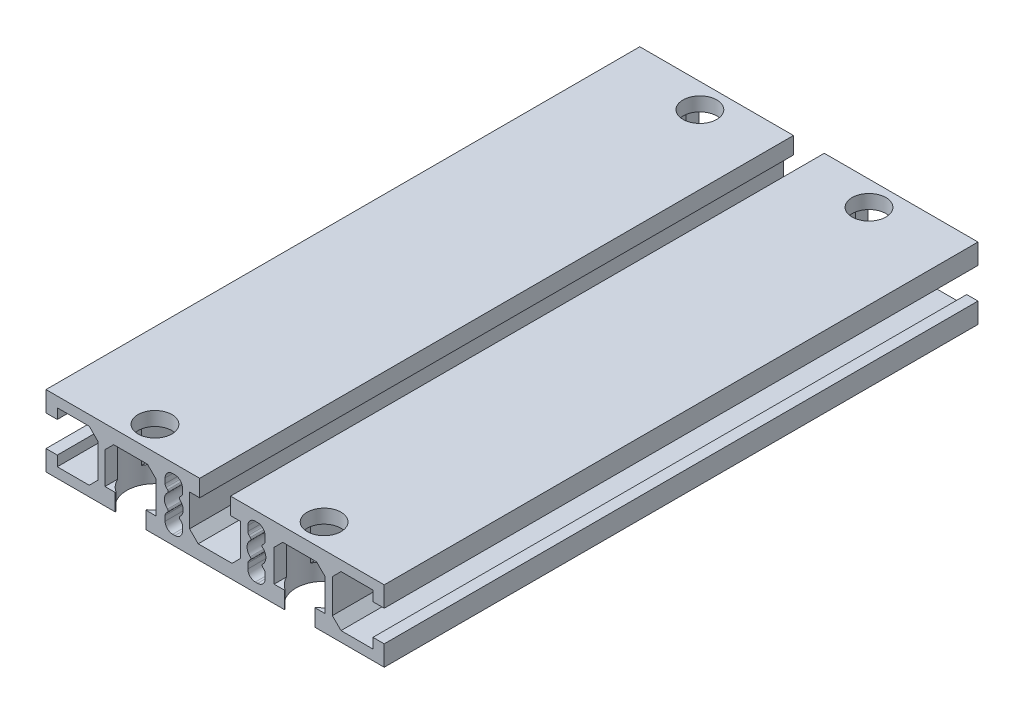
ISO-10303-21;
HEADER;
FILE_DESCRIPTION(('STEP AP214'),'2;1');
FILE_NAME('part.step','',(''),(''),'','','');
FILE_SCHEMA(('AUTOMOTIVE_DESIGN { 1 0 10303 214 1 1 1 1 }'));
ENDSEC;
DATA;
#1=APPLICATION_CONTEXT('core data for automotive mechanical design processes');
#2=APPLICATION_PROTOCOL_DEFINITION('international standard','automotive_design',2000,#1);
#3=PRODUCT_CONTEXT('',#1,'mechanical');
#4=PRODUCT('Part','Part','',(#3));
#5=PRODUCT_RELATED_PRODUCT_CATEGORY('part','',(#4));
#6=PRODUCT_DEFINITION_FORMATION('','',#4);
#7=PRODUCT_DEFINITION_CONTEXT('part definition',#1,'design');
#8=PRODUCT_DEFINITION('design','',#6,#7);
#9=PRODUCT_DEFINITION_SHAPE('','',#8);
#10=(LENGTH_UNIT() NAMED_UNIT(*) SI_UNIT(.MILLI.,.METRE.));
#11=(NAMED_UNIT(*) PLANE_ANGLE_UNIT() SI_UNIT($,.RADIAN.));
#12=(NAMED_UNIT(*) SI_UNIT($,.STERADIAN.) SOLID_ANGLE_UNIT());
#13=UNCERTAINTY_MEASURE_WITH_UNIT(LENGTH_MEASURE(1.E-05),#10,'distance_accuracy_value','');
#14=(GEOMETRIC_REPRESENTATION_CONTEXT(3) GLOBAL_UNCERTAINTY_ASSIGNED_CONTEXT((#13)) GLOBAL_UNIT_ASSIGNED_CONTEXT((#10,
#11,#12)) REPRESENTATION_CONTEXT('',''));
#15=CARTESIAN_POINT('',(0.,0.,0.));
#16=DIRECTION('',(0.,0.,1.));
#17=DIRECTION('',(1.,0.,0.));
#18=AXIS2_PLACEMENT_3D('',#15,#16,#17);
#19=CARTESIAN_POINT('',(-15.6999999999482,-5.,-79.));
#20=DIRECTION('',(0.,1.,0.));
#21=DIRECTION('',(0.,0.,1.));
#22=AXIS2_PLACEMENT_3D('',#19,#20,#21);
#23=PLANE('',#22);
#24=CARTESIAN_POINT('',(-22.5,-5.,72.5));
#25=DIRECTION('',(0.,1.,0.));
#26=DIRECTION('',(0.,0.,1.));
#27=AXIS2_PLACEMENT_3D('',#24,#25,#26);
#28=CIRCLE('',#27,7.5);
#29=CARTESIAN_POINT('',(-18.3999999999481,-5.,78.7801273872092));
#30=VERTEX_POINT('',#29);
#31=CARTESIAN_POINT('',(-15.6999999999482,-5.,75.6638584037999));
#32=VERTEX_POINT('',#31);
#33=EDGE_CURVE('E3160',#30,#32,#28,.T.);
#34=ORIENTED_EDGE('',*,*,#33,.F.);
#35=DIRECTION('',(0.,0.,1.));
#36=VECTOR('',#35,1.);
#37=CARTESIAN_POINT('',(-18.3999999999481,-5.,-79.));
#38=LINE('',#37,#36);
#39=CARTESIAN_POINT('',(-18.3999999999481,-5.,79.));
#40=VERTEX_POINT('',#39);
#41=EDGE_CURVE('E2042',#30,#40,#38,.T.);
#42=ORIENTED_EDGE('',*,*,#41,.T.);
#43=DIRECTION('',(-1.,0.,0.));
#44=VECTOR('',#43,1.);
#45=CARTESIAN_POINT('',(-15.6999999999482,-5.,79.));
#46=LINE('',#45,#44);
#47=CARTESIAN_POINT('',(-15.6999999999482,-5.,79.));
#48=VERTEX_POINT('',#47);
#49=EDGE_CURVE('E2077',#48,#40,#46,.T.);
#50=ORIENTED_EDGE('',*,*,#49,.F.);
#51=DIRECTION('',(0.,0.,1.));
#52=VECTOR('',#51,1.);
#53=CARTESIAN_POINT('',(-15.6999999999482,-5.,-79.));
#54=LINE('',#53,#52);
#55=EDGE_CURVE('E2046',#32,#48,#54,.T.);
#56=ORIENTED_EDGE('',*,*,#55,.F.);
#57=EDGE_LOOP('',(#34,#42,#50,#56));
#58=FACE_BOUND('',#57,.T.);
#59=ADVANCED_FACE('F969',(#58),#23,.T.);
#60=CARTESIAN_POINT('',(-17.9999999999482,5.8,-79.));
#61=DIRECTION('',(-0.707106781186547,-0.707106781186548,0.));
#62=DIRECTION('',(0.707106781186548,-0.707106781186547,0.));
#63=AXIS2_PLACEMENT_3D('',#60,#61,#62);
#64=PLANE('',#63);
#65=CARTESIAN_POINT('',(-22.5,10.3000000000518,72.5));
#66=DIRECTION('',(-0.707106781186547,-0.707106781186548,0.));
#67=DIRECTION('',(0.707106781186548,-0.707106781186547,0.));
#68=AXIS2_PLACEMENT_3D('',#65,#66,#67);
#69=ELLIPSE('',#68,10.6066017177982,7.5);
#70=CARTESIAN_POINT('',(-15.6999999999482,3.5,75.6638584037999));
#71=VERTEX_POINT('',#70);
#72=CARTESIAN_POINT('',(-17.9999999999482,5.79999999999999,78.4999999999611));
#73=VERTEX_POINT('',#72);
#74=EDGE_CURVE('E1845',#71,#73,#69,.T.);
#75=ORIENTED_EDGE('',*,*,#74,.F.);
#76=DIRECTION('',(0.,0.,1.));
#77=VECTOR('',#76,1.);
#78=CARTESIAN_POINT('',(-15.6999999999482,3.5,-79.));
#79=LINE('',#78,#77);
#80=CARTESIAN_POINT('',(-15.6999999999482,3.5,79.));
#81=VERTEX_POINT('',#80);
#82=EDGE_CURVE('E1872',#71,#81,#79,.T.);
#83=ORIENTED_EDGE('',*,*,#82,.T.);
#84=DIRECTION('',(0.707106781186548,-0.707106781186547,0.));
#85=VECTOR('',#84,1.);
#86=CARTESIAN_POINT('',(-17.9999999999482,5.8,79.));
#87=LINE('',#86,#85);
#88=CARTESIAN_POINT('',(-17.9999999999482,5.8,79.));
#89=VERTEX_POINT('',#88);
#90=EDGE_CURVE('E2065',#89,#81,#87,.T.);
#91=ORIENTED_EDGE('',*,*,#90,.F.);
#92=DIRECTION('',(0.,0.,1.));
#93=VECTOR('',#92,1.);
#94=CARTESIAN_POINT('',(-17.9999999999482,5.8,-79.));
#95=LINE('',#94,#93);
#96=EDGE_CURVE('E1870',#73,#89,#95,.T.);
#97=ORIENTED_EDGE('',*,*,#96,.F.);
#98=EDGE_LOOP('',(#75,#83,#91,#97));
#99=FACE_BOUND('',#98,.T.);
#100=ADVANCED_FACE('F2064',(#99),#64,.T.);
#101=CARTESIAN_POINT('',(-29.2999999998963,-5.00000000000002,-79.));
#102=DIRECTION('',(1.,0.,0.));
#103=DIRECTION('',(0.,0.,-1.));
#104=AXIS2_PLACEMENT_3D('',#101,#102,#103);
#105=PLANE('',#104);
#106=DIRECTION('',(0.,-1.,0.));
#107=VECTOR('',#106,1.);
#108=CARTESIAN_POINT('',(-29.2999999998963,-9.50000000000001,75.663858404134));
#109=LINE('',#108,#107);
#110=CARTESIAN_POINT('',(-29.2999999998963,3.50000000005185,75.663858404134));
#111=VERTEX_POINT('',#110);
#112=CARTESIAN_POINT('',(-29.2999999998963,-5.00000000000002,75.663858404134));
#113=VERTEX_POINT('',#112);
#114=EDGE_CURVE('E3142',#111,#113,#109,.T.);
#115=ORIENTED_EDGE('',*,*,#114,.F.);
#116=DIRECTION('',(0.,0.,1.));
#117=VECTOR('',#116,1.);
#118=CARTESIAN_POINT('',(-29.2999999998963,3.50000000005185,-79.));
#119=LINE('',#118,#117);
#120=CARTESIAN_POINT('',(-29.2999999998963,3.50000000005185,79.));
#121=VERTEX_POINT('',#120);
#122=EDGE_CURVE('E1886',#111,#121,#119,.T.);
#123=ORIENTED_EDGE('',*,*,#122,.T.);
#124=DIRECTION('',(0.,1.,0.));
#125=VECTOR('',#124,1.);
#126=CARTESIAN_POINT('',(-29.2999999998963,-5.00000000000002,79.));
#127=LINE('',#126,#125);
#128=CARTESIAN_POINT('',(-29.2999999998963,-5.00000000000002,79.));
#129=VERTEX_POINT('',#128);
#130=EDGE_CURVE('E2973',#129,#121,#127,.T.);
#131=ORIENTED_EDGE('',*,*,#130,.F.);
#132=DIRECTION('',(0.,0.,1.));
#133=VECTOR('',#132,1.);
#134=CARTESIAN_POINT('',(-29.2999999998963,-5.00000000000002,-79.));
#135=LINE('',#134,#133);
#136=EDGE_CURVE('E1891',#113,#129,#135,.T.);
#137=ORIENTED_EDGE('',*,*,#136,.F.);
#138=EDGE_LOOP('',(#115,#123,#131,#137));
#139=FACE_BOUND('',#138,.T.);
#140=ADVANCED_FACE('F3093',(#139),#105,.T.);
#141=CARTESIAN_POINT('',(-26.6,-5.00000000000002,-79.));
#142=DIRECTION('',(0.,1.,0.));
#143=DIRECTION('',(-1.,0.,0.));
#144=AXIS2_PLACEMENT_3D('',#141,#142,#143);
#145=PLANE('',#144);
#146=CARTESIAN_POINT('',(-22.5,-5.00000000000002,72.5));
#147=DIRECTION('',(0.,1.,0.));
#148=DIRECTION('',(-1.,0.,0.));
#149=AXIS2_PLACEMENT_3D('',#146,#147,#148);
#150=CIRCLE('',#149,7.5);
#151=CARTESIAN_POINT('',(-26.6,-5.00000000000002,78.780127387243));
#152=VERTEX_POINT('',#151);
#153=EDGE_CURVE('E3144',#113,#152,#150,.T.);
#154=ORIENTED_EDGE('',*,*,#153,.F.);
#155=ORIENTED_EDGE('',*,*,#136,.T.);
#156=DIRECTION('',(-1.,0.,0.));
#157=VECTOR('',#156,1.);
#158=CARTESIAN_POINT('',(-26.6,-5.00000000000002,79.));
#159=LINE('',#158,#157);
#160=CARTESIAN_POINT('',(-26.6,-5.00000000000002,79.));
#161=VERTEX_POINT('',#160);
#162=EDGE_CURVE('E2970',#161,#129,#159,.T.);
#163=ORIENTED_EDGE('',*,*,#162,.F.);
#164=DIRECTION('',(0.,0.,1.));
#165=VECTOR('',#164,1.);
#166=CARTESIAN_POINT('',(-26.6,-5.00000000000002,-79.));
#167=LINE('',#166,#165);
#168=EDGE_CURVE('E1896',#152,#161,#167,.T.);
#169=ORIENTED_EDGE('',*,*,#168,.F.);
#170=EDGE_LOOP('',(#154,#155,#163,#169));
#171=FACE_BOUND('',#170,.T.);
#172=ADVANCED_FACE('F3194',(#171),#145,.T.);
#173=CARTESIAN_POINT('',(-26.6,-9.50000000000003,-79.));
#174=DIRECTION('',(1.,0.,0.));
#175=DIRECTION('',(0.,0.,-1.));
#176=AXIS2_PLACEMENT_3D('',#173,#174,#175);
#177=PLANE('',#176);
#178=DIRECTION('',(0.,-1.,0.));
#179=VECTOR('',#178,1.);
#180=CARTESIAN_POINT('',(-26.6,-9.50000000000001,78.780127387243));
#181=LINE('',#180,#179);
#182=CARTESIAN_POINT('',(-26.6,-9.50000000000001,78.780127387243));
#183=VERTEX_POINT('',#182);
#184=EDGE_CURVE('E3149',#152,#183,#181,.T.);
#185=ORIENTED_EDGE('',*,*,#184,.F.);
#186=ORIENTED_EDGE('',*,*,#168,.T.);
#187=DIRECTION('',(0.,1.,0.));
#188=VECTOR('',#187,1.);
#189=CARTESIAN_POINT('',(-26.6,-9.50000000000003,79.));
#190=LINE('',#189,#188);
#191=CARTESIAN_POINT('',(-26.6,-9.50000000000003,79.));
#192=VERTEX_POINT('',#191);
#193=EDGE_CURVE('E2967',#192,#161,#190,.T.);
#194=ORIENTED_EDGE('',*,*,#193,.F.);
#195=DIRECTION('',(0.,0.,1.));
#196=VECTOR('',#195,1.);
#197=CARTESIAN_POINT('',(-26.6,-9.50000000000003,-79.));
#198=LINE('',#197,#196);
#199=EDGE_CURVE('E1901',#183,#192,#198,.T.);
#200=ORIENTED_EDGE('',*,*,#199,.F.);
#201=EDGE_LOOP('',(#185,#186,#194,#200));
#202=FACE_BOUND('',#201,.T.);
#203=ADVANCED_FACE('F3117',(#202),#177,.T.);
#204=CARTESIAN_POINT('',(-18.3999999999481,-5.,-79.));
#205=DIRECTION('',(-1.,0.,0.));
#206=DIRECTION('',(0.,0.,1.));
#207=AXIS2_PLACEMENT_3D('',#204,#205,#206);
#208=PLANE('',#207);
#209=DIRECTION('',(0.,-1.,0.));
#210=VECTOR('',#209,1.);
#211=CARTESIAN_POINT('',(-18.3999999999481,-9.50000000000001,66.2198726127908));
#212=LINE('',#211,#210);
#213=CARTESIAN_POINT('',(-18.3999999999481,-5.,66.2198726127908));
#214=VERTEX_POINT('',#213);
#215=CARTESIAN_POINT('',(-18.3999999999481,-9.50000000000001,66.2198726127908));
#216=VERTEX_POINT('',#215);
#217=EDGE_CURVE('E3165',#214,#216,#212,.T.);
#218=ORIENTED_EDGE('',*,*,#217,.F.);
#219=CARTESIAN_POINT('',(-18.3999999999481,-5.,-66.2198726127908));
#220=VERTEX_POINT('',#219);
#221=EDGE_CURVE('E2041',#220,#214,#38,.T.);
#222=ORIENTED_EDGE('',*,*,#221,.F.);
#223=DIRECTION('',(0.,-1.,0.));
#224=VECTOR('',#223,1.);
#225=CARTESIAN_POINT('',(-18.3999999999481,-9.50000000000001,-66.2198726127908));
#226=LINE('',#225,#224);
#227=CARTESIAN_POINT('',(-18.3999999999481,-9.50000000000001,-66.2198726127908));
#228=VERTEX_POINT('',#227);
#229=EDGE_CURVE('E2694',#228,#220,#226,.F.);
#230=ORIENTED_EDGE('',*,*,#229,.F.);
#231=DIRECTION('',(0.,0.,1.));
#232=VECTOR('',#231,1.);
#233=CARTESIAN_POINT('',(-18.3999999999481,-9.50000000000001,-79.));
#234=LINE('',#233,#232);
#235=EDGE_CURVE('E2037',#228,#216,#234,.T.);
#236=ORIENTED_EDGE('',*,*,#235,.T.);
#237=EDGE_LOOP('',(#218,#222,#230,#236));
#238=FACE_BOUND('',#237,.T.);
#239=ADVANCED_FACE('F3110',(#238),#208,.T.);
#240=CARTESIAN_POINT('',(-15.6999999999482,3.5,-79.));
#241=DIRECTION('',(-1.,0.,0.));
#242=DIRECTION('',(0.,0.,1.));
#243=AXIS2_PLACEMENT_3D('',#240,#241,#242);
#244=PLANE('',#243);
#245=DIRECTION('',(0.,-1.,0.));
#246=VECTOR('',#245,1.);
#247=CARTESIAN_POINT('',(-15.6999999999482,-9.50000000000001,69.3361415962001));
#248=LINE('',#247,#246);
#249=CARTESIAN_POINT('',(-15.6999999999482,3.5,69.3361415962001));
#250=VERTEX_POINT('',#249);
#251=CARTESIAN_POINT('',(-15.6999999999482,-5.,69.3361415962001));
#252=VERTEX_POINT('',#251);
#253=EDGE_CURVE('E1862',#250,#252,#248,.T.);
#254=ORIENTED_EDGE('',*,*,#253,.F.);
#255=CARTESIAN_POINT('',(-15.6999999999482,3.5,-69.3361415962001));
#256=VERTEX_POINT('',#255);
#257=EDGE_CURVE('E1860',#256,#250,#79,.T.);
#258=ORIENTED_EDGE('',*,*,#257,.F.);
#259=DIRECTION('',(0.,-1.,0.));
#260=VECTOR('',#259,1.);
#261=CARTESIAN_POINT('',(-15.6999999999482,-9.50000000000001,-69.3361415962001));
#262=LINE('',#261,#260);
#263=CARTESIAN_POINT('',(-15.6999999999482,-5.,-69.3361415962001));
#264=VERTEX_POINT('',#263);
#265=EDGE_CURVE('E2695',#264,#256,#262,.F.);
#266=ORIENTED_EDGE('',*,*,#265,.F.);
#267=EDGE_CURVE('E2045',#264,#252,#54,.T.);
#268=ORIENTED_EDGE('',*,*,#267,.T.);
#269=EDGE_LOOP('',(#254,#258,#266,#268));
#270=FACE_BOUND('',#269,.T.);
#271=ADVANCED_FACE('F3108',(#270),#244,.T.);
#272=CARTESIAN_POINT('',(-29.2999999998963,3.50000000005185,-79.));
#273=DIRECTION('',(0.707106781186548,-0.707106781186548,0.));
#274=DIRECTION('',(0.707106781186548,0.707106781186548,0.));
#275=AXIS2_PLACEMENT_3D('',#272,#273,#274);
#276=PLANE('',#275);
#277=CARTESIAN_POINT('',(-22.5,10.2999999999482,72.5));
#278=DIRECTION('',(0.707106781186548,-0.707106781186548,0.));
#279=DIRECTION('',(-0.707106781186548,-0.707106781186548,0.));
#280=AXIS2_PLACEMENT_3D('',#277,#278,#279);
#281=ELLIPSE('',#280,10.6066017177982,7.5);
#282=CARTESIAN_POINT('',(-29.2999999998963,3.50000000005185,69.3361415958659));
#283=VERTEX_POINT('',#282);
#284=CARTESIAN_POINT('',(-26.9999999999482,5.79999999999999,66.4999999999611));
#285=VERTEX_POINT('',#284);
#286=EDGE_CURVE('E2991',#283,#285,#281,.T.);
#287=ORIENTED_EDGE('',*,*,#286,.F.);
#288=CARTESIAN_POINT('',(-29.2999999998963,3.50000000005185,-69.336141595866));
#289=VERTEX_POINT('',#288);
#290=EDGE_CURVE('E1885',#289,#283,#119,.T.);
#291=ORIENTED_EDGE('',*,*,#290,.F.);
#292=CARTESIAN_POINT('',(-22.5,10.2999999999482,-72.5));
#293=DIRECTION('',(0.707106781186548,-0.707106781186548,0.));
#294=DIRECTION('',(-0.707106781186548,-0.707106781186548,0.));
#295=AXIS2_PLACEMENT_3D('',#292,#293,#294);
#296=ELLIPSE('',#295,10.6066017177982,7.5);
#297=CARTESIAN_POINT('',(-26.9999999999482,5.79999999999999,-66.4999999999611));
#298=VERTEX_POINT('',#297);
#299=EDGE_CURVE('E2993',#298,#289,#296,.T.);
#300=ORIENTED_EDGE('',*,*,#299,.F.);
#301=DIRECTION('',(0.,0.,1.));
#302=VECTOR('',#301,1.);
#303=CARTESIAN_POINT('',(-26.9999999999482,5.8,-79.));
#304=LINE('',#303,#302);
#305=EDGE_CURVE('E1880',#298,#285,#304,.T.);
#306=ORIENTED_EDGE('',*,*,#305,.T.);
#307=EDGE_LOOP('',(#287,#291,#300,#306));
#308=FACE_BOUND('',#307,.T.);
#309=ADVANCED_FACE('F2989',(#308),#276,.T.);
#310=DIRECTION('',(0.,-1.,0.));
#311=VECTOR('',#310,1.);
#312=CARTESIAN_POINT('',(-18.3999999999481,-9.50000000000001,-78.7801273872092));
#313=LINE('',#312,#311);
#314=CARTESIAN_POINT('',(-18.3999999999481,-5.,-78.7801273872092));
#315=VERTEX_POINT('',#314);
#316=CARTESIAN_POINT('',(-18.3999999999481,-9.50000000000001,-78.7801273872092));
#317=VERTEX_POINT('',#316);
#318=EDGE_CURVE('E2679',#315,#317,#313,.T.);
#319=ORIENTED_EDGE('',*,*,#318,.F.);
#320=CARTESIAN_POINT('',(-18.3999999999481,-5.,-79.));
#321=VERTEX_POINT('',#320);
#322=EDGE_CURVE('E2039',#321,#315,#38,.T.);
#323=ORIENTED_EDGE('',*,*,#322,.F.);
#324=DIRECTION('',(0.,-1.,0.));
#325=VECTOR('',#324,1.);
#326=CARTESIAN_POINT('',(-18.3999999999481,-5.,-79.));
#327=LINE('',#326,#325);
#328=CARTESIAN_POINT('',(-18.3999999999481,-9.50000000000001,-79.));
#329=VERTEX_POINT('',#328);
#330=EDGE_CURVE('E2453',#321,#329,#327,.T.);
#331=ORIENTED_EDGE('',*,*,#330,.T.);
#332=EDGE_CURVE('E2034',#329,#317,#234,.T.);
#333=ORIENTED_EDGE('',*,*,#332,.T.);
#334=EDGE_LOOP('',(#319,#323,#331,#333));
#335=FACE_BOUND('',#334,.T.);
#336=ADVANCED_FACE('F2678',(#335),#208,.T.);
#337=EDGE_CURVE('E1861',#252,#214,#28,.T.);
#338=ORIENTED_EDGE('',*,*,#337,.F.);
#339=ORIENTED_EDGE('',*,*,#267,.F.);
#340=CARTESIAN_POINT('',(-22.5,-5.,-72.5));
#341=DIRECTION('',(0.,1.,0.));
#342=DIRECTION('',(0.,0.,1.));
#343=AXIS2_PLACEMENT_3D('',#340,#341,#342);
#344=CIRCLE('',#343,7.5);
#345=EDGE_CURVE('E2689',#220,#264,#344,.T.);
#346=ORIENTED_EDGE('',*,*,#345,.F.);
#347=ORIENTED_EDGE('',*,*,#221,.T.);
#348=EDGE_LOOP('',(#338,#339,#346,#347));
#349=FACE_BOUND('',#348,.T.);
#350=ADVANCED_FACE('F3089',(#349),#23,.T.);
#351=DIRECTION('',(0.,-1.,0.));
#352=VECTOR('',#351,1.);
#353=CARTESIAN_POINT('',(-15.6999999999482,-9.50000000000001,-75.6638584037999));
#354=LINE('',#353,#352);
#355=CARTESIAN_POINT('',(-15.6999999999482,3.5,-75.6638584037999));
#356=VERTEX_POINT('',#355);
#357=CARTESIAN_POINT('',(-15.6999999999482,-5.,-75.6638584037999));
#358=VERTEX_POINT('',#357);
#359=EDGE_CURVE('E2687',#356,#358,#354,.T.);
#360=ORIENTED_EDGE('',*,*,#359,.F.);
#361=CARTESIAN_POINT('',(-15.6999999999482,3.5,-79.));
#362=VERTEX_POINT('',#361);
#363=EDGE_CURVE('E1876',#362,#356,#79,.T.);
#364=ORIENTED_EDGE('',*,*,#363,.F.);
#365=DIRECTION('',(0.,-1.,0.));
#366=VECTOR('',#365,1.);
#367=CARTESIAN_POINT('',(-15.6999999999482,3.5,-79.));
#368=LINE('',#367,#366);
#369=CARTESIAN_POINT('',(-15.6999999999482,-5.,-79.));
#370=VERTEX_POINT('',#369);
#371=EDGE_CURVE('E2448',#362,#370,#368,.T.);
#372=ORIENTED_EDGE('',*,*,#371,.T.);
#373=EDGE_CURVE('E2043',#370,#358,#54,.T.);
#374=ORIENTED_EDGE('',*,*,#373,.T.);
#375=EDGE_LOOP('',(#360,#364,#372,#374));
#376=FACE_BOUND('',#375,.T.);
#377=ADVANCED_FACE('F3100',(#376),#244,.T.);
#378=CARTESIAN_POINT('',(-17.9999999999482,5.79999999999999,66.5000000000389));
#379=VERTEX_POINT('',#378);
#380=EDGE_CURVE('E1842',#379,#250,#69,.T.);
#381=ORIENTED_EDGE('',*,*,#380,.F.);
#382=CARTESIAN_POINT('',(-17.9999999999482,5.79999999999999,-66.5000000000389));
#383=VERTEX_POINT('',#382);
#384=EDGE_CURVE('E1858',#383,#379,#95,.T.);
#385=ORIENTED_EDGE('',*,*,#384,.F.);
#386=CARTESIAN_POINT('',(-22.5,10.3000000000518,-72.5));
#387=DIRECTION('',(-0.707106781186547,-0.707106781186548,0.));
#388=DIRECTION('',(0.707106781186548,-0.707106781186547,0.));
#389=AXIS2_PLACEMENT_3D('',#386,#387,#388);
#390=ELLIPSE('',#389,10.6066017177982,7.5);
#391=EDGE_CURVE('E2690',#256,#383,#390,.T.);
#392=ORIENTED_EDGE('',*,*,#391,.F.);
#393=ORIENTED_EDGE('',*,*,#257,.T.);
#394=EDGE_LOOP('',(#381,#385,#392,#393));
#395=FACE_BOUND('',#394,.T.);
#396=ADVANCED_FACE('F1856',(#395),#64,.T.);
#397=CARTESIAN_POINT('',(-29.2999999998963,3.50000000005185,-75.663858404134));
#398=VERTEX_POINT('',#397);
#399=CARTESIAN_POINT('',(-26.9999999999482,5.79999999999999,-78.5000000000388));
#400=VERTEX_POINT('',#399);
#401=EDGE_CURVE('E3001',#398,#400,#296,.T.);
#402=ORIENTED_EDGE('',*,*,#401,.F.);
#403=CARTESIAN_POINT('',(-29.2999999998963,3.50000000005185,-79.));
#404=VERTEX_POINT('',#403);
#405=EDGE_CURVE('E1882',#404,#398,#119,.T.);
#406=ORIENTED_EDGE('',*,*,#405,.F.);
#407=DIRECTION('',(0.707106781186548,0.707106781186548,0.));
#408=VECTOR('',#407,1.);
#409=CARTESIAN_POINT('',(-29.2999999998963,3.50000000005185,-79.));
#410=LINE('',#409,#408);
#411=CARTESIAN_POINT('',(-26.9999999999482,5.8,-79.));
#412=VERTEX_POINT('',#411);
#413=EDGE_CURVE('E2441',#404,#412,#410,.T.);
#414=ORIENTED_EDGE('',*,*,#413,.T.);
#415=EDGE_CURVE('E1873',#412,#400,#304,.T.);
#416=ORIENTED_EDGE('',*,*,#415,.T.);
#417=EDGE_LOOP('',(#402,#406,#414,#416));
#418=FACE_BOUND('',#417,.T.);
#419=ADVANCED_FACE('F3000',(#418),#276,.T.);
#420=DIRECTION('',(0.,-1.,0.));
#421=VECTOR('',#420,1.);
#422=CARTESIAN_POINT('',(-29.2999999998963,-9.50000000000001,69.336141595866));
#423=LINE('',#422,#421);
#424=CARTESIAN_POINT('',(-29.2999999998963,-5.00000000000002,69.336141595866));
#425=VERTEX_POINT('',#424);
#426=EDGE_CURVE('E3148',#425,#283,#423,.F.);
#427=ORIENTED_EDGE('',*,*,#426,.F.);
#428=CARTESIAN_POINT('',(-29.2999999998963,-5.00000000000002,-69.336141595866));
#429=VERTEX_POINT('',#428);
#430=EDGE_CURVE('E1890',#429,#425,#135,.T.);
#431=ORIENTED_EDGE('',*,*,#430,.F.);
#432=DIRECTION('',(0.,-1.,0.));
#433=VECTOR('',#432,1.);
#434=CARTESIAN_POINT('',(-29.2999999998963,-9.50000000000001,-69.336141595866));
#435=LINE('',#434,#433);
#436=EDGE_CURVE('E3180',#289,#429,#435,.T.);
#437=ORIENTED_EDGE('',*,*,#436,.F.);
#438=ORIENTED_EDGE('',*,*,#290,.T.);
#439=EDGE_LOOP('',(#427,#431,#437,#438));
#440=FACE_BOUND('',#439,.T.);
#441=ADVANCED_FACE('F3132',(#440),#105,.T.);
#442=CARTESIAN_POINT('',(-26.6,-5.00000000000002,66.219872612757));
#443=VERTEX_POINT('',#442);
#444=EDGE_CURVE('E3150',#443,#425,#150,.T.);
#445=ORIENTED_EDGE('',*,*,#444,.F.);
#446=CARTESIAN_POINT('',(-26.6,-5.00000000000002,-66.219872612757));
#447=VERTEX_POINT('',#446);
#448=EDGE_CURVE('E1895',#447,#443,#167,.T.);
#449=ORIENTED_EDGE('',*,*,#448,.F.);
#450=CARTESIAN_POINT('',(-22.5,-5.00000000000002,-72.5));
#451=DIRECTION('',(0.,1.,0.));
#452=DIRECTION('',(-1.,0.,0.));
#453=AXIS2_PLACEMENT_3D('',#450,#451,#452);
#454=CIRCLE('',#453,7.5);
#455=EDGE_CURVE('E3176',#429,#447,#454,.T.);
#456=ORIENTED_EDGE('',*,*,#455,.F.);
#457=ORIENTED_EDGE('',*,*,#430,.T.);
#458=EDGE_LOOP('',(#445,#449,#456,#457));
#459=FACE_BOUND('',#458,.T.);
#460=ADVANCED_FACE('F3205',(#459),#145,.T.);
#461=DIRECTION('',(0.,-1.,0.));
#462=VECTOR('',#461,1.);
#463=CARTESIAN_POINT('',(-26.6,-9.50000000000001,66.219872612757));
#464=LINE('',#463,#462);
#465=CARTESIAN_POINT('',(-26.6,-9.50000000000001,66.219872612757));
#466=VERTEX_POINT('',#465);
#467=EDGE_CURVE('E3156',#466,#443,#464,.F.);
#468=ORIENTED_EDGE('',*,*,#467,.F.);
#469=CARTESIAN_POINT('',(-26.6,-9.50000000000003,-66.219872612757));
#470=VERTEX_POINT('',#469);
#471=EDGE_CURVE('E1900',#470,#466,#198,.T.);
#472=ORIENTED_EDGE('',*,*,#471,.F.);
#473=DIRECTION('',(0.,-1.,0.));
#474=VECTOR('',#473,1.);
#475=CARTESIAN_POINT('',(-26.6,-9.50000000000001,-66.219872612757));
#476=LINE('',#475,#474);
#477=EDGE_CURVE('E985',#447,#470,#476,.T.);
#478=ORIENTED_EDGE('',*,*,#477,.F.);
#479=ORIENTED_EDGE('',*,*,#448,.T.);
#480=EDGE_LOOP('',(#468,#472,#478,#479));
#481=FACE_BOUND('',#480,.T.);
#482=ADVANCED_FACE('F3202',(#481),#177,.T.);
#483=CARTESIAN_POINT('',(26.6000000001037,-4.99999999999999,-79.));
#484=DIRECTION('',(-1.,0.,0.));
#485=DIRECTION('',(0.,0.,1.));
#486=AXIS2_PLACEMENT_3D('',#483,#484,#485);
#487=PLANE('',#486);
#488=DIRECTION('',(0.,-1.,0.));
#489=VECTOR('',#488,1.);
#490=CARTESIAN_POINT('',(26.6000000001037,-9.50000000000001,-78.780127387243));
#491=LINE('',#490,#489);
#492=CARTESIAN_POINT('',(26.6000000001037,-4.99999999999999,-78.780127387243));
#493=VERTEX_POINT('',#492);
#494=CARTESIAN_POINT('',(26.6000000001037,-9.50000000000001,-78.780127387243));
#495=VERTEX_POINT('',#494);
#496=EDGE_CURVE('E2629',#493,#495,#491,.T.);
#497=ORIENTED_EDGE('',*,*,#496,.F.);
#498=DIRECTION('',(0.,0.,1.));
#499=VECTOR('',#498,1.);
#500=CARTESIAN_POINT('',(26.6000000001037,-4.99999999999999,-79.));
#501=LINE('',#500,#499);
#502=CARTESIAN_POINT('',(26.6000000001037,-4.99999999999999,-79.));
#503=VERTEX_POINT('',#502);
#504=EDGE_CURVE('E1989',#503,#493,#501,.T.);
#505=ORIENTED_EDGE('',*,*,#504,.F.);
#506=DIRECTION('',(0.,-1.,0.));
#507=VECTOR('',#506,1.);
#508=CARTESIAN_POINT('',(26.6000000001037,-4.99999999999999,-79.));
#509=LINE('',#508,#507);
#510=CARTESIAN_POINT('',(26.6000000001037,-9.49999999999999,-79.));
#511=VERTEX_POINT('',#510);
#512=EDGE_CURVE('E2482',#503,#511,#509,.T.);
#513=ORIENTED_EDGE('',*,*,#512,.T.);
#514=DIRECTION('',(0.,0.,1.));
#515=VECTOR('',#514,1.);
#516=CARTESIAN_POINT('',(26.6000000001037,-9.49999999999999,-79.));
#517=LINE('',#516,#515);
#518=EDGE_CURVE('E1984',#511,#495,#517,.T.);
#519=ORIENTED_EDGE('',*,*,#518,.T.);
#520=EDGE_LOOP('',(#497,#505,#513,#519));
#521=FACE_BOUND('',#520,.T.);
#522=ADVANCED_FACE('F2628',(#521),#487,.T.);
#523=CARTESIAN_POINT('',(29.3000000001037,3.50000000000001,-79.));
#524=DIRECTION('',(-1.,0.,0.));
#525=DIRECTION('',(0.,0.,1.));
#526=AXIS2_PLACEMENT_3D('',#523,#524,#525);
#527=PLANE('',#526);
#528=DIRECTION('',(0.,-1.,0.));
#529=VECTOR('',#528,1.);
#530=CARTESIAN_POINT('',(29.3000000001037,-9.50000000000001,-75.6638584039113));
#531=LINE('',#530,#529);
#532=CARTESIAN_POINT('',(29.3000000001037,3.50000000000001,-75.6638584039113));
#533=VERTEX_POINT('',#532);
#534=CARTESIAN_POINT('',(29.3000000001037,-4.99999999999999,-75.6638584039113));
#535=VERTEX_POINT('',#534);
#536=EDGE_CURVE('E2639',#533,#535,#531,.T.);
#537=ORIENTED_EDGE('',*,*,#536,.F.);
#538=DIRECTION('',(0.,0.,1.));
#539=VECTOR('',#538,1.);
#540=CARTESIAN_POINT('',(29.3000000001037,3.50000000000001,-79.));
#541=LINE('',#540,#539);
#542=CARTESIAN_POINT('',(29.3000000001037,3.50000000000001,-79.));
#543=VERTEX_POINT('',#542);
#544=EDGE_CURVE('E1999',#543,#533,#541,.T.);
#545=ORIENTED_EDGE('',*,*,#544,.F.);
#546=DIRECTION('',(0.,-1.,0.));
#547=VECTOR('',#546,1.);
#548=CARTESIAN_POINT('',(29.3000000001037,3.50000000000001,-79.));
#549=LINE('',#548,#547);
#550=CARTESIAN_POINT('',(29.3000000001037,-4.99999999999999,-79.));
#551=VERTEX_POINT('',#550);
#552=EDGE_CURVE('E2476',#543,#551,#549,.T.);
#553=ORIENTED_EDGE('',*,*,#552,.T.);
#554=DIRECTION('',(0.,0.,1.));
#555=VECTOR('',#554,1.);
#556=CARTESIAN_POINT('',(29.3000000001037,-4.99999999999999,-79.));
#557=LINE('',#556,#555);
#558=EDGE_CURVE('E1994',#551,#535,#557,.T.);
#559=ORIENTED_EDGE('',*,*,#558,.T.);
#560=EDGE_LOOP('',(#537,#545,#553,#559));
#561=FACE_BOUND('',#560,.T.);
#562=ADVANCED_FACE('F2638',(#561),#527,.T.);
#563=CARTESIAN_POINT('',(15.7000000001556,3.50000000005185,-79.));
#564=DIRECTION('',(0.707106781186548,-0.707106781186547,0.));
#565=DIRECTION('',(0.707106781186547,0.707106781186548,0.));
#566=AXIS2_PLACEMENT_3D('',#563,#564,#565);
#567=PLANE('',#566);
#568=CARTESIAN_POINT('',(22.5000000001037,10.3,-72.5));
#569=DIRECTION('',(0.707106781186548,-0.707106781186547,0.));
#570=DIRECTION('',(-0.707106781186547,-0.707106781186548,0.));
#571=AXIS2_PLACEMENT_3D('',#568,#569,#570);
#572=ELLIPSE('',#571,10.6066017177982,7.49999999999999);
#573=CARTESIAN_POINT('',(15.7000000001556,3.50000000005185,-75.6638584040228));
#574=VERTEX_POINT('',#573);
#575=CARTESIAN_POINT('',(18.0000000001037,5.79999999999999,-78.5));
#576=VERTEX_POINT('',#575);
#577=EDGE_CURVE('E2652',#574,#576,#572,.T.);
#578=ORIENTED_EDGE('',*,*,#577,.F.);
#579=DIRECTION('',(0.,0.,1.));
#580=VECTOR('',#579,1.);
#581=CARTESIAN_POINT('',(15.7000000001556,3.50000000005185,-79.));
#582=LINE('',#581,#580);
#583=CARTESIAN_POINT('',(15.7000000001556,3.50000000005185,-79.));
#584=VERTEX_POINT('',#583);
#585=EDGE_CURVE('E2014',#584,#574,#582,.T.);
#586=ORIENTED_EDGE('',*,*,#585,.F.);
#587=DIRECTION('',(0.707106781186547,0.707106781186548,0.));
#588=VECTOR('',#587,1.);
#589=CARTESIAN_POINT('',(15.7000000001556,3.50000000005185,-79.));
#590=LINE('',#589,#588);
#591=CARTESIAN_POINT('',(18.0000000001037,5.79999999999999,-79.));
#592=VERTEX_POINT('',#591);
#593=EDGE_CURVE('E2468',#584,#592,#590,.T.);
#594=ORIENTED_EDGE('',*,*,#593,.T.);
#595=DIRECTION('',(0.,0.,1.));
#596=VECTOR('',#595,1.);
#597=CARTESIAN_POINT('',(18.0000000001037,5.79999999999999,-79.));
#598=LINE('',#597,#596);
#599=EDGE_CURVE('E2009',#592,#576,#598,.T.);
#600=ORIENTED_EDGE('',*,*,#599,.T.);
#601=EDGE_LOOP('',(#578,#586,#594,#600));
#602=FACE_BOUND('',#601,.T.);
#603=ADVANCED_FACE('F2651',(#602),#567,.T.);
#604=CARTESIAN_POINT('',(18.4000000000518,-5.,-79.));
#605=DIRECTION('',(0.,1.,0.));
#606=DIRECTION('',(0.,0.,1.));
#607=AXIS2_PLACEMENT_3D('',#604,#605,#606);
#608=PLANE('',#607);
#609=CARTESIAN_POINT('',(22.5000000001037,-5.,-72.5));
#610=DIRECTION('',(0.,1.,0.));
#611=DIRECTION('',(0.,0.,1.));
#612=AXIS2_PLACEMENT_3D('',#609,#610,#611);
#613=CIRCLE('',#612,7.49999999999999);
#614=CARTESIAN_POINT('',(18.4000000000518,-5.,-78.7801273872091));
#615=VERTEX_POINT('',#614);
#616=CARTESIAN_POINT('',(15.7000000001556,-5.,-75.6638584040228));
#617=VERTEX_POINT('',#616);
#618=EDGE_CURVE('E2662',#615,#617,#613,.T.);
#619=ORIENTED_EDGE('',*,*,#618,.F.);
#620=DIRECTION('',(0.,0.,1.));
#621=VECTOR('',#620,1.);
#622=CARTESIAN_POINT('',(18.4000000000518,-5.,-79.));
#623=LINE('',#622,#621);
#624=CARTESIAN_POINT('',(18.4000000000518,-5.,-79.));
#625=VERTEX_POINT('',#624);
#626=EDGE_CURVE('E2024',#625,#615,#623,.T.);
#627=ORIENTED_EDGE('',*,*,#626,.F.);
#628=DIRECTION('',(-1.,0.,0.));
#629=VECTOR('',#628,1.);
#630=CARTESIAN_POINT('',(18.4000000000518,-5.,-79.));
#631=LINE('',#630,#629);
#632=CARTESIAN_POINT('',(15.7000000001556,-5.,-79.));
#633=VERTEX_POINT('',#632);
#634=EDGE_CURVE('E2462',#625,#633,#631,.T.);
#635=ORIENTED_EDGE('',*,*,#634,.T.);
#636=DIRECTION('',(0.,0.,1.));
#637=VECTOR('',#636,1.);
#638=CARTESIAN_POINT('',(15.7000000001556,-5.,-79.));
#639=LINE('',#638,#637);
#640=EDGE_CURVE('E2019',#633,#617,#639,.T.);
#641=ORIENTED_EDGE('',*,*,#640,.T.);
#642=EDGE_LOOP('',(#619,#627,#635,#641));
#643=FACE_BOUND('',#642,.T.);
#644=ADVANCED_FACE('F2661',(#643),#608,.T.);
#645=CARTESIAN_POINT('',(29.3000000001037,-4.99999999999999,-79.));
#646=DIRECTION('',(0.,1.,0.));
#647=DIRECTION('',(0.,0.,1.));
#648=AXIS2_PLACEMENT_3D('',#645,#646,#647);
#649=PLANE('',#648);
#650=CARTESIAN_POINT('',(22.5000000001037,-4.99999999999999,-72.5));
#651=DIRECTION('',(0.,1.,0.));
#652=DIRECTION('',(0.,0.,1.));
#653=AXIS2_PLACEMENT_3D('',#650,#651,#652);
#654=CIRCLE('',#653,7.49999999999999);
#655=CARTESIAN_POINT('',(26.6000000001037,-4.99999999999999,-66.219872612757));
#656=VERTEX_POINT('',#655);
#657=CARTESIAN_POINT('',(29.3000000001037,-4.99999999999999,-69.3361415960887));
#658=VERTEX_POINT('',#657);
#659=EDGE_CURVE('E2728',#656,#658,#654,.T.);
#660=ORIENTED_EDGE('',*,*,#659,.F.);
#661=CARTESIAN_POINT('',(26.6000000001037,-4.99999999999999,66.219872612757));
#662=VERTEX_POINT('',#661);
#663=EDGE_CURVE('E1992',#656,#662,#501,.T.);
#664=ORIENTED_EDGE('',*,*,#663,.T.);
#665=CARTESIAN_POINT('',(22.5000000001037,-4.99999999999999,72.5));
#666=DIRECTION('',(0.,1.,0.));
#667=DIRECTION('',(0.,0.,1.));
#668=AXIS2_PLACEMENT_3D('',#665,#666,#667);
#669=CIRCLE('',#668,7.49999999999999);
#670=CARTESIAN_POINT('',(29.3000000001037,-4.99999999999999,69.3361415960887));
#671=VERTEX_POINT('',#670);
#672=EDGE_CURVE('E2771',#671,#662,#669,.T.);
#673=ORIENTED_EDGE('',*,*,#672,.F.);
#674=EDGE_CURVE('E1997',#658,#671,#557,.T.);
#675=ORIENTED_EDGE('',*,*,#674,.F.);
#676=EDGE_LOOP('',(#660,#664,#673,#675));
#677=FACE_BOUND('',#676,.T.);
#678=ADVANCED_FACE('F3607',(#677),#649,.T.);
#679=CARTESIAN_POINT('',(15.7000000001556,-5.,-79.));
#680=DIRECTION('',(1.,0.,0.));
#681=DIRECTION('',(0.,0.,-1.));
#682=AXIS2_PLACEMENT_3D('',#679,#680,#681);
#683=PLANE('',#682);
#684=DIRECTION('',(0.,-1.,0.));
#685=VECTOR('',#684,1.);
#686=CARTESIAN_POINT('',(15.7000000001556,-9.50000000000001,-69.3361415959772));
#687=LINE('',#686,#685);
#688=CARTESIAN_POINT('',(15.7000000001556,3.50000000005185,-69.3361415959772));
#689=VERTEX_POINT('',#688);
#690=CARTESIAN_POINT('',(15.7000000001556,-5.,-69.3361415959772));
#691=VERTEX_POINT('',#690);
#692=EDGE_CURVE('E2722',#689,#691,#687,.T.);
#693=ORIENTED_EDGE('',*,*,#692,.F.);
#694=CARTESIAN_POINT('',(15.7000000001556,3.50000000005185,69.3361415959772));
#695=VERTEX_POINT('',#694);
#696=EDGE_CURVE('E2017',#689,#695,#582,.T.);
#697=ORIENTED_EDGE('',*,*,#696,.T.);
#698=DIRECTION('',(0.,-1.,0.));
#699=VECTOR('',#698,1.);
#700=CARTESIAN_POINT('',(15.7000000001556,-9.50000000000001,69.3361415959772));
#701=LINE('',#700,#699);
#702=CARTESIAN_POINT('',(15.7000000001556,-5.,69.3361415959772));
#703=VERTEX_POINT('',#702);
#704=EDGE_CURVE('E2753',#703,#695,#701,.F.);
#705=ORIENTED_EDGE('',*,*,#704,.F.);
#706=EDGE_CURVE('E2022',#691,#703,#639,.T.);
#707=ORIENTED_EDGE('',*,*,#706,.F.);
#708=EDGE_LOOP('',(#693,#697,#705,#707));
#709=FACE_BOUND('',#708,.T.);
#710=ADVANCED_FACE('F3542',(#709),#683,.T.);
#711=CARTESIAN_POINT('',(27.0000000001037,5.79999999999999,-79.));
#712=DIRECTION('',(-0.707106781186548,-0.707106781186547,0.));
#713=DIRECTION('',(0.707106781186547,-0.707106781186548,0.));
#714=AXIS2_PLACEMENT_3D('',#711,#712,#713);
#715=PLANE('',#714);
#716=CARTESIAN_POINT('',(22.5000000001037,10.3,-72.5));
#717=DIRECTION('',(-0.707106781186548,-0.707106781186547,0.));
#718=DIRECTION('',(0.707106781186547,-0.707106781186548,0.));
#719=AXIS2_PLACEMENT_3D('',#716,#717,#718);
#720=ELLIPSE('',#719,10.6066017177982,7.49999999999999);
#721=CARTESIAN_POINT('',(29.3000000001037,3.50000000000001,-69.3361415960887));
#722=VERTEX_POINT('',#721);
#723=CARTESIAN_POINT('',(27.0000000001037,5.79999999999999,-66.5));
#724=VERTEX_POINT('',#723);
#725=EDGE_CURVE('E2725',#722,#724,#720,.T.);
#726=ORIENTED_EDGE('',*,*,#725,.F.);
#727=CARTESIAN_POINT('',(29.3000000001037,3.50000000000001,69.3361415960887));
#728=VERTEX_POINT('',#727);
#729=EDGE_CURVE('E2002',#722,#728,#541,.T.);
#730=ORIENTED_EDGE('',*,*,#729,.T.);
#731=CARTESIAN_POINT('',(22.5000000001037,10.3,72.5));
#732=DIRECTION('',(-0.707106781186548,-0.707106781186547,0.));
#733=DIRECTION('',(0.707106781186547,-0.707106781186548,0.));
#734=AXIS2_PLACEMENT_3D('',#731,#732,#733);
#735=ELLIPSE('',#734,10.6066017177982,7.49999999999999);
#736=CARTESIAN_POINT('',(27.0000000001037,5.79999999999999,66.5));
#737=VERTEX_POINT('',#736);
#738=EDGE_CURVE('E2764',#737,#728,#735,.T.);
#739=ORIENTED_EDGE('',*,*,#738,.F.);
#740=DIRECTION('',(0.,0.,1.));
#741=VECTOR('',#740,1.);
#742=CARTESIAN_POINT('',(27.0000000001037,5.79999999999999,-79.));
#743=LINE('',#742,#741);
#744=EDGE_CURVE('E2007',#724,#737,#743,.T.);
#745=ORIENTED_EDGE('',*,*,#744,.F.);
#746=EDGE_LOOP('',(#726,#730,#739,#745));
#747=FACE_BOUND('',#746,.T.);
#748=ADVANCED_FACE('F3532',(#747),#715,.T.);
#749=CARTESIAN_POINT('',(18.4000000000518,-9.50000000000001,-79.));
#750=DIRECTION('',(1.,0.,0.));
#751=DIRECTION('',(0.,0.,-1.));
#752=AXIS2_PLACEMENT_3D('',#749,#750,#751);
#753=PLANE('',#752);
#754=DIRECTION('',(0.,-1.,0.));
#755=VECTOR('',#754,1.);
#756=CARTESIAN_POINT('',(18.4000000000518,-9.50000000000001,-66.2198726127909));
#757=LINE('',#756,#755);
#758=CARTESIAN_POINT('',(18.4000000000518,-5.,-66.2198726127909));
#759=VERTEX_POINT('',#758);
#760=CARTESIAN_POINT('',(18.4000000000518,-9.50000000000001,-66.2198726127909));
#761=VERTEX_POINT('',#760);
#762=EDGE_CURVE('E2719',#759,#761,#757,.T.);
#763=ORIENTED_EDGE('',*,*,#762,.F.);
#764=CARTESIAN_POINT('',(18.4000000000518,-5.,66.2198726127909));
#765=VERTEX_POINT('',#764);
#766=EDGE_CURVE('E2027',#759,#765,#623,.T.);
#767=ORIENTED_EDGE('',*,*,#766,.T.);
#768=DIRECTION('',(0.,-1.,0.));
#769=VECTOR('',#768,1.);
#770=CARTESIAN_POINT('',(18.4000000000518,-9.50000000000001,66.2198726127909));
#771=LINE('',#770,#769);
#772=CARTESIAN_POINT('',(18.4000000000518,-9.50000000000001,66.2198726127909));
#773=VERTEX_POINT('',#772);
#774=EDGE_CURVE('E2747',#773,#765,#771,.F.);
#775=ORIENTED_EDGE('',*,*,#774,.F.);
#776=DIRECTION('',(0.,0.,1.));
#777=VECTOR('',#776,1.);
#778=CARTESIAN_POINT('',(18.4000000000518,-9.50000000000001,-79.));
#779=LINE('',#778,#777);
#780=EDGE_CURVE('E2032',#761,#773,#779,.T.);
#781=ORIENTED_EDGE('',*,*,#780,.F.);
#782=EDGE_LOOP('',(#763,#767,#775,#781));
#783=FACE_BOUND('',#782,.T.);
#784=ADVANCED_FACE('F3459',(#783),#753,.T.);
#785=DIRECTION('',(0.,-1.,0.));
#786=VECTOR('',#785,1.);
#787=CARTESIAN_POINT('',(26.6000000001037,-9.50000000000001,-66.219872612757));
#788=LINE('',#787,#786);
#789=CARTESIAN_POINT('',(26.6000000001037,-9.50000000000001,-66.219872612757));
#790=VERTEX_POINT('',#789);
#791=EDGE_CURVE('E2732',#790,#656,#788,.F.);
#792=ORIENTED_EDGE('',*,*,#791,.F.);
#793=CARTESIAN_POINT('',(26.6000000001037,-9.50000000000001,66.219872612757));
#794=VERTEX_POINT('',#793);
#795=EDGE_CURVE('E1987',#790,#794,#517,.T.);
#796=ORIENTED_EDGE('',*,*,#795,.T.);
#797=DIRECTION('',(0.,-1.,0.));
#798=VECTOR('',#797,1.);
#799=CARTESIAN_POINT('',(26.6000000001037,-9.50000000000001,66.219872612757));
#800=LINE('',#799,#798);
#801=EDGE_CURVE('E2774',#662,#794,#800,.T.);
#802=ORIENTED_EDGE('',*,*,#801,.F.);
#803=ORIENTED_EDGE('',*,*,#663,.F.);
#804=EDGE_LOOP('',(#792,#796,#802,#803));
#805=FACE_BOUND('',#804,.T.);
#806=ADVANCED_FACE('F3531',(#805),#487,.T.);
#807=CARTESIAN_POINT('',(26.6000000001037,-4.99999999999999,78.780127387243));
#808=VERTEX_POINT('',#807);
#809=CARTESIAN_POINT('',(29.3000000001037,-4.99999999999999,75.6638584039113));
#810=VERTEX_POINT('',#809);
#811=EDGE_CURVE('E2775',#808,#810,#669,.T.);
#812=ORIENTED_EDGE('',*,*,#811,.F.);
#813=CARTESIAN_POINT('',(26.6000000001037,-4.99999999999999,79.));
#814=VERTEX_POINT('',#813);
#815=EDGE_CURVE('E1993',#808,#814,#501,.T.);
#816=ORIENTED_EDGE('',*,*,#815,.T.);
#817=DIRECTION('',(-1.,0.,0.));
#818=VECTOR('',#817,1.);
#819=CARTESIAN_POINT('',(29.3000000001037,-4.99999999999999,79.));
#820=LINE('',#819,#818);
#821=CARTESIAN_POINT('',(29.3000000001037,-4.99999999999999,79.));
#822=VERTEX_POINT('',#821);
#823=EDGE_CURVE('E2108',#822,#814,#820,.T.);
#824=ORIENTED_EDGE('',*,*,#823,.F.);
#825=EDGE_CURVE('E1998',#810,#822,#557,.T.);
#826=ORIENTED_EDGE('',*,*,#825,.F.);
#827=EDGE_LOOP('',(#812,#816,#824,#826));
#828=FACE_BOUND('',#827,.T.);
#829=ADVANCED_FACE('F3538',(#828),#649,.T.);
#830=DIRECTION('',(0.,-1.,0.));
#831=VECTOR('',#830,1.);
#832=CARTESIAN_POINT('',(29.3000000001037,-9.50000000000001,-69.3361415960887));
#833=LINE('',#832,#831);
#834=EDGE_CURVE('E2730',#658,#722,#833,.F.);
#835=ORIENTED_EDGE('',*,*,#834,.F.);
#836=ORIENTED_EDGE('',*,*,#674,.T.);
#837=DIRECTION('',(0.,-1.,0.));
#838=VECTOR('',#837,1.);
#839=CARTESIAN_POINT('',(29.3000000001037,-9.50000000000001,69.3361415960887));
#840=LINE('',#839,#838);
#841=EDGE_CURVE('E2767',#728,#671,#840,.T.);
#842=ORIENTED_EDGE('',*,*,#841,.F.);
#843=ORIENTED_EDGE('',*,*,#729,.F.);
#844=EDGE_LOOP('',(#835,#836,#842,#843));
#845=FACE_BOUND('',#844,.T.);
#846=ADVANCED_FACE('F3599',(#845),#527,.T.);
#847=CARTESIAN_POINT('',(29.3000000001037,3.50000000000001,75.6638584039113));
#848=VERTEX_POINT('',#847);
#849=CARTESIAN_POINT('',(27.0000000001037,5.79999999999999,78.5));
#850=VERTEX_POINT('',#849);
#851=EDGE_CURVE('E2768',#848,#850,#735,.T.);
#852=ORIENTED_EDGE('',*,*,#851,.F.);
#853=CARTESIAN_POINT('',(29.3000000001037,3.50000000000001,79.));
#854=VERTEX_POINT('',#853);
#855=EDGE_CURVE('E2003',#848,#854,#541,.T.);
#856=ORIENTED_EDGE('',*,*,#855,.T.);
#857=DIRECTION('',(0.707106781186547,-0.707106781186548,0.));
#858=VECTOR('',#857,1.);
#859=CARTESIAN_POINT('',(27.0000000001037,5.79999999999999,79.));
#860=LINE('',#859,#858);
#861=CARTESIAN_POINT('',(27.0000000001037,5.79999999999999,79.));
#862=VERTEX_POINT('',#861);
#863=EDGE_CURVE('E2102',#862,#854,#860,.T.);
#864=ORIENTED_EDGE('',*,*,#863,.F.);
#865=EDGE_CURVE('E2008',#850,#862,#743,.T.);
#866=ORIENTED_EDGE('',*,*,#865,.F.);
#867=EDGE_LOOP('',(#852,#856,#864,#866));
#868=FACE_BOUND('',#867,.T.);
#869=ADVANCED_FACE('F3545',(#868),#715,.T.);
#870=CARTESIAN_POINT('',(18.0000000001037,5.79999999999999,-66.5));
#871=VERTEX_POINT('',#870);
#872=EDGE_CURVE('E2720',#871,#689,#572,.T.);
#873=ORIENTED_EDGE('',*,*,#872,.F.);
#874=CARTESIAN_POINT('',(18.0000000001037,5.79999999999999,66.5));
#875=VERTEX_POINT('',#874);
#876=EDGE_CURVE('E2012',#871,#875,#598,.T.);
#877=ORIENTED_EDGE('',*,*,#876,.T.);
#878=CARTESIAN_POINT('',(22.5000000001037,10.3,72.5));
#879=DIRECTION('',(0.707106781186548,-0.707106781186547,0.));
#880=DIRECTION('',(-0.707106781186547,-0.707106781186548,0.));
#881=AXIS2_PLACEMENT_3D('',#878,#879,#880);
#882=ELLIPSE('',#881,10.6066017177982,7.49999999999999);
#883=EDGE_CURVE('E2757',#695,#875,#882,.T.);
#884=ORIENTED_EDGE('',*,*,#883,.F.);
#885=ORIENTED_EDGE('',*,*,#696,.F.);
#886=EDGE_LOOP('',(#873,#877,#884,#885));
#887=FACE_BOUND('',#886,.T.);
#888=ADVANCED_FACE('F4258',(#887),#567,.T.);
#889=DIRECTION('',(0.,-1.,0.));
#890=VECTOR('',#889,1.);
#891=CARTESIAN_POINT('',(15.7000000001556,-9.50000000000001,75.6638584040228));
#892=LINE('',#891,#890);
#893=CARTESIAN_POINT('',(15.7000000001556,3.50000000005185,75.6638584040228));
#894=VERTEX_POINT('',#893);
#895=CARTESIAN_POINT('',(15.7000000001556,-5.,75.6638584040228));
#896=VERTEX_POINT('',#895);
#897=EDGE_CURVE('E2762',#894,#896,#892,.T.);
#898=ORIENTED_EDGE('',*,*,#897,.F.);
#899=CARTESIAN_POINT('',(15.7000000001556,3.50000000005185,79.));
#900=VERTEX_POINT('',#899);
#901=EDGE_CURVE('E2018',#894,#900,#582,.T.);
#902=ORIENTED_EDGE('',*,*,#901,.T.);
#903=DIRECTION('',(0.,1.,0.));
#904=VECTOR('',#903,1.);
#905=CARTESIAN_POINT('',(15.7000000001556,-5.,79.));
#906=LINE('',#905,#904);
#907=CARTESIAN_POINT('',(15.7000000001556,-5.,79.));
#908=VERTEX_POINT('',#907);
#909=EDGE_CURVE('E2094',#908,#900,#906,.T.);
#910=ORIENTED_EDGE('',*,*,#909,.F.);
#911=EDGE_CURVE('E2023',#896,#908,#639,.T.);
#912=ORIENTED_EDGE('',*,*,#911,.F.);
#913=EDGE_LOOP('',(#898,#902,#910,#912));
#914=FACE_BOUND('',#913,.T.);
#915=ADVANCED_FACE('F3525',(#914),#683,.T.);
#916=EDGE_CURVE('E2716',#691,#759,#613,.T.);
#917=ORIENTED_EDGE('',*,*,#916,.F.);
#918=ORIENTED_EDGE('',*,*,#706,.T.);
#919=CARTESIAN_POINT('',(22.5000000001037,-5.,72.5));
#920=DIRECTION('',(0.,1.,0.));
#921=DIRECTION('',(0.,0.,1.));
#922=AXIS2_PLACEMENT_3D('',#919,#920,#921);
#923=CIRCLE('',#922,7.49999999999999);
#924=EDGE_CURVE('E2750',#765,#703,#923,.T.);
#925=ORIENTED_EDGE('',*,*,#924,.F.);
#926=ORIENTED_EDGE('',*,*,#766,.F.);
#927=EDGE_LOOP('',(#917,#918,#925,#926));
#928=FACE_BOUND('',#927,.T.);
#929=ADVANCED_FACE('F3456',(#928),#608,.T.);
#930=DIRECTION('',(0.,-1.,0.));
#931=VECTOR('',#930,1.);
#932=CARTESIAN_POINT('',(18.4000000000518,-9.50000000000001,78.7801273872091));
#933=LINE('',#932,#931);
#934=CARTESIAN_POINT('',(18.4000000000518,-5.,78.7801273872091));
#935=VERTEX_POINT('',#934);
#936=CARTESIAN_POINT('',(18.4000000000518,-9.50000000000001,78.7801273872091));
#937=VERTEX_POINT('',#936);
#938=EDGE_CURVE('E993',#935,#937,#933,.T.);
#939=ORIENTED_EDGE('',*,*,#938,.F.);
#940=CARTESIAN_POINT('',(18.4000000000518,-5.,79.));
#941=VERTEX_POINT('',#940);
#942=EDGE_CURVE('E2028',#935,#941,#623,.T.);
#943=ORIENTED_EDGE('',*,*,#942,.T.);
#944=DIRECTION('',(0.,1.,0.));
#945=VECTOR('',#944,1.);
#946=CARTESIAN_POINT('',(18.4000000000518,-9.50000000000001,79.));
#947=LINE('',#946,#945);
#948=CARTESIAN_POINT('',(18.4000000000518,-9.50000000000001,79.));
#949=VERTEX_POINT('',#948);
#950=EDGE_CURVE('E2088',#949,#941,#947,.T.);
#951=ORIENTED_EDGE('',*,*,#950,.F.);
#952=EDGE_CURVE('E2033',#937,#949,#779,.T.);
#953=ORIENTED_EDGE('',*,*,#952,.F.);
#954=EDGE_LOOP('',(#939,#943,#951,#953));
#955=FACE_BOUND('',#954,.T.);
#956=ADVANCED_FACE('F3450',(#955),#753,.T.);
#957=CARTESIAN_POINT('',(0.,0.,-79.));
#958=DIRECTION('',(0.,0.,1.));
#959=DIRECTION('',(1.,0.,0.));
#960=AXIS2_PLACEMENT_3D('',#957,#958,#959);
#961=PLANE('',#960);
#962=DIRECTION('',(0.,1.,0.));
#963=VECTOR('',#962,1.);
#964=CARTESIAN_POINT('',(-13.2999707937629,-4.99997510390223,-79.));
#965=LINE('',#964,#963);
#966=CARTESIAN_POINT('',(-13.2999707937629,-4.99997510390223,-79.));
#967=VERTEX_POINT('',#966);
#968=CARTESIAN_POINT('',(-13.2999707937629,-3.65737373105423,-79.));
#969=VERTEX_POINT('',#968);
#970=EDGE_CURVE('E2284',#967,#969,#965,.T.);
#971=ORIENTED_EDGE('',*,*,#970,.F.);
#972=CARTESIAN_POINT('',(-11.2999707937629,-4.99997510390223,-79.));
#973=DIRECTION('',(0.,0.,1.));
#974=DIRECTION('',(1.,0.,0.));
#975=AXIS2_PLACEMENT_3D('',#972,#973,#974);
#976=CIRCLE('',#975,2.);
#977=CARTESIAN_POINT('',(-11.2999707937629,-6.99997510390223,-79.));
#978=VERTEX_POINT('',#977);
#979=EDGE_CURVE('E2340',#967,#978,#976,.T.);
#980=ORIENTED_EDGE('',*,*,#979,.T.);
#981=DIRECTION('',(-1.,0.,0.));
#982=VECTOR('',#981,1.);
#983=CARTESIAN_POINT('',(-10.6999707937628,-6.99997510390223,-79.));
#984=LINE('',#983,#982);
#985=CARTESIAN_POINT('',(-10.6999707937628,-6.99997510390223,-79.));
#986=VERTEX_POINT('',#985);
#987=EDGE_CURVE('E2337',#986,#978,#984,.T.);
#988=ORIENTED_EDGE('',*,*,#987,.F.);
#989=CARTESIAN_POINT('',(-10.6999707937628,-4.99997510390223,-79.));
#990=DIRECTION('',(0.,0.,1.));
#991=DIRECTION('',(1.,0.,0.));
#992=AXIS2_PLACEMENT_3D('',#989,#990,#991);
#993=CIRCLE('',#992,2.);
#994=CARTESIAN_POINT('',(-8.69997079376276,-4.99997510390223,-79.));
#995=VERTEX_POINT('',#994);
#996=EDGE_CURVE('E2334',#986,#995,#993,.T.);
#997=ORIENTED_EDGE('',*,*,#996,.T.);
#998=DIRECTION('',(0.,-1.,0.));
#999=VECTOR('',#998,1.);
#1000=CARTESIAN_POINT('',(-8.69997079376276,-3.65737373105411,-79.));
#1001=LINE('',#1000,#999);
#1002=CARTESIAN_POINT('',(-8.69997079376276,-3.65737373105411,-79.));
#1003=VERTEX_POINT('',#1002);
#1004=EDGE_CURVE('E2332',#1003,#995,#1001,.T.);
#1005=ORIENTED_EDGE('',*,*,#1004,.F.);
#1006=CARTESIAN_POINT('',(-9.69997079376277,-3.65737373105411,-79.));
#1007=DIRECTION('',(0.,0.,1.));
#1008=DIRECTION('',(1.,0.,0.));
#1009=AXIS2_PLACEMENT_3D('',#1006,#1007,#1008);
#1010=CIRCLE('',#1009,1.00000000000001);
#1011=CARTESIAN_POINT('',(-8.99286401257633,-2.95026694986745,-79.));
#1012=VERTEX_POINT('',#1011);
#1013=EDGE_CURVE('E2329',#1003,#1012,#1010,.T.);
#1014=ORIENTED_EDGE('',*,*,#1013,.T.);
#1015=DIRECTION('',(0.707106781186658,-0.707106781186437,0.));
#1016=VECTOR('',#1015,1.);
#1017=CARTESIAN_POINT('',(-9.35352418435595,-2.58960677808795,-79.));
#1018=LINE('',#1017,#1016);
#1019=CARTESIAN_POINT('',(-9.35352418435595,-2.58960677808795,-79.));
#1020=VERTEX_POINT('',#1019);
#1021=EDGE_CURVE('E2327',#1020,#1012,#1018,.T.);
#1022=ORIENTED_EDGE('',*,*,#1021,.F.);
#1023=CARTESIAN_POINT('',(-8.99997079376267,-2.23605338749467,-79.));
#1024=DIRECTION('',(0.,0.,1.));
#1025=DIRECTION('',(1.,0.,0.));
#1026=AXIS2_PLACEMENT_3D('',#1023,#1024,#1025);
#1027=CIRCLE('',#1026,0.500000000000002);
#1028=CARTESIAN_POINT('',(-9.33330412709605,-1.86337539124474,-79.));
#1029=VERTEX_POINT('',#1028);
#1030=EDGE_CURVE('E2325',#1029,#1020,#1027,.T.);
#1031=ORIENTED_EDGE('',*,*,#1030,.F.);
#1032=CARTESIAN_POINT('',(-10.9999707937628,1.45900051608E-05,-79.));
#1033=DIRECTION('',(0.,0.,1.));
#1034=DIRECTION('',(1.,0.,0.));
#1035=AXIS2_PLACEMENT_3D('',#1032,#1033,#1034);
#1036=CIRCLE('',#1035,2.50000000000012);
#1037=CARTESIAN_POINT('',(-9.33330412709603,1.86340457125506,-79.));
#1038=VERTEX_POINT('',#1037);
#1039=EDGE_CURVE('E2322',#1029,#1038,#1036,.T.);
#1040=ORIENTED_EDGE('',*,*,#1039,.T.);
#1041=CARTESIAN_POINT('',(-8.99997079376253,2.23608256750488,-79.));
#1042=DIRECTION('',(0.,0.,1.));
#1043=DIRECTION('',(1.,0.,0.));
#1044=AXIS2_PLACEMENT_3D('',#1041,#1042,#1043);
#1045=CIRCLE('',#1044,0.500000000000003);
#1046=CARTESIAN_POINT('',(-9.35352418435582,2.58963595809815,-79.));
#1047=VERTEX_POINT('',#1046);
#1048=EDGE_CURVE('E2320',#1047,#1038,#1045,.T.);
#1049=ORIENTED_EDGE('',*,*,#1048,.F.);
#1050=DIRECTION('',(-0.707106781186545,-0.70710678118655,0.));
#1051=VECTOR('',#1050,1.);
#1052=CARTESIAN_POINT('',(-8.99286401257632,2.95029612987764,-79.));
#1053=LINE('',#1052,#1051);
#1054=CARTESIAN_POINT('',(-8.99286401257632,2.95029612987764,-79.));
#1055=VERTEX_POINT('',#1054);
#1056=EDGE_CURVE('E2318',#1055,#1047,#1053,.T.);
#1057=ORIENTED_EDGE('',*,*,#1056,.F.);
#1058=CARTESIAN_POINT('',(-9.69997079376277,3.65740291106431,-79.));
#1059=DIRECTION('',(0.,0.,1.));
#1060=DIRECTION('',(1.,0.,0.));
#1061=AXIS2_PLACEMENT_3D('',#1058,#1059,#1060);
#1062=CIRCLE('',#1061,1.00000000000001);
#1063=CARTESIAN_POINT('',(-8.69997079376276,3.65740291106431,-79.));
#1064=VERTEX_POINT('',#1063);
#1065=EDGE_CURVE('E2315',#1055,#1064,#1062,.T.);
#1066=ORIENTED_EDGE('',*,*,#1065,.T.);
#1067=DIRECTION('',(0.,-1.,0.));
#1068=VECTOR('',#1067,1.);
#1069=CARTESIAN_POINT('',(-8.69997079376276,5.0000042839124,-79.));
#1070=LINE('',#1069,#1068);
#1071=CARTESIAN_POINT('',(-8.69997079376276,5.0000042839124,-79.));
#1072=VERTEX_POINT('',#1071);
#1073=EDGE_CURVE('E2313',#1072,#1064,#1070,.T.);
#1074=ORIENTED_EDGE('',*,*,#1073,.F.);
#1075=CARTESIAN_POINT('',(-10.6999707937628,5.0000042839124,-79.));
#1076=DIRECTION('',(0.,0.,1.));
#1077=DIRECTION('',(1.,0.,0.));
#1078=AXIS2_PLACEMENT_3D('',#1075,#1076,#1077);
#1079=CIRCLE('',#1078,2.);
#1080=CARTESIAN_POINT('',(-10.6999707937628,7.0000042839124,-79.));
#1081=VERTEX_POINT('',#1080);
#1082=EDGE_CURVE('E2310',#1072,#1081,#1079,.T.);
#1083=ORIENTED_EDGE('',*,*,#1082,.T.);
#1084=DIRECTION('',(1.,0.,0.));
#1085=VECTOR('',#1084,1.);
#1086=CARTESIAN_POINT('',(-11.2999707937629,7.0000042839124,-79.));
#1087=LINE('',#1086,#1085);
#1088=CARTESIAN_POINT('',(-11.2999707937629,7.0000042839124,-79.));
#1089=VERTEX_POINT('',#1088);
#1090=EDGE_CURVE('E2308',#1089,#1081,#1087,.T.);
#1091=ORIENTED_EDGE('',*,*,#1090,.F.);
#1092=CARTESIAN_POINT('',(-11.2999707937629,5.0000042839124,-79.));
#1093=DIRECTION('',(0.,0.,1.));
#1094=DIRECTION('',(1.,0.,0.));
#1095=AXIS2_PLACEMENT_3D('',#1092,#1093,#1094);
#1096=CIRCLE('',#1095,2.);
#1097=CARTESIAN_POINT('',(-13.2999707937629,5.0000042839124,-79.));
#1098=VERTEX_POINT('',#1097);
#1099=EDGE_CURVE('E2305',#1089,#1098,#1096,.T.);
#1100=ORIENTED_EDGE('',*,*,#1099,.T.);
#1101=DIRECTION('',(0.,1.,0.));
#1102=VECTOR('',#1101,1.);
#1103=CARTESIAN_POINT('',(-13.2999707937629,3.65740291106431,-79.));
#1104=LINE('',#1103,#1102);
#1105=CARTESIAN_POINT('',(-13.2999707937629,3.65740291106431,-79.));
#1106=VERTEX_POINT('',#1105);
#1107=EDGE_CURVE('E2303',#1106,#1098,#1104,.T.);
#1108=ORIENTED_EDGE('',*,*,#1107,.F.);
#1109=CARTESIAN_POINT('',(-12.2999707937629,3.65740291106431,-79.));
#1110=DIRECTION('',(0.,0.,1.));
#1111=DIRECTION('',(1.,0.,0.));
#1112=AXIS2_PLACEMENT_3D('',#1109,#1110,#1111);
#1113=CIRCLE('',#1112,0.999999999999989);
#1114=CARTESIAN_POINT('',(-13.0070775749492,2.95029612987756,-79.));
#1115=VERTEX_POINT('',#1114);
#1116=EDGE_CURVE('E2300',#1106,#1115,#1113,.T.);
#1117=ORIENTED_EDGE('',*,*,#1116,.T.);
#1118=DIRECTION('',(-0.707106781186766,0.707106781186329,0.));
#1119=VECTOR('',#1118,1.);
#1120=CARTESIAN_POINT('',(-12.6464174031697,2.5896359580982,-79.));
#1121=LINE('',#1120,#1119);
#1122=CARTESIAN_POINT('',(-12.6464174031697,2.5896359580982,-79.));
#1123=VERTEX_POINT('',#1122);
#1124=EDGE_CURVE('E2298',#1123,#1115,#1121,.T.);
#1125=ORIENTED_EDGE('',*,*,#1124,.F.);
#1126=CARTESIAN_POINT('',(-12.9999707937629,2.23608256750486,-79.));
#1127=DIRECTION('',(0.,0.,1.));
#1128=DIRECTION('',(1.,0.,0.));
#1129=AXIS2_PLACEMENT_3D('',#1126,#1127,#1128);
#1130=CIRCLE('',#1129,0.5);
#1131=CARTESIAN_POINT('',(-12.6666374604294,1.86340457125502,-79.));
#1132=VERTEX_POINT('',#1131);
#1133=EDGE_CURVE('E2296',#1132,#1123,#1130,.T.);
#1134=ORIENTED_EDGE('',*,*,#1133,.F.);
#1135=CARTESIAN_POINT('',(-10.9999707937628,1.45900051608E-05,-79.));
#1136=DIRECTION('',(0.,0.,1.));
#1137=DIRECTION('',(1.,0.,0.));
#1138=AXIS2_PLACEMENT_3D('',#1135,#1136,#1137);
#1139=CIRCLE('',#1138,2.5);
#1140=CARTESIAN_POINT('',(-12.6666374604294,-1.86337539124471,-79.));
#1141=VERTEX_POINT('',#1140);
#1142=EDGE_CURVE('E2293',#1132,#1141,#1139,.T.);
#1143=ORIENTED_EDGE('',*,*,#1142,.T.);
#1144=CARTESIAN_POINT('',(-12.9999707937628,-2.23605338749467,-79.));
#1145=DIRECTION('',(0.,0.,1.));
#1146=DIRECTION('',(1.,0.,0.));
#1147=AXIS2_PLACEMENT_3D('',#1144,#1145,#1146);
#1148=CIRCLE('',#1147,0.499999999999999);
#1149=CARTESIAN_POINT('',(-12.6464174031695,-2.58960677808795,-79.));
#1150=VERTEX_POINT('',#1149);
#1151=EDGE_CURVE('E2291',#1150,#1141,#1148,.T.);
#1152=ORIENTED_EDGE('',*,*,#1151,.F.);
#1153=DIRECTION('',(0.707106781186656,0.707106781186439,0.));
#1154=VECTOR('',#1153,1.);
#1155=CARTESIAN_POINT('',(-13.0070775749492,-2.95026694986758,-79.));
#1156=LINE('',#1155,#1154);
#1157=CARTESIAN_POINT('',(-13.0070775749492,-2.95026694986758,-79.));
#1158=VERTEX_POINT('',#1157);
#1159=EDGE_CURVE('E2289',#1158,#1150,#1156,.T.);
#1160=ORIENTED_EDGE('',*,*,#1159,.F.);
#1161=CARTESIAN_POINT('',(-12.2999707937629,-3.65737373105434,-79.));
#1162=DIRECTION('',(0.,0.,1.));
#1163=DIRECTION('',(1.,0.,0.));
#1164=AXIS2_PLACEMENT_3D('',#1161,#1162,#1163);
#1165=CIRCLE('',#1164,0.99999999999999);
#1166=EDGE_CURVE('E2286',#1158,#969,#1165,.T.);
#1167=ORIENTED_EDGE('',*,*,#1166,.T.);
#1168=EDGE_LOOP('',(#971,#980,#988,#997,#1005,#1014,#1022,#1031,#1040,#1049,#1057,#1066,#1074,
#1083,#1091,#1100,#1108,#1117,#1125,#1134,#1143,#1152,#1160,#1167));
#1169=FACE_BOUND('',#1168,.T.);
#1170=DIRECTION('',(0.,1.,0.));
#1171=VECTOR('',#1170,1.);
#1172=CARTESIAN_POINT('',(-4.09999999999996,5.00000000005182,-79.));
#1173=LINE('',#1172,#1171);
#1174=CARTESIAN_POINT('',(-4.09999999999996,5.00000000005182,-79.));
#1175=VERTEX_POINT('',#1174);
#1176=CARTESIAN_POINT('',(-4.09999999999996,9.50000000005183,-79.));
#1177=VERTEX_POINT('',#1176);
#1178=EDGE_CURVE('E2391',#1175,#1177,#1173,.T.);
#1179=ORIENTED_EDGE('',*,*,#1178,.F.);
#1180=DIRECTION('',(1.,0.,0.));
#1181=VECTOR('',#1180,1.);
#1182=CARTESIAN_POINT('',(-6.80000000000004,5.00000000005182,-79.));
#1183=LINE('',#1182,#1181);
#1184=CARTESIAN_POINT('',(-6.80000000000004,5.00000000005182,-79.));
#1185=VERTEX_POINT('',#1184);
#1186=EDGE_CURVE('E1926',#1185,#1175,#1183,.T.);
#1187=ORIENTED_EDGE('',*,*,#1186,.F.);
#1188=DIRECTION('',(0.,1.,0.));
#1189=VECTOR('',#1188,1.);
#1190=CARTESIAN_POINT('',(-6.80000000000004,-3.49999999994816,-79.));
#1191=LINE('',#1190,#1189);
#1192=CARTESIAN_POINT('',(-6.80000000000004,-3.49999999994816,-79.));
#1193=VERTEX_POINT('',#1192);
#1194=EDGE_CURVE('E1932',#1193,#1185,#1191,.T.);
#1195=ORIENTED_EDGE('',*,*,#1194,.F.);
#1196=DIRECTION('',(-0.707106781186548,0.707106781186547,0.));
#1197=VECTOR('',#1196,1.);
#1198=CARTESIAN_POINT('',(-4.50000000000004,-5.79999999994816,-79.));
#1199=LINE('',#1198,#1197);
#1200=CARTESIAN_POINT('',(-4.50000000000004,-5.79999999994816,-79.));
#1201=VERTEX_POINT('',#1200);
#1202=EDGE_CURVE('E1937',#1201,#1193,#1199,.T.);
#1203=ORIENTED_EDGE('',*,*,#1202,.F.);
#1204=DIRECTION('',(-1.,0.,0.));
#1205=VECTOR('',#1204,1.);
#1206=CARTESIAN_POINT('',(4.49999999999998,-5.79999999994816,-79.));
#1207=LINE('',#1206,#1205);
#1208=CARTESIAN_POINT('',(4.49999999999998,-5.79999999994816,-79.));
#1209=VERTEX_POINT('',#1208);
#1210=EDGE_CURVE('E2536',#1209,#1201,#1207,.T.);
#1211=ORIENTED_EDGE('',*,*,#1210,.F.);
#1212=DIRECTION('',(-0.707106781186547,-0.707106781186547,0.));
#1213=VECTOR('',#1212,1.);
#1214=CARTESIAN_POINT('',(6.79999999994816,-3.49999999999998,-79.));
#1215=LINE('',#1214,#1213);
#1216=CARTESIAN_POINT('',(6.79999999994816,-3.49999999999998,-79.));
#1217=VERTEX_POINT('',#1216);
#1218=EDGE_CURVE('E2533',#1217,#1209,#1215,.T.);
#1219=ORIENTED_EDGE('',*,*,#1218,.F.);
#1220=DIRECTION('',(0.,-1.,0.));
#1221=VECTOR('',#1220,1.);
#1222=CARTESIAN_POINT('',(6.79999999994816,5.00000000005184,-79.));
#1223=LINE('',#1222,#1221);
#1224=CARTESIAN_POINT('',(6.79999999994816,5.00000000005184,-79.));
#1225=VERTEX_POINT('',#1224);
#1226=EDGE_CURVE('E2530',#1225,#1217,#1223,.T.);
#1227=ORIENTED_EDGE('',*,*,#1226,.F.);
#1228=DIRECTION('',(1.,0.,0.));
#1229=VECTOR('',#1228,1.);
#1230=CARTESIAN_POINT('',(4.10000000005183,5.00000000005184,-79.));
#1231=LINE('',#1230,#1229);
#1232=CARTESIAN_POINT('',(4.10000000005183,5.00000000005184,-79.));
#1233=VERTEX_POINT('',#1232);
#1234=EDGE_CURVE('E2527',#1233,#1225,#1231,.T.);
#1235=ORIENTED_EDGE('',*,*,#1234,.F.);
#1236=DIRECTION('',(0.,-1.,0.));
#1237=VECTOR('',#1236,1.);
#1238=CARTESIAN_POINT('',(4.10000000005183,9.50000000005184,-79.));
#1239=LINE('',#1238,#1237);
#1240=CARTESIAN_POINT('',(4.10000000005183,9.50000000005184,-79.));
#1241=VERTEX_POINT('',#1240);
#1242=EDGE_CURVE('E2524',#1241,#1233,#1239,.T.);
#1243=ORIENTED_EDGE('',*,*,#1242,.F.);
#1244=DIRECTION('',(-1.,0.,0.));
#1245=VECTOR('',#1244,1.);
#1246=CARTESIAN_POINT('',(45.0000000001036,9.50000000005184,-79.));
#1247=LINE('',#1246,#1245);
#1248=CARTESIAN_POINT('',(45.0000000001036,9.50000000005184,-79.));
#1249=VERTEX_POINT('',#1248);
#1250=EDGE_CURVE('E2521',#1249,#1241,#1247,.T.);
#1251=ORIENTED_EDGE('',*,*,#1250,.F.);
#1252=DIRECTION('',(0.,1.,0.));
#1253=VECTOR('',#1252,1.);
#1254=CARTESIAN_POINT('',(45.0000000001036,4.10000000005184,-79.));
#1255=LINE('',#1254,#1253);
#1256=CARTESIAN_POINT('',(45.0000000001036,4.10000000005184,-79.));
#1257=VERTEX_POINT('',#1256);
#1258=EDGE_CURVE('E2518',#1257,#1249,#1255,.T.);
#1259=ORIENTED_EDGE('',*,*,#1258,.F.);
#1260=DIRECTION('',(1.,0.,0.));
#1261=VECTOR('',#1260,1.);
#1262=CARTESIAN_POINT('',(42.0000000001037,4.10000000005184,-79.));
#1263=LINE('',#1262,#1261);
#1264=CARTESIAN_POINT('',(42.0000000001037,4.10000000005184,-79.));
#1265=VERTEX_POINT('',#1264);
#1266=EDGE_CURVE('E2515',#1265,#1257,#1263,.T.);
#1267=ORIENTED_EDGE('',*,*,#1266,.F.);
#1268=DIRECTION('',(0.,-1.,0.));
#1269=VECTOR('',#1268,1.);
#1270=CARTESIAN_POINT('',(42.0000000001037,6.80000000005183,-79.));
#1271=LINE('',#1270,#1269);
#1272=CARTESIAN_POINT('',(42.0000000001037,6.80000000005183,-79.));
#1273=VERTEX_POINT('',#1272);
#1274=EDGE_CURVE('E2512',#1273,#1265,#1271,.T.);
#1275=ORIENTED_EDGE('',*,*,#1274,.F.);
#1276=DIRECTION('',(1.,0.,0.));
#1277=VECTOR('',#1276,1.);
#1278=CARTESIAN_POINT('',(33.5000000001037,6.80000000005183,-79.));
#1279=LINE('',#1278,#1277);
#1280=CARTESIAN_POINT('',(33.5000000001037,6.80000000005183,-79.));
#1281=VERTEX_POINT('',#1280);
#1282=EDGE_CURVE('E2509',#1281,#1273,#1279,.T.);
#1283=ORIENTED_EDGE('',*,*,#1282,.F.);
#1284=DIRECTION('',(0.707106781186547,0.707106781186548,0.));
#1285=VECTOR('',#1284,1.);
#1286=CARTESIAN_POINT('',(31.2000000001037,4.50000000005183,-79.));
#1287=LINE('',#1286,#1285);
#1288=CARTESIAN_POINT('',(31.2000000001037,4.50000000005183,-79.));
#1289=VERTEX_POINT('',#1288);
#1290=EDGE_CURVE('E2506',#1289,#1281,#1287,.T.);
#1291=ORIENTED_EDGE('',*,*,#1290,.F.);
#1292=DIRECTION('',(0.,1.,0.));
#1293=VECTOR('',#1292,1.);
#1294=CARTESIAN_POINT('',(31.2000000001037,-4.49999999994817,-79.));
#1295=LINE('',#1294,#1293);
#1296=CARTESIAN_POINT('',(31.2000000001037,-4.49999999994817,-79.));
#1297=VERTEX_POINT('',#1296);
#1298=EDGE_CURVE('E2503',#1297,#1289,#1295,.T.);
#1299=ORIENTED_EDGE('',*,*,#1298,.F.);
#1300=DIRECTION('',(-0.707106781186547,0.707106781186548,0.));
#1301=VECTOR('',#1300,1.);
#1302=CARTESIAN_POINT('',(33.5000000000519,-6.79999999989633,-79.));
#1303=LINE('',#1302,#1301);
#1304=CARTESIAN_POINT('',(33.5000000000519,-6.79999999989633,-79.));
#1305=VERTEX_POINT('',#1304);
#1306=EDGE_CURVE('E2500',#1305,#1297,#1303,.T.);
#1307=ORIENTED_EDGE('',*,*,#1306,.F.);
#1308=DIRECTION('',(-1.,0.,0.));
#1309=VECTOR('',#1308,1.);
#1310=CARTESIAN_POINT('',(42.0000000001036,-6.79999999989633,-79.));
#1311=LINE('',#1310,#1309);
#1312=CARTESIAN_POINT('',(42.0000000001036,-6.79999999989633,-79.));
#1313=VERTEX_POINT('',#1312);
#1314=EDGE_CURVE('E2497',#1313,#1305,#1311,.T.);
#1315=ORIENTED_EDGE('',*,*,#1314,.F.);
#1316=DIRECTION('',(0.,-1.,0.));
#1317=VECTOR('',#1316,1.);
#1318=CARTESIAN_POINT('',(42.0000000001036,-4.1,-79.));
#1319=LINE('',#1318,#1317);
#1320=CARTESIAN_POINT('',(42.0000000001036,-4.1,-79.));
#1321=VERTEX_POINT('',#1320);
#1322=EDGE_CURVE('E2494',#1321,#1313,#1319,.T.);
#1323=ORIENTED_EDGE('',*,*,#1322,.F.);
#1324=DIRECTION('',(-1.,0.,0.));
#1325=VECTOR('',#1324,1.);
#1326=CARTESIAN_POINT('',(45.0000000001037,-4.1,-79.));
#1327=LINE('',#1326,#1325);
#1328=CARTESIAN_POINT('',(45.0000000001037,-4.1,-79.));
#1329=VERTEX_POINT('',#1328);
#1330=EDGE_CURVE('E2491',#1329,#1321,#1327,.T.);
#1331=ORIENTED_EDGE('',*,*,#1330,.F.);
#1332=DIRECTION('',(0.,1.,0.));
#1333=VECTOR('',#1332,1.);
#1334=CARTESIAN_POINT('',(45.0000000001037,-9.49999999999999,-79.));
#1335=LINE('',#1334,#1333);
#1336=CARTESIAN_POINT('',(45.0000000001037,-9.49999999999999,-79.));
#1337=VERTEX_POINT('',#1336);
#1338=EDGE_CURVE('E2488',#1337,#1329,#1335,.T.);
#1339=ORIENTED_EDGE('',*,*,#1338,.F.);
#1340=DIRECTION('',(1.,0.,0.));
#1341=VECTOR('',#1340,1.);
#1342=CARTESIAN_POINT('',(26.6000000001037,-9.49999999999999,-79.));
#1343=LINE('',#1342,#1341);
#1344=EDGE_CURVE('E2485',#511,#1337,#1343,.T.);
#1345=ORIENTED_EDGE('',*,*,#1344,.F.);
#1346=ORIENTED_EDGE('',*,*,#512,.F.);
#1347=DIRECTION('',(-1.,0.,0.));
#1348=VECTOR('',#1347,1.);
#1349=CARTESIAN_POINT('',(29.3000000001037,-4.99999999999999,-79.));
#1350=LINE('',#1349,#1348);
#1351=EDGE_CURVE('E2479',#551,#503,#1350,.T.);
#1352=ORIENTED_EDGE('',*,*,#1351,.F.);
#1353=ORIENTED_EDGE('',*,*,#552,.F.);
#1354=DIRECTION('',(0.707106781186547,-0.707106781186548,0.));
#1355=VECTOR('',#1354,1.);
#1356=CARTESIAN_POINT('',(27.0000000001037,5.79999999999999,-79.));
#1357=LINE('',#1356,#1355);
#1358=CARTESIAN_POINT('',(27.0000000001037,5.79999999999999,-79.));
#1359=VERTEX_POINT('',#1358);
#1360=EDGE_CURVE('E2473',#1359,#543,#1357,.T.);
#1361=ORIENTED_EDGE('',*,*,#1360,.F.);
#1362=DIRECTION('',(1.,0.,0.));
#1363=VECTOR('',#1362,1.);
#1364=CARTESIAN_POINT('',(18.0000000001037,5.79999999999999,-79.));
#1365=LINE('',#1364,#1363);
#1366=EDGE_CURVE('E2471',#592,#1359,#1365,.T.);
#1367=ORIENTED_EDGE('',*,*,#1366,.F.);
#1368=ORIENTED_EDGE('',*,*,#593,.F.);
#1369=DIRECTION('',(0.,1.,0.));
#1370=VECTOR('',#1369,1.);
#1371=CARTESIAN_POINT('',(15.7000000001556,-5.,-79.));
#1372=LINE('',#1371,#1370);
#1373=EDGE_CURVE('E2465',#633,#584,#1372,.T.);
#1374=ORIENTED_EDGE('',*,*,#1373,.F.);
#1375=ORIENTED_EDGE('',*,*,#634,.F.);
#1376=DIRECTION('',(0.,1.,0.));
#1377=VECTOR('',#1376,1.);
#1378=CARTESIAN_POINT('',(18.4000000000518,-9.50000000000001,-79.));
#1379=LINE('',#1378,#1377);
#1380=CARTESIAN_POINT('',(18.4000000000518,-9.50000000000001,-79.));
#1381=VERTEX_POINT('',#1380);
#1382=EDGE_CURVE('E2459',#1381,#625,#1379,.T.);
#1383=ORIENTED_EDGE('',*,*,#1382,.F.);
#1384=DIRECTION('',(1.,0.,0.));
#1385=VECTOR('',#1384,1.);
#1386=CARTESIAN_POINT('',(-18.3999999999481,-9.50000000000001,-79.));
#1387=LINE('',#1386,#1385);
#1388=EDGE_CURVE('E2456',#329,#1381,#1387,.T.);
#1389=ORIENTED_EDGE('',*,*,#1388,.F.);
#1390=ORIENTED_EDGE('',*,*,#330,.F.);
#1391=DIRECTION('',(-1.,0.,0.));
#1392=VECTOR('',#1391,1.);
#1393=CARTESIAN_POINT('',(-15.6999999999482,-5.,-79.));
#1394=LINE('',#1393,#1392);
#1395=EDGE_CURVE('E2450',#370,#321,#1394,.T.);
#1396=ORIENTED_EDGE('',*,*,#1395,.F.);
#1397=ORIENTED_EDGE('',*,*,#371,.F.);
#1398=DIRECTION('',(0.707106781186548,-0.707106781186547,0.));
#1399=VECTOR('',#1398,1.);
#1400=CARTESIAN_POINT('',(-17.9999999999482,5.8,-79.));
#1401=LINE('',#1400,#1399);
#1402=CARTESIAN_POINT('',(-17.9999999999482,5.8,-79.));
#1403=VERTEX_POINT('',#1402);
#1404=EDGE_CURVE('E2446',#1403,#362,#1401,.T.);
#1405=ORIENTED_EDGE('',*,*,#1404,.F.);
#1406=DIRECTION('',(1.,0.,0.));
#1407=VECTOR('',#1406,1.);
#1408=CARTESIAN_POINT('',(-26.9999999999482,5.8,-79.));
#1409=LINE('',#1408,#1407);
#1410=EDGE_CURVE('E2444',#412,#1403,#1409,.T.);
#1411=ORIENTED_EDGE('',*,*,#1410,.F.);
#1412=ORIENTED_EDGE('',*,*,#413,.F.);
#1413=DIRECTION('',(0.,1.,0.));
#1414=VECTOR('',#1413,1.);
#1415=CARTESIAN_POINT('',(-29.2999999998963,-5.00000000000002,-79.));
#1416=LINE('',#1415,#1414);
#1417=CARTESIAN_POINT('',(-29.2999999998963,-5.00000000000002,-79.));
#1418=VERTEX_POINT('',#1417);
#1419=EDGE_CURVE('E2438',#1418,#404,#1416,.T.);
#1420=ORIENTED_EDGE('',*,*,#1419,.F.);
#1421=DIRECTION('',(-1.,0.,0.));
#1422=VECTOR('',#1421,1.);
#1423=CARTESIAN_POINT('',(-26.6,-5.00000000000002,-79.));
#1424=LINE('',#1423,#1422);
#1425=CARTESIAN_POINT('',(-26.6,-5.00000000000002,-79.));
#1426=VERTEX_POINT('',#1425);
#1427=EDGE_CURVE('E2435',#1426,#1418,#1424,.T.);
#1428=ORIENTED_EDGE('',*,*,#1427,.F.);
#1429=DIRECTION('',(0.,1.,0.));
#1430=VECTOR('',#1429,1.);
#1431=CARTESIAN_POINT('',(-26.6,-9.50000000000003,-79.));
#1432=LINE('',#1431,#1430);
#1433=CARTESIAN_POINT('',(-26.6,-9.50000000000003,-79.));
#1434=VERTEX_POINT('',#1433);
#1435=EDGE_CURVE('E2432',#1434,#1426,#1432,.T.);
#1436=ORIENTED_EDGE('',*,*,#1435,.F.);
#1437=DIRECTION('',(1.,0.,0.));
#1438=VECTOR('',#1437,1.);
#1439=CARTESIAN_POINT('',(-45.,-9.50000000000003,-79.));
#1440=LINE('',#1439,#1438);
#1441=CARTESIAN_POINT('',(-45.,-9.50000000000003,-79.));
#1442=VERTEX_POINT('',#1441);
#1443=EDGE_CURVE('E2429',#1442,#1434,#1440,.T.);
#1444=ORIENTED_EDGE('',*,*,#1443,.F.);
#1445=DIRECTION('',(0.,-1.,0.));
#1446=VECTOR('',#1445,1.);
#1447=CARTESIAN_POINT('',(-45.,-4.10000000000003,-79.));
#1448=LINE('',#1447,#1446);
#1449=CARTESIAN_POINT('',(-45.,-4.10000000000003,-79.));
#1450=VERTEX_POINT('',#1449);
#1451=EDGE_CURVE('E2426',#1450,#1442,#1448,.T.);
#1452=ORIENTED_EDGE('',*,*,#1451,.F.);
#1453=DIRECTION('',(-1.,0.,0.));
#1454=VECTOR('',#1453,1.);
#1455=CARTESIAN_POINT('',(-42.,-4.10000000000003,-79.));
#1456=LINE('',#1455,#1454);
#1457=CARTESIAN_POINT('',(-42.,-4.10000000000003,-79.));
#1458=VERTEX_POINT('',#1457);
#1459=EDGE_CURVE('E2423',#1458,#1450,#1456,.T.);
#1460=ORIENTED_EDGE('',*,*,#1459,.F.);
#1461=DIRECTION('',(0.,1.,0.));
#1462=VECTOR('',#1461,1.);
#1463=CARTESIAN_POINT('',(-42.,-6.8,-79.));
#1464=LINE('',#1463,#1462);
#1465=CARTESIAN_POINT('',(-42.,-6.8,-79.));
#1466=VERTEX_POINT('',#1465);
#1467=EDGE_CURVE('E2420',#1466,#1458,#1464,.T.);
#1468=ORIENTED_EDGE('',*,*,#1467,.F.);
#1469=DIRECTION('',(-1.,0.,0.));
#1470=VECTOR('',#1469,1.);
#1471=CARTESIAN_POINT('',(-33.5,-6.8,-79.));
#1472=LINE('',#1471,#1470);
#1473=CARTESIAN_POINT('',(-33.5,-6.8,-79.));
#1474=VERTEX_POINT('',#1473);
#1475=EDGE_CURVE('E2417',#1474,#1466,#1472,.T.);
#1476=ORIENTED_EDGE('',*,*,#1475,.F.);
#1477=DIRECTION('',(-0.707106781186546,-0.707106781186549,0.));
#1478=VECTOR('',#1477,1.);
#1479=CARTESIAN_POINT('',(-31.2,-4.50000000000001,-79.));
#1480=LINE('',#1479,#1478);
#1481=CARTESIAN_POINT('',(-31.2,-4.50000000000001,-79.));
#1482=VERTEX_POINT('',#1481);
#1483=EDGE_CURVE('E2414',#1482,#1474,#1480,.T.);
#1484=ORIENTED_EDGE('',*,*,#1483,.F.);
#1485=DIRECTION('',(0.,-1.,0.));
#1486=VECTOR('',#1485,1.);
#1487=CARTESIAN_POINT('',(-31.2,4.50000000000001,-79.));
#1488=LINE('',#1487,#1486);
#1489=CARTESIAN_POINT('',(-31.2,4.50000000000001,-79.));
#1490=VERTEX_POINT('',#1489);
#1491=EDGE_CURVE('E2411',#1490,#1482,#1488,.T.);
#1492=ORIENTED_EDGE('',*,*,#1491,.F.);
#1493=DIRECTION('',(0.707106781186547,-0.707106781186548,0.));
#1494=VECTOR('',#1493,1.);
#1495=CARTESIAN_POINT('',(-33.4999999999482,6.79999999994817,-79.));
#1496=LINE('',#1495,#1494);
#1497=CARTESIAN_POINT('',(-33.4999999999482,6.79999999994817,-79.));
#1498=VERTEX_POINT('',#1497);
#1499=EDGE_CURVE('E2408',#1498,#1490,#1496,.T.);
#1500=ORIENTED_EDGE('',*,*,#1499,.F.);
#1501=DIRECTION('',(1.,0.,0.));
#1502=VECTOR('',#1501,1.);
#1503=CARTESIAN_POINT('',(-42.,6.79999999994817,-79.));
#1504=LINE('',#1503,#1502);
#1505=CARTESIAN_POINT('',(-42.,6.79999999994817,-79.));
#1506=VERTEX_POINT('',#1505);
#1507=EDGE_CURVE('E2405',#1506,#1498,#1504,.T.);
#1508=ORIENTED_EDGE('',*,*,#1507,.F.);
#1509=DIRECTION('',(0.,1.,0.));
#1510=VECTOR('',#1509,1.);
#1511=CARTESIAN_POINT('',(-42.,4.10000000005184,-79.));
#1512=LINE('',#1511,#1510);
#1513=CARTESIAN_POINT('',(-42.,4.10000000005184,-79.));
#1514=VERTEX_POINT('',#1513);
#1515=EDGE_CURVE('E2402',#1514,#1506,#1512,.T.);
#1516=ORIENTED_EDGE('',*,*,#1515,.F.);
#1517=DIRECTION('',(1.,0.,0.));
#1518=VECTOR('',#1517,1.);
#1519=CARTESIAN_POINT('',(-45.,4.10000000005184,-79.));
#1520=LINE('',#1519,#1518);
#1521=CARTESIAN_POINT('',(-45.,4.10000000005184,-79.));
#1522=VERTEX_POINT('',#1521);
#1523=EDGE_CURVE('E2399',#1522,#1514,#1520,.T.);
#1524=ORIENTED_EDGE('',*,*,#1523,.F.);
#1525=DIRECTION('',(0.,-1.,0.));
#1526=VECTOR('',#1525,1.);
#1527=CARTESIAN_POINT('',(-45.,9.50000000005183,-79.));
#1528=LINE('',#1527,#1526);
#1529=CARTESIAN_POINT('',(-45.,9.50000000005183,-79.));
#1530=VERTEX_POINT('',#1529);
#1531=EDGE_CURVE('E2396',#1530,#1522,#1528,.T.);
#1532=ORIENTED_EDGE('',*,*,#1531,.F.);
#1533=DIRECTION('',(-1.,0.,0.));
#1534=VECTOR('',#1533,1.);
#1535=CARTESIAN_POINT('',(-4.09999999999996,9.50000000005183,-79.));
#1536=LINE('',#1535,#1534);
#1537=EDGE_CURVE('E2393',#1177,#1530,#1536,.T.);
#1538=ORIENTED_EDGE('',*,*,#1537,.F.);
#1539=EDGE_LOOP('',(#1179,#1187,#1195,#1203,#1211,#1219,#1227,#1235,#1243,#1251,#1259,#1267,
#1275,#1283,#1291,#1299,#1307,#1315,#1323,#1331,#1339,#1345,#1346,#1352,#1353,#1361,#1367,#1368,
#1374,#1375,#1383,#1389,#1390,#1396,#1397,#1405,#1411,#1412,#1420,#1428,#1436,#1444,#1452,#1460,
#1468,#1476,#1484,#1492,#1500,#1508,#1516,#1524,#1532,#1538));
#1540=FACE_BOUND('',#1539,.T.);
#1541=DIRECTION('',(0.,1.,0.));
#1542=VECTOR('',#1541,1.);
#1543=CARTESIAN_POINT('',(8.69997079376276,-4.99997510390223,-79.));
#1544=LINE('',#1543,#1542);
#1545=CARTESIAN_POINT('',(8.69997079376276,-4.99997510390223,-79.));
#1546=VERTEX_POINT('',#1545);
#1547=CARTESIAN_POINT('',(8.69997079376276,-3.65737373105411,-79.));
#1548=VERTEX_POINT('',#1547);
#1549=EDGE_CURVE('E2177',#1546,#1548,#1544,.T.);
#1550=ORIENTED_EDGE('',*,*,#1549,.F.);
#1551=CARTESIAN_POINT('',(10.6999707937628,-4.99997510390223,-79.));
#1552=DIRECTION('',(0.,0.,1.));
#1553=DIRECTION('',(1.,0.,0.));
#1554=AXIS2_PLACEMENT_3D('',#1551,#1552,#1553);
#1555=CIRCLE('',#1554,2.);
#1556=CARTESIAN_POINT('',(10.6999707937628,-6.99997510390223,-79.));
#1557=VERTEX_POINT('',#1556);
#1558=EDGE_CURVE('E2233',#1546,#1557,#1555,.T.);
#1559=ORIENTED_EDGE('',*,*,#1558,.T.);
#1560=DIRECTION('',(-1.,0.,0.));
#1561=VECTOR('',#1560,1.);
#1562=CARTESIAN_POINT('',(11.2999707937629,-6.99997510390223,-79.));
#1563=LINE('',#1562,#1561);
#1564=CARTESIAN_POINT('',(11.2999707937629,-6.99997510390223,-79.));
#1565=VERTEX_POINT('',#1564);
#1566=EDGE_CURVE('E2230',#1565,#1557,#1563,.T.);
#1567=ORIENTED_EDGE('',*,*,#1566,.F.);
#1568=CARTESIAN_POINT('',(11.2999707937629,-4.99997510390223,-79.));
#1569=DIRECTION('',(0.,0.,1.));
#1570=DIRECTION('',(1.,0.,0.));
#1571=AXIS2_PLACEMENT_3D('',#1568,#1569,#1570);
#1572=CIRCLE('',#1571,2.);
#1573=CARTESIAN_POINT('',(13.2999707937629,-4.99997510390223,-79.));
#1574=VERTEX_POINT('',#1573);
#1575=EDGE_CURVE('E2227',#1565,#1574,#1572,.T.);
#1576=ORIENTED_EDGE('',*,*,#1575,.T.);
#1577=DIRECTION('',(0.,-1.,0.));
#1578=VECTOR('',#1577,1.);
#1579=CARTESIAN_POINT('',(13.2999707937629,-3.65737373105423,-79.));
#1580=LINE('',#1579,#1578);
#1581=CARTESIAN_POINT('',(13.2999707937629,-3.65737373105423,-79.));
#1582=VERTEX_POINT('',#1581);
#1583=EDGE_CURVE('E2225',#1582,#1574,#1580,.T.);
#1584=ORIENTED_EDGE('',*,*,#1583,.F.);
#1585=CARTESIAN_POINT('',(12.2999707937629,-3.65737373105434,-79.));
#1586=DIRECTION('',(0.,0.,1.));
#1587=DIRECTION('',(1.,0.,0.));
#1588=AXIS2_PLACEMENT_3D('',#1585,#1586,#1587);
#1589=CIRCLE('',#1588,0.999999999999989);
#1590=CARTESIAN_POINT('',(13.0070775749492,-2.95026694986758,-79.));
#1591=VERTEX_POINT('',#1590);
#1592=EDGE_CURVE('E2222',#1582,#1591,#1589,.T.);
#1593=ORIENTED_EDGE('',*,*,#1592,.T.);
#1594=DIRECTION('',(0.707106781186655,-0.70710678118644,0.));
#1595=VECTOR('',#1594,1.);
#1596=CARTESIAN_POINT('',(12.6464174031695,-2.58960677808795,-79.));
#1597=LINE('',#1596,#1595);
#1598=CARTESIAN_POINT('',(12.6464174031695,-2.58960677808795,-79.));
#1599=VERTEX_POINT('',#1598);
#1600=EDGE_CURVE('E2220',#1599,#1591,#1597,.T.);
#1601=ORIENTED_EDGE('',*,*,#1600,.F.);
#1602=CARTESIAN_POINT('',(12.9999707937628,-2.23605338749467,-79.));
#1603=DIRECTION('',(0.,0.,1.));
#1604=DIRECTION('',(1.,0.,0.));
#1605=AXIS2_PLACEMENT_3D('',#1602,#1603,#1604);
#1606=CIRCLE('',#1605,0.499999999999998);
#1607=CARTESIAN_POINT('',(12.6666374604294,-1.86337539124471,-79.));
#1608=VERTEX_POINT('',#1607);
#1609=EDGE_CURVE('E2218',#1608,#1599,#1606,.T.);
#1610=ORIENTED_EDGE('',*,*,#1609,.F.);
#1611=CARTESIAN_POINT('',(10.9999707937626,1.45900051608E-05,-79.));
#1612=DIRECTION('',(0.,0.,1.));
#1613=DIRECTION('',(1.,0.,0.));
#1614=AXIS2_PLACEMENT_3D('',#1611,#1612,#1613);
#1615=CIRCLE('',#1614,2.50000000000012);
#1616=CARTESIAN_POINT('',(12.6666374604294,1.86340457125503,-79.));
#1617=VERTEX_POINT('',#1616);
#1618=EDGE_CURVE('E2215',#1608,#1617,#1615,.T.);
#1619=ORIENTED_EDGE('',*,*,#1618,.T.);
#1620=CARTESIAN_POINT('',(12.9999707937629,2.23608256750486,-79.));
#1621=DIRECTION('',(0.,0.,1.));
#1622=DIRECTION('',(1.,0.,0.));
#1623=AXIS2_PLACEMENT_3D('',#1620,#1621,#1622);
#1624=CIRCLE('',#1623,0.499999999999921);
#1625=CARTESIAN_POINT('',(12.6464174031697,2.58963595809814,-79.));
#1626=VERTEX_POINT('',#1625);
#1627=EDGE_CURVE('E2213',#1626,#1617,#1624,.T.);
#1628=ORIENTED_EDGE('',*,*,#1627,.F.);
#1629=DIRECTION('',(-0.707106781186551,-0.707106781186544,0.));
#1630=VECTOR('',#1629,1.);
#1631=CARTESIAN_POINT('',(13.0070775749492,2.95029612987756,-79.));
#1632=LINE('',#1631,#1630);
#1633=CARTESIAN_POINT('',(13.0070775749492,2.95029612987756,-79.));
#1634=VERTEX_POINT('',#1633);
#1635=EDGE_CURVE('E2211',#1634,#1626,#1632,.T.);
#1636=ORIENTED_EDGE('',*,*,#1635,.F.);
#1637=CARTESIAN_POINT('',(12.2999707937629,3.65740291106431,-79.));
#1638=DIRECTION('',(0.,0.,1.));
#1639=DIRECTION('',(1.,0.,0.));
#1640=AXIS2_PLACEMENT_3D('',#1637,#1638,#1639);
#1641=CIRCLE('',#1640,0.99999999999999);
#1642=CARTESIAN_POINT('',(13.2999707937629,3.65740291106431,-79.));
#1643=VERTEX_POINT('',#1642);
#1644=EDGE_CURVE('E2208',#1634,#1643,#1641,.T.);
#1645=ORIENTED_EDGE('',*,*,#1644,.T.);
#1646=DIRECTION('',(0.,-1.,0.));
#1647=VECTOR('',#1646,1.);
#1648=CARTESIAN_POINT('',(13.2999707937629,5.0000042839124,-79.));
#1649=LINE('',#1648,#1647);
#1650=CARTESIAN_POINT('',(13.2999707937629,5.0000042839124,-79.));
#1651=VERTEX_POINT('',#1650);
#1652=EDGE_CURVE('E2206',#1651,#1643,#1649,.T.);
#1653=ORIENTED_EDGE('',*,*,#1652,.F.);
#1654=CARTESIAN_POINT('',(11.2999707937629,5.0000042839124,-79.));
#1655=DIRECTION('',(0.,0.,1.));
#1656=DIRECTION('',(1.,0.,0.));
#1657=AXIS2_PLACEMENT_3D('',#1654,#1655,#1656);
#1658=CIRCLE('',#1657,2.);
#1659=CARTESIAN_POINT('',(11.2999707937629,7.0000042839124,-79.));
#1660=VERTEX_POINT('',#1659);
#1661=EDGE_CURVE('E2203',#1651,#1660,#1658,.T.);
#1662=ORIENTED_EDGE('',*,*,#1661,.T.);
#1663=DIRECTION('',(1.,0.,0.));
#1664=VECTOR('',#1663,1.);
#1665=CARTESIAN_POINT('',(10.6999707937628,7.0000042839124,-79.));
#1666=LINE('',#1665,#1664);
#1667=CARTESIAN_POINT('',(10.6999707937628,7.0000042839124,-79.));
#1668=VERTEX_POINT('',#1667);
#1669=EDGE_CURVE('E2201',#1668,#1660,#1666,.T.);
#1670=ORIENTED_EDGE('',*,*,#1669,.F.);
#1671=CARTESIAN_POINT('',(10.6999707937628,5.0000042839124,-79.));
#1672=DIRECTION('',(0.,0.,1.));
#1673=DIRECTION('',(1.,0.,0.));
#1674=AXIS2_PLACEMENT_3D('',#1671,#1672,#1673);
#1675=CIRCLE('',#1674,2.);
#1676=CARTESIAN_POINT('',(8.69997079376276,5.0000042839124,-79.));
#1677=VERTEX_POINT('',#1676);
#1678=EDGE_CURVE('E2198',#1668,#1677,#1675,.T.);
#1679=ORIENTED_EDGE('',*,*,#1678,.T.);
#1680=DIRECTION('',(0.,1.,0.));
#1681=VECTOR('',#1680,1.);
#1682=CARTESIAN_POINT('',(8.69997079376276,3.65740291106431,-79.));
#1683=LINE('',#1682,#1681);
#1684=CARTESIAN_POINT('',(8.69997079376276,3.65740291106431,-79.));
#1685=VERTEX_POINT('',#1684);
#1686=EDGE_CURVE('E2196',#1685,#1677,#1683,.T.);
#1687=ORIENTED_EDGE('',*,*,#1686,.F.);
#1688=CARTESIAN_POINT('',(9.69997079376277,3.65740291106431,-79.));
#1689=DIRECTION('',(0.,0.,1.));
#1690=DIRECTION('',(1.,0.,0.));
#1691=AXIS2_PLACEMENT_3D('',#1688,#1689,#1690);
#1692=CIRCLE('',#1691,1.00000000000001);
#1693=CARTESIAN_POINT('',(8.99286401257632,2.95029612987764,-79.));
#1694=VERTEX_POINT('',#1693);
#1695=EDGE_CURVE('E2193',#1685,#1694,#1692,.T.);
#1696=ORIENTED_EDGE('',*,*,#1695,.T.);
#1697=DIRECTION('',(-0.707106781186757,0.707106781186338,0.));
#1698=VECTOR('',#1697,1.);
#1699=CARTESIAN_POINT('',(9.35352418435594,2.58963595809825,-79.));
#1700=LINE('',#1699,#1698);
#1701=CARTESIAN_POINT('',(9.35352418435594,2.58963595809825,-79.));
#1702=VERTEX_POINT('',#1701);
#1703=EDGE_CURVE('E2191',#1702,#1694,#1700,.T.);
#1704=ORIENTED_EDGE('',*,*,#1703,.F.);
#1705=CARTESIAN_POINT('',(8.99997079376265,2.23608256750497,-79.));
#1706=DIRECTION('',(0.,0.,1.));
#1707=DIRECTION('',(1.,0.,0.));
#1708=AXIS2_PLACEMENT_3D('',#1705,#1706,#1707);
#1709=CIRCLE('',#1708,0.500000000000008);
#1710=CARTESIAN_POINT('',(9.33330412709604,1.86340457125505,-79.));
#1711=VERTEX_POINT('',#1710);
#1712=EDGE_CURVE('E2189',#1711,#1702,#1709,.T.);
#1713=ORIENTED_EDGE('',*,*,#1712,.F.);
#1714=CARTESIAN_POINT('',(10.9999707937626,1.45900051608E-05,-79.));
#1715=DIRECTION('',(0.,0.,1.));
#1716=DIRECTION('',(1.,0.,0.));
#1717=AXIS2_PLACEMENT_3D('',#1714,#1715,#1716);
#1718=CIRCLE('',#1717,2.5);
#1719=CARTESIAN_POINT('',(9.33330412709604,-1.86337539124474,-79.));
#1720=VERTEX_POINT('',#1719);
#1721=EDGE_CURVE('E2186',#1711,#1720,#1718,.T.);
#1722=ORIENTED_EDGE('',*,*,#1721,.T.);
#1723=CARTESIAN_POINT('',(8.99997079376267,-2.23605338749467,-79.));
#1724=DIRECTION('',(0.,0.,1.));
#1725=DIRECTION('',(1.,0.,0.));
#1726=AXIS2_PLACEMENT_3D('',#1723,#1724,#1725);
#1727=CIRCLE('',#1726,0.500000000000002);
#1728=CARTESIAN_POINT('',(9.35352418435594,-2.58960677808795,-79.));
#1729=VERTEX_POINT('',#1728);
#1730=EDGE_CURVE('E2184',#1729,#1720,#1727,.T.);
#1731=ORIENTED_EDGE('',*,*,#1730,.F.);
#1732=DIRECTION('',(0.707106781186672,0.707106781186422,0.));
#1733=VECTOR('',#1732,1.);
#1734=CARTESIAN_POINT('',(8.99286401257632,-2.95026694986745,-79.));
#1735=LINE('',#1734,#1733);
#1736=CARTESIAN_POINT('',(8.99286401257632,-2.95026694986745,-79.));
#1737=VERTEX_POINT('',#1736);
#1738=EDGE_CURVE('E2182',#1737,#1729,#1735,.T.);
#1739=ORIENTED_EDGE('',*,*,#1738,.F.);
#1740=CARTESIAN_POINT('',(9.69997079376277,-3.65737373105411,-79.));
#1741=DIRECTION('',(0.,0.,1.));
#1742=DIRECTION('',(1.,0.,0.));
#1743=AXIS2_PLACEMENT_3D('',#1740,#1741,#1742);
#1744=CIRCLE('',#1743,1.00000000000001);
#1745=EDGE_CURVE('E2179',#1737,#1548,#1744,.T.);
#1746=ORIENTED_EDGE('',*,*,#1745,.T.);
#1747=EDGE_LOOP('',(#1550,#1559,#1567,#1576,#1584,#1593,#1601,#1610,#1619,#1628,#1636,#1645,
#1653,#1662,#1670,#1679,#1687,#1696,#1704,#1713,#1722,#1731,#1739,#1746));
#1748=FACE_BOUND('',#1747,.T.);
#1749=ADVANCED_FACE('F2547',(#1169,#1540,#1748),#961,.F.);
#1750=CARTESIAN_POINT('',(-4.09999999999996,5.00000000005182,-79.));
#1751=DIRECTION('',(1.,0.,0.));
#1752=DIRECTION('',(0.,0.,-1.));
#1753=AXIS2_PLACEMENT_3D('',#1750,#1751,#1752);
#1754=PLANE('',#1753);
#1755=DIRECTION('',(0.,0.,1.));
#1756=VECTOR('',#1755,1.);
#1757=CARTESIAN_POINT('',(-4.09999999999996,9.50000000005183,-79.));
#1758=LINE('',#1757,#1756);
#1759=CARTESIAN_POINT('',(-4.09999999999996,9.50000000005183,79.));
#1760=VERTEX_POINT('',#1759);
#1761=EDGE_CURVE('E1925',#1177,#1760,#1758,.T.);
#1762=ORIENTED_EDGE('',*,*,#1761,.T.);
#1763=DIRECTION('',(0.,1.,0.));
#1764=VECTOR('',#1763,1.);
#1765=CARTESIAN_POINT('',(-4.09999999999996,5.00000000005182,79.));
#1766=LINE('',#1765,#1764);
#1767=CARTESIAN_POINT('',(-4.09999999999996,5.00000000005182,79.));
#1768=VERTEX_POINT('',#1767);
#1769=EDGE_CURVE('E2926',#1768,#1760,#1766,.T.);
#1770=ORIENTED_EDGE('',*,*,#1769,.F.);
#1771=DIRECTION('',(0.,0.,1.));
#1772=VECTOR('',#1771,1.);
#1773=CARTESIAN_POINT('',(-4.09999999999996,5.00000000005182,-79.));
#1774=LINE('',#1773,#1772);
#1775=EDGE_CURVE('E1941',#1175,#1768,#1774,.T.);
#1776=ORIENTED_EDGE('',*,*,#1775,.F.);
#1777=ORIENTED_EDGE('',*,*,#1178,.T.);
#1778=EDGE_LOOP('',(#1762,#1770,#1776,#1777));
#1779=FACE_BOUND('',#1778,.T.);
#1780=ADVANCED_FACE('F971',(#1779),#1754,.T.);
#1781=CARTESIAN_POINT('',(-6.80000000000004,5.00000000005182,-79.));
#1782=DIRECTION('',(0.,-1.,0.));
#1783=DIRECTION('',(0.,0.,-1.));
#1784=AXIS2_PLACEMENT_3D('',#1781,#1782,#1783);
#1785=PLANE('',#1784);
#1786=ORIENTED_EDGE('',*,*,#1775,.T.);
#1787=DIRECTION('',(1.,0.,0.));
#1788=VECTOR('',#1787,1.);
#1789=CARTESIAN_POINT('',(-6.80000000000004,5.00000000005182,79.));
#1790=LINE('',#1789,#1788);
#1791=CARTESIAN_POINT('',(-6.80000000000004,5.00000000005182,79.));
#1792=VERTEX_POINT('',#1791);
#1793=EDGE_CURVE('E2174',#1792,#1768,#1790,.T.);
#1794=ORIENTED_EDGE('',*,*,#1793,.F.);
#1795=DIRECTION('',(0.,0.,1.));
#1796=VECTOR('',#1795,1.);
#1797=CARTESIAN_POINT('',(-6.80000000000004,5.00000000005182,-79.));
#1798=LINE('',#1797,#1796);
#1799=EDGE_CURVE('E1944',#1185,#1792,#1798,.T.);
#1800=ORIENTED_EDGE('',*,*,#1799,.F.);
#1801=ORIENTED_EDGE('',*,*,#1186,.T.);
#1802=EDGE_LOOP('',(#1786,#1794,#1800,#1801));
#1803=FACE_BOUND('',#1802,.T.);
#1804=ADVANCED_FACE('F3074',(#1803),#1785,.T.);
#1805=CARTESIAN_POINT('',(-6.80000000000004,-3.49999999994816,-79.));
#1806=DIRECTION('',(1.,0.,0.));
#1807=DIRECTION('',(0.,0.,-1.));
#1808=AXIS2_PLACEMENT_3D('',#1805,#1806,#1807);
#1809=PLANE('',#1808);
#1810=ORIENTED_EDGE('',*,*,#1799,.T.);
#1811=DIRECTION('',(0.,1.,0.));
#1812=VECTOR('',#1811,1.);
#1813=CARTESIAN_POINT('',(-6.80000000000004,-3.49999999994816,79.));
#1814=LINE('',#1813,#1812);
#1815=CARTESIAN_POINT('',(-6.80000000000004,-3.49999999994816,79.));
#1816=VERTEX_POINT('',#1815);
#1817=EDGE_CURVE('E2171',#1816,#1792,#1814,.T.);
#1818=ORIENTED_EDGE('',*,*,#1817,.F.);
#1819=DIRECTION('',(0.,0.,1.));
#1820=VECTOR('',#1819,1.);
#1821=CARTESIAN_POINT('',(-6.80000000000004,-3.49999999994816,-79.));
#1822=LINE('',#1821,#1820);
#1823=EDGE_CURVE('E1946',#1193,#1816,#1822,.T.);
#1824=ORIENTED_EDGE('',*,*,#1823,.F.);
#1825=ORIENTED_EDGE('',*,*,#1194,.T.);
#1826=EDGE_LOOP('',(#1810,#1818,#1824,#1825));
#1827=FACE_BOUND('',#1826,.T.);
#1828=ADVANCED_FACE('F3077',(#1827),#1809,.T.);
#1829=CARTESIAN_POINT('',(-4.50000000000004,-5.79999999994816,-79.));
#1830=DIRECTION('',(0.707106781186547,0.707106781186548,0.));
#1831=DIRECTION('',(-0.707106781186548,0.707106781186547,0.));
#1832=AXIS2_PLACEMENT_3D('',#1829,#1830,#1831);
#1833=PLANE('',#1832);
#1834=ORIENTED_EDGE('',*,*,#1823,.T.);
#1835=DIRECTION('',(-0.707106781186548,0.707106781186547,0.));
#1836=VECTOR('',#1835,1.);
#1837=CARTESIAN_POINT('',(-4.50000000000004,-5.79999999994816,79.));
#1838=LINE('',#1837,#1836);
#1839=CARTESIAN_POINT('',(-4.50000000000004,-5.79999999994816,79.));
#1840=VERTEX_POINT('',#1839);
#1841=EDGE_CURVE('E2168',#1840,#1816,#1838,.T.);
#1842=ORIENTED_EDGE('',*,*,#1841,.F.);
#1843=DIRECTION('',(0.,0.,1.));
#1844=VECTOR('',#1843,1.);
#1845=CARTESIAN_POINT('',(-4.50000000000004,-5.79999999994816,-79.));
#1846=LINE('',#1845,#1844);
#1847=EDGE_CURVE('E1948',#1201,#1840,#1846,.T.);
#1848=ORIENTED_EDGE('',*,*,#1847,.F.);
#1849=ORIENTED_EDGE('',*,*,#1202,.T.);
#1850=EDGE_LOOP('',(#1834,#1842,#1848,#1849));
#1851=FACE_BOUND('',#1850,.T.);
#1852=ADVANCED_FACE('F2541',(#1851),#1833,.T.);
#1853=CARTESIAN_POINT('',(4.49999999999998,-5.79999999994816,-79.));
#1854=DIRECTION('',(0.,1.,0.));
#1855=DIRECTION('',(0.,0.,1.));
#1856=AXIS2_PLACEMENT_3D('',#1853,#1854,#1855);
#1857=PLANE('',#1856);
#1858=ORIENTED_EDGE('',*,*,#1847,.T.);
#1859=DIRECTION('',(-1.,0.,0.));
#1860=VECTOR('',#1859,1.);
#1861=CARTESIAN_POINT('',(4.49999999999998,-5.79999999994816,79.));
#1862=LINE('',#1861,#1860);
#1863=CARTESIAN_POINT('',(4.49999999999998,-5.79999999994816,79.));
#1864=VERTEX_POINT('',#1863);
#1865=EDGE_CURVE('E2165',#1864,#1840,#1862,.T.);
#1866=ORIENTED_EDGE('',*,*,#1865,.F.);
#1867=DIRECTION('',(0.,0.,1.));
#1868=VECTOR('',#1867,1.);
#1869=CARTESIAN_POINT('',(4.49999999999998,-5.79999999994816,-79.));
#1870=LINE('',#1869,#1868);
#1871=EDGE_CURVE('E1950',#1209,#1864,#1870,.T.);
#1872=ORIENTED_EDGE('',*,*,#1871,.F.);
#1873=ORIENTED_EDGE('',*,*,#1210,.T.);
#1874=EDGE_LOOP('',(#1858,#1866,#1872,#1873));
#1875=FACE_BOUND('',#1874,.T.);
#1876=ADVANCED_FACE('F2551',(#1875),#1857,.T.);
#1877=CARTESIAN_POINT('',(6.79999999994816,-3.49999999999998,-79.));
#1878=DIRECTION('',(-0.707106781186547,0.707106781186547,0.));
#1879=DIRECTION('',(-0.707106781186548,-0.707106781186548,0.));
#1880=AXIS2_PLACEMENT_3D('',#1877,#1878,#1879);
#1881=PLANE('',#1880);
#1882=ORIENTED_EDGE('',*,*,#1871,.T.);
#1883=DIRECTION('',(-0.707106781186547,-0.707106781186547,0.));
#1884=VECTOR('',#1883,1.);
#1885=CARTESIAN_POINT('',(6.79999999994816,-3.49999999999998,79.));
#1886=LINE('',#1885,#1884);
#1887=CARTESIAN_POINT('',(6.79999999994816,-3.49999999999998,79.));
#1888=VERTEX_POINT('',#1887);
#1889=EDGE_CURVE('E2162',#1888,#1864,#1886,.T.);
#1890=ORIENTED_EDGE('',*,*,#1889,.F.);
#1891=DIRECTION('',(0.,0.,1.));
#1892=VECTOR('',#1891,1.);
#1893=CARTESIAN_POINT('',(6.79999999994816,-3.49999999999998,-79.));
#1894=LINE('',#1893,#1892);
#1895=EDGE_CURVE('E1952',#1217,#1888,#1894,.T.);
#1896=ORIENTED_EDGE('',*,*,#1895,.F.);
#1897=ORIENTED_EDGE('',*,*,#1218,.T.);
#1898=EDGE_LOOP('',(#1882,#1890,#1896,#1897));
#1899=FACE_BOUND('',#1898,.T.);
#1900=ADVANCED_FACE('F2555',(#1899),#1881,.T.);
#1901=CARTESIAN_POINT('',(6.79999999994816,5.00000000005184,-79.));
#1902=DIRECTION('',(-1.,0.,0.));
#1903=DIRECTION('',(0.,0.,1.));
#1904=AXIS2_PLACEMENT_3D('',#1901,#1902,#1903);
#1905=PLANE('',#1904);
#1906=ORIENTED_EDGE('',*,*,#1895,.T.);
#1907=DIRECTION('',(0.,-1.,0.));
#1908=VECTOR('',#1907,1.);
#1909=CARTESIAN_POINT('',(6.79999999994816,5.00000000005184,79.));
#1910=LINE('',#1909,#1908);
#1911=CARTESIAN_POINT('',(6.79999999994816,5.00000000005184,79.));
#1912=VERTEX_POINT('',#1911);
#1913=EDGE_CURVE('E2159',#1912,#1888,#1910,.T.);
#1914=ORIENTED_EDGE('',*,*,#1913,.F.);
#1915=DIRECTION('',(0.,0.,1.));
#1916=VECTOR('',#1915,1.);
#1917=CARTESIAN_POINT('',(6.79999999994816,5.00000000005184,-79.));
#1918=LINE('',#1917,#1916);
#1919=EDGE_CURVE('E1954',#1225,#1912,#1918,.T.);
#1920=ORIENTED_EDGE('',*,*,#1919,.F.);
#1921=ORIENTED_EDGE('',*,*,#1226,.T.);
#1922=EDGE_LOOP('',(#1906,#1914,#1920,#1921));
#1923=FACE_BOUND('',#1922,.T.);
#1924=ADVANCED_FACE('F2559',(#1923),#1905,.T.);
#1925=CARTESIAN_POINT('',(4.10000000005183,5.00000000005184,-79.));
#1926=DIRECTION('',(0.,-1.,0.));
#1927=DIRECTION('',(0.,0.,-1.));
#1928=AXIS2_PLACEMENT_3D('',#1925,#1926,#1927);
#1929=PLANE('',#1928);
#1930=ORIENTED_EDGE('',*,*,#1919,.T.);
#1931=DIRECTION('',(1.,0.,0.));
#1932=VECTOR('',#1931,1.);
#1933=CARTESIAN_POINT('',(4.10000000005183,5.00000000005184,79.));
#1934=LINE('',#1933,#1932);
#1935=CARTESIAN_POINT('',(4.10000000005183,5.00000000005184,79.));
#1936=VERTEX_POINT('',#1935);
#1937=EDGE_CURVE('E2156',#1936,#1912,#1934,.T.);
#1938=ORIENTED_EDGE('',*,*,#1937,.F.);
#1939=DIRECTION('',(0.,0.,1.));
#1940=VECTOR('',#1939,1.);
#1941=CARTESIAN_POINT('',(4.10000000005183,5.00000000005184,-79.));
#1942=LINE('',#1941,#1940);
#1943=EDGE_CURVE('E1956',#1233,#1936,#1942,.T.);
#1944=ORIENTED_EDGE('',*,*,#1943,.F.);
#1945=ORIENTED_EDGE('',*,*,#1234,.T.);
#1946=EDGE_LOOP('',(#1930,#1938,#1944,#1945));
#1947=FACE_BOUND('',#1946,.T.);
#1948=ADVANCED_FACE('F2564',(#1947),#1929,.T.);
#1949=CARTESIAN_POINT('',(4.10000000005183,9.50000000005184,-79.));
#1950=DIRECTION('',(-1.,0.,0.));
#1951=DIRECTION('',(0.,0.,1.));
#1952=AXIS2_PLACEMENT_3D('',#1949,#1950,#1951);
#1953=PLANE('',#1952);
#1954=ORIENTED_EDGE('',*,*,#1943,.T.);
#1955=DIRECTION('',(0.,-1.,0.));
#1956=VECTOR('',#1955,1.);
#1957=CARTESIAN_POINT('',(4.10000000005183,9.50000000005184,79.));
#1958=LINE('',#1957,#1956);
#1959=CARTESIAN_POINT('',(4.10000000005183,9.50000000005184,79.));
#1960=VERTEX_POINT('',#1959);
#1961=EDGE_CURVE('E2153',#1960,#1936,#1958,.T.);
#1962=ORIENTED_EDGE('',*,*,#1961,.F.);
#1963=DIRECTION('',(0.,0.,1.));
#1964=VECTOR('',#1963,1.);
#1965=CARTESIAN_POINT('',(4.10000000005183,9.50000000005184,-79.));
#1966=LINE('',#1965,#1964);
#1967=EDGE_CURVE('E1958',#1241,#1960,#1966,.T.);
#1968=ORIENTED_EDGE('',*,*,#1967,.F.);
#1969=ORIENTED_EDGE('',*,*,#1242,.T.);
#1970=EDGE_LOOP('',(#1954,#1962,#1968,#1969));
#1971=FACE_BOUND('',#1970,.T.);
#1972=ADVANCED_FACE('F2567',(#1971),#1953,.T.);
#1973=CARTESIAN_POINT('',(45.0000000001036,9.50000000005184,-79.));
#1974=DIRECTION('',(0.,1.,0.));
#1975=DIRECTION('',(0.,0.,1.));
#1976=AXIS2_PLACEMENT_3D('',#1973,#1974,#1975);
#1977=PLANE('',#1976);
#1978=CARTESIAN_POINT('',(22.5000000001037,9.50000000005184,-72.5));
#1979=DIRECTION('',(0.,-1.,0.));
#1980=DIRECTION('',(0.,0.,-1.));
#1981=AXIS2_PLACEMENT_3D('',#1978,#1979,#1980);
#1982=CIRCLE('',#1981,4.5);
#1983=CARTESIAN_POINT('',(22.5000000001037,9.50000000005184,-77.));
#1984=VERTEX_POINT('',#1983);
#1985=EDGE_CURVE('E2711',#1984,#1984,#1982,.T.);
#1986=ORIENTED_EDGE('',*,*,#1985,.T.);
#1987=EDGE_LOOP('',(#1986));
#1988=FACE_BOUND('',#1987,.T.);
#1989=CARTESIAN_POINT('',(22.5000000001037,9.50000000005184,72.5));
#1990=DIRECTION('',(0.,-1.,0.));
#1991=DIRECTION('',(0.,0.,-1.));
#1992=AXIS2_PLACEMENT_3D('',#1989,#1990,#1991);
#1993=CIRCLE('',#1992,4.5);
#1994=CARTESIAN_POINT('',(22.5000000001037,9.50000000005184,68.));
#1995=VERTEX_POINT('',#1994);
#1996=EDGE_CURVE('E2744',#1995,#1995,#1993,.T.);
#1997=ORIENTED_EDGE('',*,*,#1996,.T.);
#1998=EDGE_LOOP('',(#1997));
#1999=FACE_BOUND('',#1998,.T.);
#2000=ORIENTED_EDGE('',*,*,#1967,.T.);
#2001=DIRECTION('',(-1.,0.,0.));
#2002=VECTOR('',#2001,1.);
#2003=CARTESIAN_POINT('',(45.0000000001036,9.50000000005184,79.));
#2004=LINE('',#2003,#2002);
#2005=CARTESIAN_POINT('',(45.0000000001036,9.50000000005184,79.));
#2006=VERTEX_POINT('',#2005);
#2007=EDGE_CURVE('E2150',#2006,#1960,#2004,.T.);
#2008=ORIENTED_EDGE('',*,*,#2007,.F.);
#2009=DIRECTION('',(0.,0.,1.));
#2010=VECTOR('',#2009,1.);
#2011=CARTESIAN_POINT('',(45.0000000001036,9.50000000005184,-79.));
#2012=LINE('',#2011,#2010);
#2013=EDGE_CURVE('E1960',#1249,#2006,#2012,.T.);
#2014=ORIENTED_EDGE('',*,*,#2013,.F.);
#2015=ORIENTED_EDGE('',*,*,#1250,.T.);
#2016=EDGE_LOOP('',(#2000,#2008,#2014,#2015));
#2017=FACE_BOUND('',#2016,.T.);
#2018=ADVANCED_FACE('F2571',(#1988,#1999,#2017),#1977,.T.);
#2019=CARTESIAN_POINT('',(45.0000000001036,4.10000000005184,-79.));
#2020=DIRECTION('',(1.,0.,0.));
#2021=DIRECTION('',(0.,0.,-1.));
#2022=AXIS2_PLACEMENT_3D('',#2019,#2020,#2021);
#2023=PLANE('',#2022);
#2024=ORIENTED_EDGE('',*,*,#2013,.T.);
#2025=DIRECTION('',(0.,1.,0.));
#2026=VECTOR('',#2025,1.);
#2027=CARTESIAN_POINT('',(45.0000000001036,4.10000000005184,79.));
#2028=LINE('',#2027,#2026);
#2029=CARTESIAN_POINT('',(45.0000000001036,4.10000000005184,79.));
#2030=VERTEX_POINT('',#2029);
#2031=EDGE_CURVE('E2147',#2030,#2006,#2028,.T.);
#2032=ORIENTED_EDGE('',*,*,#2031,.F.);
#2033=DIRECTION('',(0.,0.,1.));
#2034=VECTOR('',#2033,1.);
#2035=CARTESIAN_POINT('',(45.0000000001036,4.10000000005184,-79.));
#2036=LINE('',#2035,#2034);
#2037=EDGE_CURVE('E1962',#1257,#2030,#2036,.T.);
#2038=ORIENTED_EDGE('',*,*,#2037,.F.);
#2039=ORIENTED_EDGE('',*,*,#1258,.T.);
#2040=EDGE_LOOP('',(#2024,#2032,#2038,#2039));
#2041=FACE_BOUND('',#2040,.T.);
#2042=ADVANCED_FACE('F2576',(#2041),#2023,.T.);
#2043=CARTESIAN_POINT('',(42.0000000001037,4.10000000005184,-79.));
#2044=DIRECTION('',(0.,-1.,0.));
#2045=DIRECTION('',(0.,0.,-1.));
#2046=AXIS2_PLACEMENT_3D('',#2043,#2044,#2045);
#2047=PLANE('',#2046);
#2048=ORIENTED_EDGE('',*,*,#2037,.T.);
#2049=DIRECTION('',(1.,0.,0.));
#2050=VECTOR('',#2049,1.);
#2051=CARTESIAN_POINT('',(42.0000000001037,4.10000000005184,79.));
#2052=LINE('',#2051,#2050);
#2053=CARTESIAN_POINT('',(42.0000000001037,4.10000000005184,79.));
#2054=VERTEX_POINT('',#2053);
#2055=EDGE_CURVE('E2144',#2054,#2030,#2052,.T.);
#2056=ORIENTED_EDGE('',*,*,#2055,.F.);
#2057=DIRECTION('',(0.,0.,1.));
#2058=VECTOR('',#2057,1.);
#2059=CARTESIAN_POINT('',(42.0000000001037,4.10000000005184,-79.));
#2060=LINE('',#2059,#2058);
#2061=EDGE_CURVE('E1964',#1265,#2054,#2060,.T.);
#2062=ORIENTED_EDGE('',*,*,#2061,.F.);
#2063=ORIENTED_EDGE('',*,*,#1266,.T.);
#2064=EDGE_LOOP('',(#2048,#2056,#2062,#2063));
#2065=FACE_BOUND('',#2064,.T.);
#2066=ADVANCED_FACE('F2579',(#2065),#2047,.T.);
#2067=CARTESIAN_POINT('',(42.0000000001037,6.80000000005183,-79.));
#2068=DIRECTION('',(-1.,0.,0.));
#2069=DIRECTION('',(0.,0.,1.));
#2070=AXIS2_PLACEMENT_3D('',#2067,#2068,#2069);
#2071=PLANE('',#2070);
#2072=ORIENTED_EDGE('',*,*,#2061,.T.);
#2073=DIRECTION('',(0.,-1.,0.));
#2074=VECTOR('',#2073,1.);
#2075=CARTESIAN_POINT('',(42.0000000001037,6.80000000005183,79.));
#2076=LINE('',#2075,#2074);
#2077=CARTESIAN_POINT('',(42.0000000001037,6.80000000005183,79.));
#2078=VERTEX_POINT('',#2077);
#2079=EDGE_CURVE('E2141',#2078,#2054,#2076,.T.);
#2080=ORIENTED_EDGE('',*,*,#2079,.F.);
#2081=DIRECTION('',(0.,0.,1.));
#2082=VECTOR('',#2081,1.);
#2083=CARTESIAN_POINT('',(42.0000000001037,6.80000000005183,-79.));
#2084=LINE('',#2083,#2082);
#2085=EDGE_CURVE('E1966',#1273,#2078,#2084,.T.);
#2086=ORIENTED_EDGE('',*,*,#2085,.F.);
#2087=ORIENTED_EDGE('',*,*,#1274,.T.);
#2088=EDGE_LOOP('',(#2072,#2080,#2086,#2087));
#2089=FACE_BOUND('',#2088,.T.);
#2090=ADVANCED_FACE('F2583',(#2089),#2071,.T.);
#2091=CARTESIAN_POINT('',(33.5000000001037,6.80000000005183,-79.));
#2092=DIRECTION('',(0.,-1.,0.));
#2093=DIRECTION('',(0.,0.,-1.));
#2094=AXIS2_PLACEMENT_3D('',#2091,#2092,#2093);
#2095=PLANE('',#2094);
#2096=ORIENTED_EDGE('',*,*,#2085,.T.);
#2097=DIRECTION('',(1.,0.,0.));
#2098=VECTOR('',#2097,1.);
#2099=CARTESIAN_POINT('',(33.5000000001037,6.80000000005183,79.));
#2100=LINE('',#2099,#2098);
#2101=CARTESIAN_POINT('',(33.5000000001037,6.80000000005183,79.));
#2102=VERTEX_POINT('',#2101);
#2103=EDGE_CURVE('E2138',#2102,#2078,#2100,.T.);
#2104=ORIENTED_EDGE('',*,*,#2103,.F.);
#2105=DIRECTION('',(0.,0.,1.));
#2106=VECTOR('',#2105,1.);
#2107=CARTESIAN_POINT('',(33.5000000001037,6.80000000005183,-79.));
#2108=LINE('',#2107,#2106);
#2109=EDGE_CURVE('E1968',#1281,#2102,#2108,.T.);
#2110=ORIENTED_EDGE('',*,*,#2109,.F.);
#2111=ORIENTED_EDGE('',*,*,#1282,.T.);
#2112=EDGE_LOOP('',(#2096,#2104,#2110,#2111));
#2113=FACE_BOUND('',#2112,.T.);
#2114=ADVANCED_FACE('F2588',(#2113),#2095,.T.);
#2115=CARTESIAN_POINT('',(31.2000000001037,4.50000000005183,-79.));
#2116=DIRECTION('',(0.707106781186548,-0.707106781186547,0.));
#2117=DIRECTION('',(0.707106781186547,0.707106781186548,0.));
#2118=AXIS2_PLACEMENT_3D('',#2115,#2116,#2117);
#2119=PLANE('',#2118);
#2120=ORIENTED_EDGE('',*,*,#2109,.T.);
#2121=DIRECTION('',(0.707106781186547,0.707106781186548,0.));
#2122=VECTOR('',#2121,1.);
#2123=CARTESIAN_POINT('',(31.2000000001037,4.50000000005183,79.));
#2124=LINE('',#2123,#2122);
#2125=CARTESIAN_POINT('',(31.2000000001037,4.50000000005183,79.));
#2126=VERTEX_POINT('',#2125);
#2127=EDGE_CURVE('E2135',#2126,#2102,#2124,.T.);
#2128=ORIENTED_EDGE('',*,*,#2127,.F.);
#2129=DIRECTION('',(0.,0.,1.));
#2130=VECTOR('',#2129,1.);
#2131=CARTESIAN_POINT('',(31.2000000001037,4.50000000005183,-79.));
#2132=LINE('',#2131,#2130);
#2133=EDGE_CURVE('E1970',#1289,#2126,#2132,.T.);
#2134=ORIENTED_EDGE('',*,*,#2133,.F.);
#2135=ORIENTED_EDGE('',*,*,#1290,.T.);
#2136=EDGE_LOOP('',(#2120,#2128,#2134,#2135));
#2137=FACE_BOUND('',#2136,.T.);
#2138=ADVANCED_FACE('F2591',(#2137),#2119,.T.);
#2139=CARTESIAN_POINT('',(31.2000000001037,-4.49999999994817,-79.));
#2140=DIRECTION('',(1.,0.,0.));
#2141=DIRECTION('',(0.,0.,-1.));
#2142=AXIS2_PLACEMENT_3D('',#2139,#2140,#2141);
#2143=PLANE('',#2142);
#2144=ORIENTED_EDGE('',*,*,#2133,.T.);
#2145=DIRECTION('',(0.,1.,0.));
#2146=VECTOR('',#2145,1.);
#2147=CARTESIAN_POINT('',(31.2000000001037,-4.49999999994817,79.));
#2148=LINE('',#2147,#2146);
#2149=CARTESIAN_POINT('',(31.2000000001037,-4.49999999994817,79.));
#2150=VERTEX_POINT('',#2149);
#2151=EDGE_CURVE('E2132',#2150,#2126,#2148,.T.);
#2152=ORIENTED_EDGE('',*,*,#2151,.F.);
#2153=DIRECTION('',(0.,0.,1.));
#2154=VECTOR('',#2153,1.);
#2155=CARTESIAN_POINT('',(31.2000000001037,-4.49999999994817,-79.));
#2156=LINE('',#2155,#2154);
#2157=EDGE_CURVE('E1972',#1297,#2150,#2156,.T.);
#2158=ORIENTED_EDGE('',*,*,#2157,.F.);
#2159=ORIENTED_EDGE('',*,*,#1298,.T.);
#2160=EDGE_LOOP('',(#2144,#2152,#2158,#2159));
#2161=FACE_BOUND('',#2160,.T.);
#2162=ADVANCED_FACE('F2595',(#2161),#2143,.T.);
#2163=CARTESIAN_POINT('',(33.5000000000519,-6.79999999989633,-79.));
#2164=DIRECTION('',(0.707106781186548,0.707106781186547,0.));
#2165=DIRECTION('',(-0.707106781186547,0.707106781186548,0.));
#2166=AXIS2_PLACEMENT_3D('',#2163,#2164,#2165);
#2167=PLANE('',#2166);
#2168=ORIENTED_EDGE('',*,*,#2157,.T.);
#2169=DIRECTION('',(-0.707106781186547,0.707106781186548,0.));
#2170=VECTOR('',#2169,1.);
#2171=CARTESIAN_POINT('',(33.5000000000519,-6.79999999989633,79.));
#2172=LINE('',#2171,#2170);
#2173=CARTESIAN_POINT('',(33.5000000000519,-6.79999999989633,79.));
#2174=VERTEX_POINT('',#2173);
#2175=EDGE_CURVE('E2129',#2174,#2150,#2172,.T.);
#2176=ORIENTED_EDGE('',*,*,#2175,.F.);
#2177=DIRECTION('',(0.,0.,1.));
#2178=VECTOR('',#2177,1.);
#2179=CARTESIAN_POINT('',(33.5000000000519,-6.79999999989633,-79.));
#2180=LINE('',#2179,#2178);
#2181=EDGE_CURVE('E1974',#1305,#2174,#2180,.T.);
#2182=ORIENTED_EDGE('',*,*,#2181,.F.);
#2183=ORIENTED_EDGE('',*,*,#1306,.T.);
#2184=EDGE_LOOP('',(#2168,#2176,#2182,#2183));
#2185=FACE_BOUND('',#2184,.T.);
#2186=ADVANCED_FACE('F2600',(#2185),#2167,.T.);
#2187=CARTESIAN_POINT('',(42.0000000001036,-6.79999999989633,-79.));
#2188=DIRECTION('',(0.,1.,0.));
#2189=DIRECTION('',(0.,0.,1.));
#2190=AXIS2_PLACEMENT_3D('',#2187,#2188,#2189);
#2191=PLANE('',#2190);
#2192=ORIENTED_EDGE('',*,*,#2181,.T.);
#2193=DIRECTION('',(-1.,0.,0.));
#2194=VECTOR('',#2193,1.);
#2195=CARTESIAN_POINT('',(42.0000000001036,-6.79999999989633,79.));
#2196=LINE('',#2195,#2194);
#2197=CARTESIAN_POINT('',(42.0000000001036,-6.79999999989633,79.));
#2198=VERTEX_POINT('',#2197);
#2199=EDGE_CURVE('E2126',#2198,#2174,#2196,.T.);
#2200=ORIENTED_EDGE('',*,*,#2199,.F.);
#2201=DIRECTION('',(0.,0.,1.));
#2202=VECTOR('',#2201,1.);
#2203=CARTESIAN_POINT('',(42.0000000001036,-6.79999999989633,-79.));
#2204=LINE('',#2203,#2202);
#2205=EDGE_CURVE('E1976',#1313,#2198,#2204,.T.);
#2206=ORIENTED_EDGE('',*,*,#2205,.F.);
#2207=ORIENTED_EDGE('',*,*,#1314,.T.);
#2208=EDGE_LOOP('',(#2192,#2200,#2206,#2207));
#2209=FACE_BOUND('',#2208,.T.);
#2210=ADVANCED_FACE('F2603',(#2209),#2191,.T.);
#2211=CARTESIAN_POINT('',(42.0000000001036,-4.1,-79.));
#2212=DIRECTION('',(-1.,0.,0.));
#2213=DIRECTION('',(0.,0.,1.));
#2214=AXIS2_PLACEMENT_3D('',#2211,#2212,#2213);
#2215=PLANE('',#2214);
#2216=ORIENTED_EDGE('',*,*,#2205,.T.);
#2217=DIRECTION('',(0.,-1.,0.));
#2218=VECTOR('',#2217,1.);
#2219=CARTESIAN_POINT('',(42.0000000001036,-4.1,79.));
#2220=LINE('',#2219,#2218);
#2221=CARTESIAN_POINT('',(42.0000000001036,-4.1,79.));
#2222=VERTEX_POINT('',#2221);
#2223=EDGE_CURVE('E2123',#2222,#2198,#2220,.T.);
#2224=ORIENTED_EDGE('',*,*,#2223,.F.);
#2225=DIRECTION('',(0.,0.,1.));
#2226=VECTOR('',#2225,1.);
#2227=CARTESIAN_POINT('',(42.0000000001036,-4.1,-79.));
#2228=LINE('',#2227,#2226);
#2229=EDGE_CURVE('E1978',#1321,#2222,#2228,.T.);
#2230=ORIENTED_EDGE('',*,*,#2229,.F.);
#2231=ORIENTED_EDGE('',*,*,#1322,.T.);
#2232=EDGE_LOOP('',(#2216,#2224,#2230,#2231));
#2233=FACE_BOUND('',#2232,.T.);
#2234=ADVANCED_FACE('F2607',(#2233),#2215,.T.);
#2235=CARTESIAN_POINT('',(45.0000000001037,-4.1,-79.));
#2236=DIRECTION('',(0.,1.,0.));
#2237=DIRECTION('',(0.,0.,1.));
#2238=AXIS2_PLACEMENT_3D('',#2235,#2236,#2237);
#2239=PLANE('',#2238);
#2240=ORIENTED_EDGE('',*,*,#2229,.T.);
#2241=DIRECTION('',(-1.,0.,0.));
#2242=VECTOR('',#2241,1.);
#2243=CARTESIAN_POINT('',(45.0000000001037,-4.1,79.));
#2244=LINE('',#2243,#2242);
#2245=CARTESIAN_POINT('',(45.0000000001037,-4.1,79.));
#2246=VERTEX_POINT('',#2245);
#2247=EDGE_CURVE('E2120',#2246,#2222,#2244,.T.);
#2248=ORIENTED_EDGE('',*,*,#2247,.F.);
#2249=DIRECTION('',(0.,0.,1.));
#2250=VECTOR('',#2249,1.);
#2251=CARTESIAN_POINT('',(45.0000000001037,-4.1,-79.));
#2252=LINE('',#2251,#2250);
#2253=EDGE_CURVE('E1980',#1329,#2246,#2252,.T.);
#2254=ORIENTED_EDGE('',*,*,#2253,.F.);
#2255=ORIENTED_EDGE('',*,*,#1330,.T.);
#2256=EDGE_LOOP('',(#2240,#2248,#2254,#2255));
#2257=FACE_BOUND('',#2256,.T.);
#2258=ADVANCED_FACE('F2612',(#2257),#2239,.T.);
#2259=CARTESIAN_POINT('',(45.0000000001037,-9.49999999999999,-79.));
#2260=DIRECTION('',(1.,0.,0.));
#2261=DIRECTION('',(0.,0.,-1.));
#2262=AXIS2_PLACEMENT_3D('',#2259,#2260,#2261);
#2263=PLANE('',#2262);
#2264=ORIENTED_EDGE('',*,*,#2253,.T.);
#2265=DIRECTION('',(0.,1.,0.));
#2266=VECTOR('',#2265,1.);
#2267=CARTESIAN_POINT('',(45.0000000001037,-9.49999999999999,79.));
#2268=LINE('',#2267,#2266);
#2269=CARTESIAN_POINT('',(45.0000000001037,-9.49999999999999,79.));
#2270=VERTEX_POINT('',#2269);
#2271=EDGE_CURVE('E2117',#2270,#2246,#2268,.T.);
#2272=ORIENTED_EDGE('',*,*,#2271,.F.);
#2273=DIRECTION('',(0.,0.,1.));
#2274=VECTOR('',#2273,1.);
#2275=CARTESIAN_POINT('',(45.0000000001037,-9.49999999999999,-79.));
#2276=LINE('',#2275,#2274);
#2277=EDGE_CURVE('E1982',#1337,#2270,#2276,.T.);
#2278=ORIENTED_EDGE('',*,*,#2277,.F.);
#2279=ORIENTED_EDGE('',*,*,#1338,.T.);
#2280=EDGE_LOOP('',(#2264,#2272,#2278,#2279));
#2281=FACE_BOUND('',#2280,.T.);
#2282=ADVANCED_FACE('F2615',(#2281),#2263,.T.);
#2283=CARTESIAN_POINT('',(26.6000000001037,-9.49999999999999,-79.));
#2284=DIRECTION('',(0.,-1.,0.));
#2285=DIRECTION('',(0.,0.,-1.));
#2286=AXIS2_PLACEMENT_3D('',#2283,#2284,#2285);
#2287=PLANE('',#2286);
#2288=CARTESIAN_POINT('',(22.5000000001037,-9.50000000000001,-72.5));
#2289=DIRECTION('',(0.,-1.,0.));
#2290=DIRECTION('',(0.,0.,-1.));
#2291=AXIS2_PLACEMENT_3D('',#2288,#2289,#2290);
#2292=CIRCLE('',#2291,7.5);
#2293=EDGE_CURVE('E2703',#495,#790,#2292,.T.);
#2294=ORIENTED_EDGE('',*,*,#2293,.F.);
#2295=ORIENTED_EDGE('',*,*,#518,.F.);
#2296=ORIENTED_EDGE('',*,*,#1344,.T.);
#2297=ORIENTED_EDGE('',*,*,#2277,.T.);
#2298=DIRECTION('',(1.,0.,0.));
#2299=VECTOR('',#2298,1.);
#2300=CARTESIAN_POINT('',(26.6000000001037,-9.49999999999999,79.));
#2301=LINE('',#2300,#2299);
#2302=CARTESIAN_POINT('',(26.6000000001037,-9.49999999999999,79.));
#2303=VERTEX_POINT('',#2302);
#2304=EDGE_CURVE('E2114',#2303,#2270,#2301,.T.);
#2305=ORIENTED_EDGE('',*,*,#2304,.F.);
#2306=CARTESIAN_POINT('',(26.6000000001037,-9.50000000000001,78.780127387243));
#2307=VERTEX_POINT('',#2306);
#2308=EDGE_CURVE('E1988',#2307,#2303,#517,.T.);
#2309=ORIENTED_EDGE('',*,*,#2308,.F.);
#2310=CARTESIAN_POINT('',(22.5000000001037,-9.50000000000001,72.5));
#2311=DIRECTION('',(0.,-1.,0.));
#2312=DIRECTION('',(0.,0.,-1.));
#2313=AXIS2_PLACEMENT_3D('',#2310,#2311,#2312);
#2314=CIRCLE('',#2313,7.5);
#2315=EDGE_CURVE('E2735',#794,#2307,#2314,.T.);
#2316=ORIENTED_EDGE('',*,*,#2315,.F.);
#2317=ORIENTED_EDGE('',*,*,#795,.F.);
#2318=EDGE_LOOP('',(#2294,#2295,#2296,#2297,#2305,#2309,#2316,#2317));
#2319=FACE_BOUND('',#2318,.T.);
#2320=ADVANCED_FACE('F2621',(#2319),#2287,.T.);
#2321=DIRECTION('',(0.,-1.,0.));
#2322=VECTOR('',#2321,1.);
#2323=CARTESIAN_POINT('',(26.6000000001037,-9.50000000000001,78.780127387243));
#2324=LINE('',#2323,#2322);
#2325=EDGE_CURVE('E2780',#2307,#808,#2324,.F.);
#2326=ORIENTED_EDGE('',*,*,#2325,.F.);
#2327=ORIENTED_EDGE('',*,*,#2308,.T.);
#2328=DIRECTION('',(0.,-1.,0.));
#2329=VECTOR('',#2328,1.);
#2330=CARTESIAN_POINT('',(26.6000000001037,-4.99999999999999,79.));
#2331=LINE('',#2330,#2329);
#2332=EDGE_CURVE('E2111',#814,#2303,#2331,.T.);
#2333=ORIENTED_EDGE('',*,*,#2332,.F.);
#2334=ORIENTED_EDGE('',*,*,#815,.F.);
#2335=EDGE_LOOP('',(#2326,#2327,#2333,#2334));
#2336=FACE_BOUND('',#2335,.T.);
#2337=ADVANCED_FACE('F3541',(#2336),#487,.T.);
#2338=EDGE_CURVE('E2633',#535,#493,#654,.T.);
#2339=ORIENTED_EDGE('',*,*,#2338,.F.);
#2340=ORIENTED_EDGE('',*,*,#558,.F.);
#2341=ORIENTED_EDGE('',*,*,#1351,.T.);
#2342=ORIENTED_EDGE('',*,*,#504,.T.);
#2343=EDGE_LOOP('',(#2339,#2340,#2341,#2342));
#2344=FACE_BOUND('',#2343,.T.);
#2345=ADVANCED_FACE('F2632',(#2344),#649,.T.);
#2346=DIRECTION('',(0.,-1.,0.));
#2347=VECTOR('',#2346,1.);
#2348=CARTESIAN_POINT('',(29.3000000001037,-9.50000000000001,75.6638584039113));
#2349=LINE('',#2348,#2347);
#2350=EDGE_CURVE('E2778',#810,#848,#2349,.F.);
#2351=ORIENTED_EDGE('',*,*,#2350,.F.);
#2352=ORIENTED_EDGE('',*,*,#825,.T.);
#2353=DIRECTION('',(0.,-1.,0.));
#2354=VECTOR('',#2353,1.);
#2355=CARTESIAN_POINT('',(29.3000000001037,3.50000000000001,79.));
#2356=LINE('',#2355,#2354);
#2357=EDGE_CURVE('E2105',#854,#822,#2356,.T.);
#2358=ORIENTED_EDGE('',*,*,#2357,.F.);
#2359=ORIENTED_EDGE('',*,*,#855,.F.);
#2360=EDGE_LOOP('',(#2351,#2352,#2358,#2359));
#2361=FACE_BOUND('',#2360,.T.);
#2362=ADVANCED_FACE('F3591',(#2361),#527,.T.);
#2363=CARTESIAN_POINT('',(27.0000000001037,5.79999999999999,-78.5));
#2364=VERTEX_POINT('',#2363);
#2365=EDGE_CURVE('E2644',#2364,#533,#720,.T.);
#2366=ORIENTED_EDGE('',*,*,#2365,.F.);
#2367=EDGE_CURVE('E2004',#1359,#2364,#743,.T.);
#2368=ORIENTED_EDGE('',*,*,#2367,.F.);
#2369=ORIENTED_EDGE('',*,*,#1360,.T.);
#2370=ORIENTED_EDGE('',*,*,#544,.T.);
#2371=EDGE_LOOP('',(#2366,#2368,#2369,#2370));
#2372=FACE_BOUND('',#2371,.T.);
#2373=ADVANCED_FACE('F2642',(#2372),#715,.T.);
#2374=CARTESIAN_POINT('',(18.0000000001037,5.79999999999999,-79.));
#2375=DIRECTION('',(0.,-1.,0.));
#2376=DIRECTION('',(0.,0.,-1.));
#2377=AXIS2_PLACEMENT_3D('',#2374,#2375,#2376);
#2378=PLANE('',#2377);
#2379=CARTESIAN_POINT('',(22.5000000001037,5.79999999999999,-72.5));
#2380=DIRECTION('',(0.,-1.,0.));
#2381=DIRECTION('',(0.,0.,-1.));
#2382=AXIS2_PLACEMENT_3D('',#2379,#2380,#2381);
#2383=CIRCLE('',#2382,4.5);
#2384=CARTESIAN_POINT('',(22.5000000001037,5.79999999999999,-77.));
#2385=VERTEX_POINT('',#2384);
#2386=EDGE_CURVE('E1943',#2385,#2385,#2383,.T.);
#2387=ORIENTED_EDGE('',*,*,#2386,.F.);
#2388=EDGE_LOOP('',(#2387));
#2389=FACE_BOUND('',#2388,.T.);
#2390=ORIENTED_EDGE('',*,*,#1366,.T.);
#2391=ORIENTED_EDGE('',*,*,#2367,.T.);
#2392=CARTESIAN_POINT('',(22.5000000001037,5.79999999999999,-72.5));
#2393=DIRECTION('',(0.,-1.,0.));
#2394=DIRECTION('',(0.,0.,-1.));
#2395=AXIS2_PLACEMENT_3D('',#2392,#2393,#2394);
#2396=CIRCLE('',#2395,7.49999999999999);
#2397=EDGE_CURVE('E2708',#2364,#724,#2396,.T.);
#2398=ORIENTED_EDGE('',*,*,#2397,.T.);
#2399=ORIENTED_EDGE('',*,*,#744,.T.);
#2400=CARTESIAN_POINT('',(22.5000000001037,5.79999999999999,72.5));
#2401=DIRECTION('',(0.,-1.,0.));
#2402=DIRECTION('',(0.,0.,-1.));
#2403=AXIS2_PLACEMENT_3D('',#2400,#2401,#2402);
#2404=CIRCLE('',#2403,7.49999999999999);
#2405=EDGE_CURVE('E2738',#737,#850,#2404,.T.);
#2406=ORIENTED_EDGE('',*,*,#2405,.T.);
#2407=ORIENTED_EDGE('',*,*,#865,.T.);
#2408=DIRECTION('',(1.,0.,0.));
#2409=VECTOR('',#2408,1.);
#2410=CARTESIAN_POINT('',(18.0000000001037,5.79999999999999,79.));
#2411=LINE('',#2410,#2409);
#2412=CARTESIAN_POINT('',(18.0000000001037,5.79999999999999,79.));
#2413=VERTEX_POINT('',#2412);
#2414=EDGE_CURVE('E2100',#2413,#862,#2411,.T.);
#2415=ORIENTED_EDGE('',*,*,#2414,.F.);
#2416=CARTESIAN_POINT('',(18.0000000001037,5.79999999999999,78.5));
#2417=VERTEX_POINT('',#2416);
#2418=EDGE_CURVE('E2013',#2417,#2413,#598,.T.);
#2419=ORIENTED_EDGE('',*,*,#2418,.F.);
#2420=EDGE_CURVE('E2737',#2417,#875,#2404,.T.);
#2421=ORIENTED_EDGE('',*,*,#2420,.T.);
#2422=ORIENTED_EDGE('',*,*,#876,.F.);
#2423=EDGE_CURVE('E2705',#871,#576,#2396,.T.);
#2424=ORIENTED_EDGE('',*,*,#2423,.T.);
#2425=ORIENTED_EDGE('',*,*,#599,.F.);
#2426=EDGE_LOOP('',(#2390,#2391,#2398,#2399,#2406,#2407,#2415,#2419,#2421,#2422,#2424,#2425));
#2427=FACE_BOUND('',#2426,.T.);
#2428=CARTESIAN_POINT('',(22.5000000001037,5.79999999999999,72.5));
#2429=DIRECTION('',(0.,-1.,0.));
#2430=DIRECTION('',(0.,0.,-1.));
#2431=AXIS2_PLACEMENT_3D('',#2428,#2429,#2430);
#2432=CIRCLE('',#2431,4.5);
#2433=CARTESIAN_POINT('',(22.5000000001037,5.79999999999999,68.));
#2434=VERTEX_POINT('',#2433);
#2435=EDGE_CURVE('E2741',#2434,#2434,#2432,.T.);
#2436=ORIENTED_EDGE('',*,*,#2435,.F.);
#2437=EDGE_LOOP('',(#2436));
#2438=FACE_BOUND('',#2437,.T.);
#2439=ADVANCED_FACE('F3578',(#2389,#2427,#2438),#2378,.T.);
#2440=EDGE_CURVE('E2760',#2417,#894,#882,.T.);
#2441=ORIENTED_EDGE('',*,*,#2440,.F.);
#2442=ORIENTED_EDGE('',*,*,#2418,.T.);
#2443=DIRECTION('',(0.707106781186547,0.707106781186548,0.));
#2444=VECTOR('',#2443,1.);
#2445=CARTESIAN_POINT('',(15.7000000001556,3.50000000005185,79.));
#2446=LINE('',#2445,#2444);
#2447=EDGE_CURVE('E2097',#900,#2413,#2446,.T.);
#2448=ORIENTED_EDGE('',*,*,#2447,.F.);
#2449=ORIENTED_EDGE('',*,*,#901,.F.);
#2450=EDGE_LOOP('',(#2441,#2442,#2448,#2449));
#2451=FACE_BOUND('',#2450,.T.);
#2452=ADVANCED_FACE('F3574',(#2451),#567,.T.);
#2453=DIRECTION('',(0.,-1.,0.));
#2454=VECTOR('',#2453,1.);
#2455=CARTESIAN_POINT('',(15.7000000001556,-9.50000000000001,-75.6638584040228));
#2456=LINE('',#2455,#2454);
#2457=EDGE_CURVE('E2656',#617,#574,#2456,.F.);
#2458=ORIENTED_EDGE('',*,*,#2457,.F.);
#2459=ORIENTED_EDGE('',*,*,#640,.F.);
#2460=ORIENTED_EDGE('',*,*,#1373,.T.);
#2461=ORIENTED_EDGE('',*,*,#585,.T.);
#2462=EDGE_LOOP('',(#2458,#2459,#2460,#2461));
#2463=FACE_BOUND('',#2462,.T.);
#2464=ADVANCED_FACE('F2655',(#2463),#683,.T.);
#2465=EDGE_CURVE('E2754',#896,#935,#923,.T.);
#2466=ORIENTED_EDGE('',*,*,#2465,.F.);
#2467=ORIENTED_EDGE('',*,*,#911,.T.);
#2468=DIRECTION('',(-1.,0.,0.));
#2469=VECTOR('',#2468,1.);
#2470=CARTESIAN_POINT('',(18.4000000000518,-5.,79.));
#2471=LINE('',#2470,#2469);
#2472=EDGE_CURVE('E2091',#941,#908,#2471,.T.);
#2473=ORIENTED_EDGE('',*,*,#2472,.F.);
#2474=ORIENTED_EDGE('',*,*,#942,.F.);
#2475=EDGE_LOOP('',(#2466,#2467,#2473,#2474));
#2476=FACE_BOUND('',#2475,.T.);
#2477=ADVANCED_FACE('F3528',(#2476),#608,.T.);
#2478=DIRECTION('',(0.,-1.,0.));
#2479=VECTOR('',#2478,1.);
#2480=CARTESIAN_POINT('',(18.4000000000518,-9.50000000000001,-78.7801273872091));
#2481=LINE('',#2480,#2479);
#2482=CARTESIAN_POINT('',(18.4000000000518,-9.50000000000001,-78.7801273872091));
#2483=VERTEX_POINT('',#2482);
#2484=EDGE_CURVE('E2666',#2483,#615,#2481,.F.);
#2485=ORIENTED_EDGE('',*,*,#2484,.F.);
#2486=EDGE_CURVE('E2029',#1381,#2483,#779,.T.);
#2487=ORIENTED_EDGE('',*,*,#2486,.F.);
#2488=ORIENTED_EDGE('',*,*,#1382,.T.);
#2489=ORIENTED_EDGE('',*,*,#626,.T.);
#2490=EDGE_LOOP('',(#2485,#2487,#2488,#2489));
#2491=FACE_BOUND('',#2490,.T.);
#2492=ADVANCED_FACE('F2665',(#2491),#753,.T.);
#2493=CARTESIAN_POINT('',(-18.3999999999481,-9.50000000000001,-79.));
#2494=DIRECTION('',(0.,-1.,0.));
#2495=DIRECTION('',(0.,0.,-1.));
#2496=AXIS2_PLACEMENT_3D('',#2493,#2494,#2495);
#2497=PLANE('',#2496);
#2498=CARTESIAN_POINT('',(-22.5,-9.50000000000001,72.5));
#2499=DIRECTION('',(0.,-1.,0.));
#2500=DIRECTION('',(0.,0.,-1.));
#2501=AXIS2_PLACEMENT_3D('',#2498,#2499,#2500);
#2502=CIRCLE('',#2501,7.5);
#2503=CARTESIAN_POINT('',(-18.3999999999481,-9.50000000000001,78.7801273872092));
#2504=VERTEX_POINT('',#2503);
#2505=EDGE_CURVE('E3208',#216,#2504,#2502,.T.);
#2506=ORIENTED_EDGE('',*,*,#2505,.F.);
#2507=ORIENTED_EDGE('',*,*,#235,.F.);
#2508=CARTESIAN_POINT('',(-22.5,-9.50000000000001,-72.5));
#2509=DIRECTION('',(0.,-1.,0.));
#2510=DIRECTION('',(0.,0.,-1.));
#2511=AXIS2_PLACEMENT_3D('',#2508,#2509,#2510);
#2512=CIRCLE('',#2511,7.5);
#2513=EDGE_CURVE('E2675',#317,#228,#2512,.T.);
#2514=ORIENTED_EDGE('',*,*,#2513,.F.);
#2515=ORIENTED_EDGE('',*,*,#332,.F.);
#2516=ORIENTED_EDGE('',*,*,#1388,.T.);
#2517=ORIENTED_EDGE('',*,*,#2486,.T.);
#2518=EDGE_CURVE('E2698',#761,#2483,#2292,.T.);
#2519=ORIENTED_EDGE('',*,*,#2518,.F.);
#2520=ORIENTED_EDGE('',*,*,#780,.T.);
#2521=EDGE_CURVE('E2734',#937,#773,#2314,.T.);
#2522=ORIENTED_EDGE('',*,*,#2521,.F.);
#2523=ORIENTED_EDGE('',*,*,#952,.T.);
#2524=DIRECTION('',(1.,0.,0.));
#2525=VECTOR('',#2524,1.);
#2526=CARTESIAN_POINT('',(-18.3999999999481,-9.50000000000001,79.));
#2527=LINE('',#2526,#2525);
#2528=CARTESIAN_POINT('',(-18.3999999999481,-9.50000000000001,79.));
#2529=VERTEX_POINT('',#2528);
#2530=EDGE_CURVE('E2085',#2529,#949,#2527,.T.);
#2531=ORIENTED_EDGE('',*,*,#2530,.F.);
#2532=EDGE_CURVE('E2038',#2504,#2529,#234,.T.);
#2533=ORIENTED_EDGE('',*,*,#2532,.F.);
#2534=EDGE_LOOP('',(#2506,#2507,#2514,#2515,#2516,#2517,#2519,#2520,#2522,#2523,#2531,#2533));
#2535=FACE_BOUND('',#2534,.T.);
#2536=ADVANCED_FACE('F2671',(#2535),#2497,.T.);
#2537=DIRECTION('',(0.,-1.,0.));
#2538=VECTOR('',#2537,1.);
#2539=CARTESIAN_POINT('',(-18.3999999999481,-9.50000000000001,78.7801273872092));
#2540=LINE('',#2539,#2538);
#2541=EDGE_CURVE('E3162',#2504,#30,#2540,.F.);
#2542=ORIENTED_EDGE('',*,*,#2541,.F.);
#2543=ORIENTED_EDGE('',*,*,#2532,.T.);
#2544=DIRECTION('',(0.,-1.,0.));
#2545=VECTOR('',#2544,1.);
#2546=CARTESIAN_POINT('',(-18.3999999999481,-5.,79.));
#2547=LINE('',#2546,#2545);
#2548=EDGE_CURVE('E2079',#40,#2529,#2547,.T.);
#2549=ORIENTED_EDGE('',*,*,#2548,.F.);
#2550=ORIENTED_EDGE('',*,*,#41,.F.);
#2551=EDGE_LOOP('',(#2542,#2543,#2549,#2550));
#2552=FACE_BOUND('',#2551,.T.);
#2553=ADVANCED_FACE('F3103',(#2552),#208,.T.);
#2554=EDGE_CURVE('E2685',#358,#315,#344,.T.);
#2555=ORIENTED_EDGE('',*,*,#2554,.F.);
#2556=ORIENTED_EDGE('',*,*,#373,.F.);
#2557=ORIENTED_EDGE('',*,*,#1395,.T.);
#2558=ORIENTED_EDGE('',*,*,#322,.T.);
#2559=EDGE_LOOP('',(#2555,#2556,#2557,#2558));
#2560=FACE_BOUND('',#2559,.T.);
#2561=ADVANCED_FACE('F2684',(#2560),#23,.T.);
#2562=DIRECTION('',(0.,-1.,0.));
#2563=VECTOR('',#2562,1.);
#2564=CARTESIAN_POINT('',(-15.6999999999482,-9.50000000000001,75.6638584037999));
#2565=LINE('',#2564,#2563);
#2566=EDGE_CURVE('E3158',#32,#71,#2565,.F.);
#2567=ORIENTED_EDGE('',*,*,#2566,.F.);
#2568=ORIENTED_EDGE('',*,*,#55,.T.);
#2569=DIRECTION('',(0.,-1.,0.));
#2570=VECTOR('',#2569,1.);
#2571=CARTESIAN_POINT('',(-15.6999999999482,3.5,79.));
#2572=LINE('',#2571,#2570);
#2573=EDGE_CURVE('E2070',#81,#48,#2572,.T.);
#2574=ORIENTED_EDGE('',*,*,#2573,.F.);
#2575=ORIENTED_EDGE('',*,*,#82,.F.);
#2576=EDGE_LOOP('',(#2567,#2568,#2574,#2575));
#2577=FACE_BOUND('',#2576,.T.);
#2578=ADVANCED_FACE('F2076',(#2577),#244,.T.);
#2579=CARTESIAN_POINT('',(-17.9999999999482,5.79999999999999,-78.4999999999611));
#2580=VERTEX_POINT('',#2579);
#2581=EDGE_CURVE('E2692',#2580,#356,#390,.T.);
#2582=ORIENTED_EDGE('',*,*,#2581,.F.);
#2583=EDGE_CURVE('E1869',#1403,#2580,#95,.T.);
#2584=ORIENTED_EDGE('',*,*,#2583,.F.);
#2585=ORIENTED_EDGE('',*,*,#1404,.T.);
#2586=ORIENTED_EDGE('',*,*,#363,.T.);
#2587=EDGE_LOOP('',(#2582,#2584,#2585,#2586));
#2588=FACE_BOUND('',#2587,.T.);
#2589=ADVANCED_FACE('F3095',(#2588),#64,.T.);
#2590=CARTESIAN_POINT('',(-26.9999999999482,5.8,-79.));
#2591=DIRECTION('',(0.,-1.,0.));
#2592=DIRECTION('',(0.,0.,-1.));
#2593=AXIS2_PLACEMENT_3D('',#2590,#2591,#2592);
#2594=PLANE('',#2593);
#2595=CARTESIAN_POINT('',(-22.5,5.79999999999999,72.5));
#2596=DIRECTION('',(0.,-1.,0.));
#2597=DIRECTION('',(0.,0.,-1.));
#2598=AXIS2_PLACEMENT_3D('',#2595,#2596,#2597);
#2599=CIRCLE('',#2598,4.5);
#2600=CARTESIAN_POINT('',(-22.5,5.79999999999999,68.));
#2601=VERTEX_POINT('',#2600);
#2602=EDGE_CURVE('E12',#2601,#2601,#2599,.T.);
#2603=ORIENTED_EDGE('',*,*,#2602,.F.);
#2604=EDGE_LOOP('',(#2603));
#2605=FACE_BOUND('',#2604,.T.);
#2606=ORIENTED_EDGE('',*,*,#384,.T.);
#2607=CARTESIAN_POINT('',(-22.5,5.79999999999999,72.5));
#2608=DIRECTION('',(0.,-1.,0.));
#2609=DIRECTION('',(0.,0.,-1.));
#2610=AXIS2_PLACEMENT_3D('',#2607,#2608,#2609);
#2611=CIRCLE('',#2610,7.49999999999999);
#2612=EDGE_CURVE('E1839',#379,#73,#2611,.T.);
#2613=ORIENTED_EDGE('',*,*,#2612,.T.);
#2614=ORIENTED_EDGE('',*,*,#96,.T.);
#2615=DIRECTION('',(1.,0.,0.));
#2616=VECTOR('',#2615,1.);
#2617=CARTESIAN_POINT('',(-26.9999999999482,5.8,79.));
#2618=LINE('',#2617,#2616);
#2619=CARTESIAN_POINT('',(-26.9999999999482,5.8,79.));
#2620=VERTEX_POINT('',#2619);
#2621=EDGE_CURVE('E2074',#2620,#89,#2618,.T.);
#2622=ORIENTED_EDGE('',*,*,#2621,.F.);
#2623=CARTESIAN_POINT('',(-26.9999999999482,5.79999999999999,78.5000000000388));
#2624=VERTEX_POINT('',#2623);
#2625=EDGE_CURVE('E1881',#2624,#2620,#304,.T.);
#2626=ORIENTED_EDGE('',*,*,#2625,.F.);
#2627=EDGE_CURVE('E1851',#2624,#285,#2611,.T.);
#2628=ORIENTED_EDGE('',*,*,#2627,.T.);
#2629=ORIENTED_EDGE('',*,*,#305,.F.);
#2630=CARTESIAN_POINT('',(-22.5,5.79999999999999,-72.5));
#2631=DIRECTION('',(0.,-1.,0.));
#2632=DIRECTION('',(0.,0.,-1.));
#2633=AXIS2_PLACEMENT_3D('',#2630,#2631,#2632);
#2634=CIRCLE('',#2633,7.49999999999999);
#2635=EDGE_CURVE('E2995',#298,#400,#2634,.T.);
#2636=ORIENTED_EDGE('',*,*,#2635,.T.);
#2637=ORIENTED_EDGE('',*,*,#415,.F.);
#2638=ORIENTED_EDGE('',*,*,#1410,.T.);
#2639=ORIENTED_EDGE('',*,*,#2583,.T.);
#2640=EDGE_CURVE('E1868',#2580,#383,#2634,.T.);
#2641=ORIENTED_EDGE('',*,*,#2640,.T.);
#2642=EDGE_LOOP('',(#2606,#2613,#2614,#2622,#2626,#2628,#2629,#2636,#2637,#2638,#2639,#2641));
#2643=FACE_BOUND('',#2642,.T.);
#2644=CARTESIAN_POINT('',(-22.5,5.79999999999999,-72.5));
#2645=DIRECTION('',(0.,-1.,0.));
#2646=DIRECTION('',(0.,0.,-1.));
#2647=AXIS2_PLACEMENT_3D('',#2644,#2645,#2646);
#2648=CIRCLE('',#2647,4.5);
#2649=CARTESIAN_POINT('',(-22.5,5.79999999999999,-77.));
#2650=VERTEX_POINT('',#2649);
#2651=EDGE_CURVE('E3168',#2650,#2650,#2648,.T.);
#2652=ORIENTED_EDGE('',*,*,#2651,.F.);
#2653=EDGE_LOOP('',(#2652));
#2654=FACE_BOUND('',#2653,.T.);
#2655=ADVANCED_FACE('F1865',(#2605,#2643,#2654),#2594,.T.);
#2656=EDGE_CURVE('E3139',#2624,#111,#281,.T.);
#2657=ORIENTED_EDGE('',*,*,#2656,.F.);
#2658=ORIENTED_EDGE('',*,*,#2625,.T.);
#2659=DIRECTION('',(0.707106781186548,0.707106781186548,0.));
#2660=VECTOR('',#2659,1.);
#2661=CARTESIAN_POINT('',(-29.2999999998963,3.50000000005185,79.));
#2662=LINE('',#2661,#2660);
#2663=EDGE_CURVE('E2976',#121,#2620,#2662,.T.);
#2664=ORIENTED_EDGE('',*,*,#2663,.F.);
#2665=ORIENTED_EDGE('',*,*,#122,.F.);
#2666=EDGE_LOOP('',(#2657,#2658,#2664,#2665));
#2667=FACE_BOUND('',#2666,.T.);
#2668=ADVANCED_FACE('F3124',(#2667),#276,.T.);
#2669=DIRECTION('',(0.,-1.,0.));
#2670=VECTOR('',#2669,1.);
#2671=CARTESIAN_POINT('',(-29.2999999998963,-9.50000000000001,-75.663858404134));
#2672=LINE('',#2671,#2670);
#2673=CARTESIAN_POINT('',(-29.2999999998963,-5.00000000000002,-75.663858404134));
#2674=VERTEX_POINT('',#2673);
#2675=EDGE_CURVE('E3009',#2674,#398,#2672,.F.);
#2676=ORIENTED_EDGE('',*,*,#2675,.F.);
#2677=EDGE_CURVE('E1887',#1418,#2674,#135,.T.);
#2678=ORIENTED_EDGE('',*,*,#2677,.F.);
#2679=ORIENTED_EDGE('',*,*,#1419,.T.);
#2680=ORIENTED_EDGE('',*,*,#405,.T.);
#2681=EDGE_LOOP('',(#2676,#2678,#2679,#2680));
#2682=FACE_BOUND('',#2681,.T.);
#2683=ADVANCED_FACE('F3008',(#2682),#105,.T.);
#2684=CARTESIAN_POINT('',(-26.6,-5.00000000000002,-78.780127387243));
#2685=VERTEX_POINT('',#2684);
#2686=EDGE_CURVE('E3013',#2685,#2674,#454,.T.);
#2687=ORIENTED_EDGE('',*,*,#2686,.F.);
#2688=EDGE_CURVE('E1892',#1426,#2685,#167,.T.);
#2689=ORIENTED_EDGE('',*,*,#2688,.F.);
#2690=ORIENTED_EDGE('',*,*,#1427,.T.);
#2691=ORIENTED_EDGE('',*,*,#2677,.T.);
#2692=EDGE_LOOP('',(#2687,#2689,#2690,#2691));
#2693=FACE_BOUND('',#2692,.T.);
#2694=ADVANCED_FACE('F3012',(#2693),#145,.T.);
#2695=DIRECTION('',(0.,-1.,0.));
#2696=VECTOR('',#2695,1.);
#2697=CARTESIAN_POINT('',(-26.6,-9.50000000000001,-78.780127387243));
#2698=LINE('',#2697,#2696);
#2699=CARTESIAN_POINT('',(-26.6,-9.50000000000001,-78.780127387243));
#2700=VERTEX_POINT('',#2699);
#2701=EDGE_CURVE('E3019',#2700,#2685,#2698,.F.);
#2702=ORIENTED_EDGE('',*,*,#2701,.F.);
#2703=EDGE_CURVE('E1897',#1434,#2700,#198,.T.);
#2704=ORIENTED_EDGE('',*,*,#2703,.F.);
#2705=ORIENTED_EDGE('',*,*,#1435,.T.);
#2706=ORIENTED_EDGE('',*,*,#2688,.T.);
#2707=EDGE_LOOP('',(#2702,#2704,#2705,#2706));
#2708=FACE_BOUND('',#2707,.T.);
#2709=ADVANCED_FACE('F3018',(#2708),#177,.T.);
#2710=CARTESIAN_POINT('',(-45.,-9.50000000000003,-79.));
#2711=DIRECTION('',(0.,-1.,0.));
#2712=DIRECTION('',(0.,0.,-1.));
#2713=AXIS2_PLACEMENT_3D('',#2710,#2711,#2712);
#2714=PLANE('',#2713);
#2715=EDGE_CURVE('E3206',#183,#466,#2502,.T.);
#2716=ORIENTED_EDGE('',*,*,#2715,.F.);
#2717=ORIENTED_EDGE('',*,*,#199,.T.);
#2718=DIRECTION('',(1.,0.,0.));
#2719=VECTOR('',#2718,1.);
#2720=CARTESIAN_POINT('',(-45.,-9.50000000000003,79.));
#2721=LINE('',#2720,#2719);
#2722=CARTESIAN_POINT('',(-45.,-9.50000000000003,79.));
#2723=VERTEX_POINT('',#2722);
#2724=EDGE_CURVE('E2964',#2723,#192,#2721,.T.);
#2725=ORIENTED_EDGE('',*,*,#2724,.F.);
#2726=DIRECTION('',(0.,0.,1.));
#2727=VECTOR('',#2726,1.);
#2728=CARTESIAN_POINT('',(-45.,-9.50000000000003,-79.));
#2729=LINE('',#2728,#2727);
#2730=EDGE_CURVE('E1902',#1442,#2723,#2729,.T.);
#2731=ORIENTED_EDGE('',*,*,#2730,.F.);
#2732=ORIENTED_EDGE('',*,*,#1443,.T.);
#2733=ORIENTED_EDGE('',*,*,#2703,.T.);
#2734=CARTESIAN_POINT('',(-22.5,-9.50000000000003,-72.5));
#2735=DIRECTION('',(0.,-1.,0.));
#2736=DIRECTION('',(0.,0.,-1.));
#2737=AXIS2_PLACEMENT_3D('',#2734,#2735,#2736);
#2738=CIRCLE('',#2737,7.5);
#2739=EDGE_CURVE('E973',#470,#2700,#2738,.T.);
#2740=ORIENTED_EDGE('',*,*,#2739,.F.);
#2741=ORIENTED_EDGE('',*,*,#471,.T.);
#2742=EDGE_LOOP('',(#2716,#2717,#2725,#2731,#2732,#2733,#2740,#2741));
#2743=FACE_BOUND('',#2742,.T.);
#2744=ADVANCED_FACE('F3022',(#2743),#2714,.T.);
#2745=CARTESIAN_POINT('',(-45.,-4.10000000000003,-79.));
#2746=DIRECTION('',(-1.,0.,0.));
#2747=DIRECTION('',(0.,0.,1.));
#2748=AXIS2_PLACEMENT_3D('',#2745,#2746,#2747);
#2749=PLANE('',#2748);
#2750=ORIENTED_EDGE('',*,*,#2730,.T.);
#2751=DIRECTION('',(0.,-1.,0.));
#2752=VECTOR('',#2751,1.);
#2753=CARTESIAN_POINT('',(-45.,-4.10000000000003,79.));
#2754=LINE('',#2753,#2752);
#2755=CARTESIAN_POINT('',(-45.,-4.10000000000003,79.));
#2756=VERTEX_POINT('',#2755);
#2757=EDGE_CURVE('E2961',#2756,#2723,#2754,.T.);
#2758=ORIENTED_EDGE('',*,*,#2757,.F.);
#2759=DIRECTION('',(0.,0.,1.));
#2760=VECTOR('',#2759,1.);
#2761=CARTESIAN_POINT('',(-45.,-4.10000000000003,-79.));
#2762=LINE('',#2761,#2760);
#2763=EDGE_CURVE('E1904',#1450,#2756,#2762,.T.);
#2764=ORIENTED_EDGE('',*,*,#2763,.F.);
#2765=ORIENTED_EDGE('',*,*,#1451,.T.);
#2766=EDGE_LOOP('',(#2750,#2758,#2764,#2765));
#2767=FACE_BOUND('',#2766,.T.);
#2768=ADVANCED_FACE('F3029',(#2767),#2749,.T.);
#2769=CARTESIAN_POINT('',(-42.,-4.10000000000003,-79.));
#2770=DIRECTION('',(0.,1.,0.));
#2771=DIRECTION('',(0.,0.,1.));
#2772=AXIS2_PLACEMENT_3D('',#2769,#2770,#2771);
#2773=PLANE('',#2772);
#2774=ORIENTED_EDGE('',*,*,#2763,.T.);
#2775=DIRECTION('',(-1.,0.,0.));
#2776=VECTOR('',#2775,1.);
#2777=CARTESIAN_POINT('',(-42.,-4.10000000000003,79.));
#2778=LINE('',#2777,#2776);
#2779=CARTESIAN_POINT('',(-42.,-4.10000000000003,79.));
#2780=VERTEX_POINT('',#2779);
#2781=EDGE_CURVE('E2958',#2780,#2756,#2778,.T.);
#2782=ORIENTED_EDGE('',*,*,#2781,.F.);
#2783=DIRECTION('',(0.,0.,1.));
#2784=VECTOR('',#2783,1.);
#2785=CARTESIAN_POINT('',(-42.,-4.10000000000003,-79.));
#2786=LINE('',#2785,#2784);
#2787=EDGE_CURVE('E1906',#1458,#2780,#2786,.T.);
#2788=ORIENTED_EDGE('',*,*,#2787,.F.);
#2789=ORIENTED_EDGE('',*,*,#1459,.T.);
#2790=EDGE_LOOP('',(#2774,#2782,#2788,#2789));
#2791=FACE_BOUND('',#2790,.T.);
#2792=ADVANCED_FACE('F3033',(#2791),#2773,.T.);
#2793=CARTESIAN_POINT('',(-42.,-6.8,-79.));
#2794=DIRECTION('',(1.,0.,0.));
#2795=DIRECTION('',(0.,0.,-1.));
#2796=AXIS2_PLACEMENT_3D('',#2793,#2794,#2795);
#2797=PLANE('',#2796);
#2798=ORIENTED_EDGE('',*,*,#2787,.T.);
#2799=DIRECTION('',(0.,1.,0.));
#2800=VECTOR('',#2799,1.);
#2801=CARTESIAN_POINT('',(-42.,-6.8,79.));
#2802=LINE('',#2801,#2800);
#2803=CARTESIAN_POINT('',(-42.,-6.8,79.));
#2804=VERTEX_POINT('',#2803);
#2805=EDGE_CURVE('E2955',#2804,#2780,#2802,.T.);
#2806=ORIENTED_EDGE('',*,*,#2805,.F.);
#2807=DIRECTION('',(0.,0.,1.));
#2808=VECTOR('',#2807,1.);
#2809=CARTESIAN_POINT('',(-42.,-6.8,-79.));
#2810=LINE('',#2809,#2808);
#2811=EDGE_CURVE('E1908',#1466,#2804,#2810,.T.);
#2812=ORIENTED_EDGE('',*,*,#2811,.F.);
#2813=ORIENTED_EDGE('',*,*,#1467,.T.);
#2814=EDGE_LOOP('',(#2798,#2806,#2812,#2813));
#2815=FACE_BOUND('',#2814,.T.);
#2816=ADVANCED_FACE('F3037',(#2815),#2797,.T.);
#2817=CARTESIAN_POINT('',(-33.5,-6.8,-79.));
#2818=DIRECTION('',(0.,1.,0.));
#2819=DIRECTION('',(-1.,0.,0.));
#2820=AXIS2_PLACEMENT_3D('',#2817,#2818,#2819);
#2821=PLANE('',#2820);
#2822=ORIENTED_EDGE('',*,*,#2811,.T.);
#2823=DIRECTION('',(-1.,0.,0.));
#2824=VECTOR('',#2823,1.);
#2825=CARTESIAN_POINT('',(-33.5,-6.8,79.));
#2826=LINE('',#2825,#2824);
#2827=CARTESIAN_POINT('',(-33.5,-6.8,79.));
#2828=VERTEX_POINT('',#2827);
#2829=EDGE_CURVE('E2952',#2828,#2804,#2826,.T.);
#2830=ORIENTED_EDGE('',*,*,#2829,.F.);
#2831=DIRECTION('',(0.,0.,1.));
#2832=VECTOR('',#2831,1.);
#2833=CARTESIAN_POINT('',(-33.5,-6.8,-79.));
#2834=LINE('',#2833,#2832);
#2835=EDGE_CURVE('E1910',#1474,#2828,#2834,.T.);
#2836=ORIENTED_EDGE('',*,*,#2835,.F.);
#2837=ORIENTED_EDGE('',*,*,#1475,.T.);
#2838=EDGE_LOOP('',(#2822,#2830,#2836,#2837));
#2839=FACE_BOUND('',#2838,.T.);
#2840=ADVANCED_FACE('F3042',(#2839),#2821,.T.);
#2841=CARTESIAN_POINT('',(-31.2,-4.50000000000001,-79.));
#2842=DIRECTION('',(-0.707106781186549,0.707106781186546,0.));
#2843=DIRECTION('',(-0.707106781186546,-0.707106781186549,0.));
#2844=AXIS2_PLACEMENT_3D('',#2841,#2842,#2843);
#2845=PLANE('',#2844);
#2846=ORIENTED_EDGE('',*,*,#2835,.T.);
#2847=DIRECTION('',(-0.707106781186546,-0.707106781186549,0.));
#2848=VECTOR('',#2847,1.);
#2849=CARTESIAN_POINT('',(-31.2,-4.50000000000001,79.));
#2850=LINE('',#2849,#2848);
#2851=CARTESIAN_POINT('',(-31.2,-4.50000000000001,79.));
#2852=VERTEX_POINT('',#2851);
#2853=EDGE_CURVE('E2949',#2852,#2828,#2850,.T.);
#2854=ORIENTED_EDGE('',*,*,#2853,.F.);
#2855=DIRECTION('',(0.,0.,1.));
#2856=VECTOR('',#2855,1.);
#2857=CARTESIAN_POINT('',(-31.2,-4.50000000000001,-79.));
#2858=LINE('',#2857,#2856);
#2859=EDGE_CURVE('E1912',#1482,#2852,#2858,.T.);
#2860=ORIENTED_EDGE('',*,*,#2859,.F.);
#2861=ORIENTED_EDGE('',*,*,#1483,.T.);
#2862=EDGE_LOOP('',(#2846,#2854,#2860,#2861));
#2863=FACE_BOUND('',#2862,.T.);
#2864=ADVANCED_FACE('F3045',(#2863),#2845,.T.);
#2865=CARTESIAN_POINT('',(-31.2,4.50000000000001,-79.));
#2866=DIRECTION('',(-1.,0.,0.));
#2867=DIRECTION('',(0.,0.,1.));
#2868=AXIS2_PLACEMENT_3D('',#2865,#2866,#2867);
#2869=PLANE('',#2868);
#2870=ORIENTED_EDGE('',*,*,#2859,.T.);
#2871=DIRECTION('',(0.,-1.,0.));
#2872=VECTOR('',#2871,1.);
#2873=CARTESIAN_POINT('',(-31.2,4.50000000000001,79.));
#2874=LINE('',#2873,#2872);
#2875=CARTESIAN_POINT('',(-31.2,4.50000000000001,79.));
#2876=VERTEX_POINT('',#2875);
#2877=EDGE_CURVE('E2946',#2876,#2852,#2874,.T.);
#2878=ORIENTED_EDGE('',*,*,#2877,.F.);
#2879=DIRECTION('',(0.,0.,1.));
#2880=VECTOR('',#2879,1.);
#2881=CARTESIAN_POINT('',(-31.2,4.50000000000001,-79.));
#2882=LINE('',#2881,#2880);
#2883=EDGE_CURVE('E1914',#1490,#2876,#2882,.T.);
#2884=ORIENTED_EDGE('',*,*,#2883,.F.);
#2885=ORIENTED_EDGE('',*,*,#1491,.T.);
#2886=EDGE_LOOP('',(#2870,#2878,#2884,#2885));
#2887=FACE_BOUND('',#2886,.T.);
#2888=ADVANCED_FACE('F3049',(#2887),#2869,.T.);
#2889=CARTESIAN_POINT('',(-33.4999999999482,6.79999999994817,-79.));
#2890=DIRECTION('',(-0.707106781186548,-0.707106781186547,0.));
#2891=DIRECTION('',(0.707106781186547,-0.707106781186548,0.));
#2892=AXIS2_PLACEMENT_3D('',#2889,#2890,#2891);
#2893=PLANE('',#2892);
#2894=ORIENTED_EDGE('',*,*,#2883,.T.);
#2895=DIRECTION('',(0.707106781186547,-0.707106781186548,0.));
#2896=VECTOR('',#2895,1.);
#2897=CARTESIAN_POINT('',(-33.4999999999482,6.79999999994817,79.));
#2898=LINE('',#2897,#2896);
#2899=CARTESIAN_POINT('',(-33.4999999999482,6.79999999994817,79.));
#2900=VERTEX_POINT('',#2899);
#2901=EDGE_CURVE('E2943',#2900,#2876,#2898,.T.);
#2902=ORIENTED_EDGE('',*,*,#2901,.F.);
#2903=DIRECTION('',(0.,0.,1.));
#2904=VECTOR('',#2903,1.);
#2905=CARTESIAN_POINT('',(-33.4999999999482,6.79999999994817,-79.));
#2906=LINE('',#2905,#2904);
#2907=EDGE_CURVE('E1916',#1498,#2900,#2906,.T.);
#2908=ORIENTED_EDGE('',*,*,#2907,.F.);
#2909=ORIENTED_EDGE('',*,*,#1499,.T.);
#2910=EDGE_LOOP('',(#2894,#2902,#2908,#2909));
#2911=FACE_BOUND('',#2910,.T.);
#2912=ADVANCED_FACE('F3054',(#2911),#2893,.T.);
#2913=CARTESIAN_POINT('',(-42.,6.79999999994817,-79.));
#2914=DIRECTION('',(0.,-1.,0.));
#2915=DIRECTION('',(1.,0.,0.));
#2916=AXIS2_PLACEMENT_3D('',#2913,#2914,#2915);
#2917=PLANE('',#2916);
#2918=ORIENTED_EDGE('',*,*,#2907,.T.);
#2919=DIRECTION('',(1.,0.,0.));
#2920=VECTOR('',#2919,1.);
#2921=CARTESIAN_POINT('',(-42.,6.79999999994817,79.));
#2922=LINE('',#2921,#2920);
#2923=CARTESIAN_POINT('',(-42.,6.79999999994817,79.));
#2924=VERTEX_POINT('',#2923);
#2925=EDGE_CURVE('E2940',#2924,#2900,#2922,.T.);
#2926=ORIENTED_EDGE('',*,*,#2925,.F.);
#2927=DIRECTION('',(0.,0.,1.));
#2928=VECTOR('',#2927,1.);
#2929=CARTESIAN_POINT('',(-42.,6.79999999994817,-79.));
#2930=LINE('',#2929,#2928);
#2931=EDGE_CURVE('E1918',#1506,#2924,#2930,.T.);
#2932=ORIENTED_EDGE('',*,*,#2931,.F.);
#2933=ORIENTED_EDGE('',*,*,#1507,.T.);
#2934=EDGE_LOOP('',(#2918,#2926,#2932,#2933));
#2935=FACE_BOUND('',#2934,.T.);
#2936=ADVANCED_FACE('F3057',(#2935),#2917,.T.);
#2937=CARTESIAN_POINT('',(-42.,4.10000000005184,-79.));
#2938=DIRECTION('',(1.,0.,0.));
#2939=DIRECTION('',(0.,0.,-1.));
#2940=AXIS2_PLACEMENT_3D('',#2937,#2938,#2939);
#2941=PLANE('',#2940);
#2942=ORIENTED_EDGE('',*,*,#2931,.T.);
#2943=DIRECTION('',(0.,1.,0.));
#2944=VECTOR('',#2943,1.);
#2945=CARTESIAN_POINT('',(-42.,4.10000000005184,79.));
#2946=LINE('',#2945,#2944);
#2947=CARTESIAN_POINT('',(-42.,4.10000000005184,79.));
#2948=VERTEX_POINT('',#2947);
#2949=EDGE_CURVE('E2937',#2948,#2924,#2946,.T.);
#2950=ORIENTED_EDGE('',*,*,#2949,.F.);
#2951=DIRECTION('',(0.,0.,1.));
#2952=VECTOR('',#2951,1.);
#2953=CARTESIAN_POINT('',(-42.,4.10000000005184,-79.));
#2954=LINE('',#2953,#2952);
#2955=EDGE_CURVE('E1920',#1514,#2948,#2954,.T.);
#2956=ORIENTED_EDGE('',*,*,#2955,.F.);
#2957=ORIENTED_EDGE('',*,*,#1515,.T.);
#2958=EDGE_LOOP('',(#2942,#2950,#2956,#2957));
#2959=FACE_BOUND('',#2958,.T.);
#2960=ADVANCED_FACE('F3061',(#2959),#2941,.T.);
#2961=CARTESIAN_POINT('',(-45.,4.10000000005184,-79.));
#2962=DIRECTION('',(0.,-1.,0.));
#2963=DIRECTION('',(0.,0.,-1.));
#2964=AXIS2_PLACEMENT_3D('',#2961,#2962,#2963);
#2965=PLANE('',#2964);
#2966=ORIENTED_EDGE('',*,*,#2955,.T.);
#2967=DIRECTION('',(1.,0.,0.));
#2968=VECTOR('',#2967,1.);
#2969=CARTESIAN_POINT('',(-45.,4.10000000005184,79.));
#2970=LINE('',#2969,#2968);
#2971=CARTESIAN_POINT('',(-45.,4.10000000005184,79.));
#2972=VERTEX_POINT('',#2971);
#2973=EDGE_CURVE('E2934',#2972,#2948,#2970,.T.);
#2974=ORIENTED_EDGE('',*,*,#2973,.F.);
#2975=DIRECTION('',(0.,0.,1.));
#2976=VECTOR('',#2975,1.);
#2977=CARTESIAN_POINT('',(-45.,4.10000000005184,-79.));
#2978=LINE('',#2977,#2976);
#2979=EDGE_CURVE('E1922',#1522,#2972,#2978,.T.);
#2980=ORIENTED_EDGE('',*,*,#2979,.F.);
#2981=ORIENTED_EDGE('',*,*,#1523,.T.);
#2982=EDGE_LOOP('',(#2966,#2974,#2980,#2981));
#2983=FACE_BOUND('',#2982,.T.);
#2984=ADVANCED_FACE('F3066',(#2983),#2965,.T.);
#2985=CARTESIAN_POINT('',(-45.,9.50000000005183,-79.));
#2986=DIRECTION('',(-1.,0.,0.));
#2987=DIRECTION('',(0.,0.,1.));
#2988=AXIS2_PLACEMENT_3D('',#2985,#2986,#2987);
#2989=PLANE('',#2988);
#2990=ORIENTED_EDGE('',*,*,#2979,.T.);
#2991=DIRECTION('',(0.,-1.,0.));
#2992=VECTOR('',#2991,1.);
#2993=CARTESIAN_POINT('',(-45.,9.50000000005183,79.));
#2994=LINE('',#2993,#2992);
#2995=CARTESIAN_POINT('',(-45.,9.50000000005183,79.));
#2996=VERTEX_POINT('',#2995);
#2997=EDGE_CURVE('E2931',#2996,#2972,#2994,.T.);
#2998=ORIENTED_EDGE('',*,*,#2997,.F.);
#2999=DIRECTION('',(0.,0.,1.));
#3000=VECTOR('',#2999,1.);
#3001=CARTESIAN_POINT('',(-45.,9.50000000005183,-79.));
#3002=LINE('',#3001,#3000);
#3003=EDGE_CURVE('E1924',#1530,#2996,#3002,.T.);
#3004=ORIENTED_EDGE('',*,*,#3003,.F.);
#3005=ORIENTED_EDGE('',*,*,#1531,.T.);
#3006=EDGE_LOOP('',(#2990,#2998,#3004,#3005));
#3007=FACE_BOUND('',#3006,.T.);
#3008=ADVANCED_FACE('F3069',(#3007),#2989,.T.);
#3009=CARTESIAN_POINT('',(-4.09999999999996,9.50000000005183,-79.));
#3010=DIRECTION('',(0.,1.,0.));
#3011=DIRECTION('',(0.,0.,1.));
#3012=AXIS2_PLACEMENT_3D('',#3009,#3010,#3011);
#3013=PLANE('',#3012);
#3014=CARTESIAN_POINT('',(-22.5,9.50000000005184,72.5));
#3015=DIRECTION('',(0.,-1.,0.));
#3016=DIRECTION('',(0.,0.,-1.));
#3017=AXIS2_PLACEMENT_3D('',#3014,#3015,#3016);
#3018=CIRCLE('',#3017,4.5);
#3019=CARTESIAN_POINT('',(-22.5,9.50000000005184,68.));
#3020=VERTEX_POINT('',#3019);
#3021=EDGE_CURVE('E1850',#3020,#3020,#3018,.T.);
#3022=ORIENTED_EDGE('',*,*,#3021,.T.);
#3023=EDGE_LOOP('',(#3022));
#3024=FACE_BOUND('',#3023,.T.);
#3025=CARTESIAN_POINT('',(-22.5,9.50000000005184,-72.5));
#3026=DIRECTION('',(0.,-1.,0.));
#3027=DIRECTION('',(0.,0.,-1.));
#3028=AXIS2_PLACEMENT_3D('',#3025,#3026,#3027);
#3029=CIRCLE('',#3028,4.5);
#3030=CARTESIAN_POINT('',(-22.5,9.50000000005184,-77.));
#3031=VERTEX_POINT('',#3030);
#3032=EDGE_CURVE('E3171',#3031,#3031,#3029,.T.);
#3033=ORIENTED_EDGE('',*,*,#3032,.T.);
#3034=EDGE_LOOP('',(#3033));
#3035=FACE_BOUND('',#3034,.T.);
#3036=ORIENTED_EDGE('',*,*,#3003,.T.);
#3037=DIRECTION('',(-1.,0.,0.));
#3038=VECTOR('',#3037,1.);
#3039=CARTESIAN_POINT('',(-4.09999999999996,9.50000000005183,79.));
#3040=LINE('',#3039,#3038);
#3041=EDGE_CURVE('E2928',#1760,#2996,#3040,.T.);
#3042=ORIENTED_EDGE('',*,*,#3041,.F.);
#3043=ORIENTED_EDGE('',*,*,#1761,.F.);
#3044=ORIENTED_EDGE('',*,*,#1537,.T.);
#3045=EDGE_LOOP('',(#3036,#3042,#3043,#3044));
#3046=FACE_BOUND('',#3045,.T.);
#3047=ADVANCED_FACE('F3071',(#3024,#3035,#3046),#3013,.T.);
#3048=CARTESIAN_POINT('',(-13.2999707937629,-4.99997510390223,-79.));
#3049=DIRECTION('',(1.,0.,0.));
#3050=DIRECTION('',(0.,0.,-1.));
#3051=AXIS2_PLACEMENT_3D('',#3048,#3049,#3050);
#3052=PLANE('',#3051);
#3053=DIRECTION('',(0.,0.,1.));
#3054=VECTOR('',#3053,1.);
#3055=CARTESIAN_POINT('',(-13.2999707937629,-3.65737373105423,-79.));
#3056=LINE('',#3055,#3054);
#3057=CARTESIAN_POINT('',(-13.2999707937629,-3.65737373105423,79.));
#3058=VERTEX_POINT('',#3057);
#3059=EDGE_CURVE('E2389',#969,#3058,#3056,.T.);
#3060=ORIENTED_EDGE('',*,*,#3059,.T.);
#3061=DIRECTION('',(0.,1.,0.));
#3062=VECTOR('',#3061,1.);
#3063=CARTESIAN_POINT('',(-13.2999707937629,-4.99997510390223,79.));
#3064=LINE('',#3063,#3062);
#3065=CARTESIAN_POINT('',(-13.2999707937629,-4.99997510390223,79.));
#3066=VERTEX_POINT('',#3065);
#3067=EDGE_CURVE('E2854',#3066,#3058,#3064,.T.);
#3068=ORIENTED_EDGE('',*,*,#3067,.F.);
#3069=DIRECTION('',(0.,0.,1.));
#3070=VECTOR('',#3069,1.);
#3071=CARTESIAN_POINT('',(-13.2999707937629,-4.99997510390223,-79.));
#3072=LINE('',#3071,#3070);
#3073=EDGE_CURVE('E2343',#967,#3066,#3072,.T.);
#3074=ORIENTED_EDGE('',*,*,#3073,.F.);
#3075=ORIENTED_EDGE('',*,*,#970,.T.);
#3076=EDGE_LOOP('',(#3060,#3068,#3074,#3075));
#3077=FACE_BOUND('',#3076,.T.);
#3078=ADVANCED_FACE('F3444',(#3077),#3052,.T.);
#3079=CARTESIAN_POINT('',(-12.2999707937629,-3.65737373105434,-79.));
#3080=DIRECTION('',(0.,0.,1.));
#3081=DIRECTION('',(1.,0.,0.));
#3082=AXIS2_PLACEMENT_3D('',#3079,#3080,#3081);
#3083=CYLINDRICAL_SURFACE('',#3082,0.99999999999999);
#3084=DIRECTION('',(0.,0.,1.));
#3085=VECTOR('',#3084,1.);
#3086=CARTESIAN_POINT('',(-13.0070775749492,-2.95026694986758,-79.));
#3087=LINE('',#3086,#3085);
#3088=CARTESIAN_POINT('',(-13.0070775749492,-2.95026694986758,79.));
#3089=VERTEX_POINT('',#3088);
#3090=EDGE_CURVE('E2387',#1158,#3089,#3087,.T.);
#3091=ORIENTED_EDGE('',*,*,#3090,.T.);
#3092=CARTESIAN_POINT('',(-12.2999707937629,-3.65737373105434,79.));
#3093=DIRECTION('',(0.,0.,1.));
#3094=DIRECTION('',(1.,0.,0.));
#3095=AXIS2_PLACEMENT_3D('',#3092,#3093,#3094);
#3096=CIRCLE('',#3095,0.99999999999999);
#3097=EDGE_CURVE('E2857',#3089,#3058,#3096,.T.);
#3098=ORIENTED_EDGE('',*,*,#3097,.T.);
#3099=ORIENTED_EDGE('',*,*,#3059,.F.);
#3100=ORIENTED_EDGE('',*,*,#1166,.F.);
#3101=EDGE_LOOP('',(#3091,#3098,#3099,#3100));
#3102=FACE_BOUND('',#3101,.T.);
#3103=ADVANCED_FACE('F3440',(#3102),#3083,.F.);
#3104=CARTESIAN_POINT('',(-13.0070775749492,-2.95026694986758,-79.));
#3105=DIRECTION('',(0.707106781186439,-0.707106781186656,0.));
#3106=DIRECTION('',(0.707106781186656,0.707106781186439,0.));
#3107=AXIS2_PLACEMENT_3D('',#3104,#3105,#3106);
#3108=PLANE('',#3107);
#3109=DIRECTION('',(0.,0.,1.));
#3110=VECTOR('',#3109,1.);
#3111=CARTESIAN_POINT('',(-12.6464174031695,-2.58960677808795,-79.));
#3112=LINE('',#3111,#3110);
#3113=CARTESIAN_POINT('',(-12.6464174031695,-2.58960677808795,79.));
#3114=VERTEX_POINT('',#3113);
#3115=EDGE_CURVE('E2385',#1150,#3114,#3112,.T.);
#3116=ORIENTED_EDGE('',*,*,#3115,.T.);
#3117=DIRECTION('',(0.707106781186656,0.707106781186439,0.));
#3118=VECTOR('',#3117,1.);
#3119=CARTESIAN_POINT('',(-13.0070775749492,-2.95026694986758,79.));
#3120=LINE('',#3119,#3118);
#3121=EDGE_CURVE('E2860',#3089,#3114,#3120,.T.);
#3122=ORIENTED_EDGE('',*,*,#3121,.F.);
#3123=ORIENTED_EDGE('',*,*,#3090,.F.);
#3124=ORIENTED_EDGE('',*,*,#1159,.T.);
#3125=EDGE_LOOP('',(#3116,#3122,#3123,#3124));
#3126=FACE_BOUND('',#3125,.T.);
#3127=ADVANCED_FACE('F3436',(#3126),#3108,.T.);
#3128=CARTESIAN_POINT('',(-12.9999707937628,-2.23605338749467,-79.));
#3129=DIRECTION('',(0.,0.,1.));
#3130=DIRECTION('',(1.,0.,0.));
#3131=AXIS2_PLACEMENT_3D('',#3128,#3129,#3130);
#3132=CYLINDRICAL_SURFACE('',#3131,0.499999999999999);
#3133=DIRECTION('',(0.,0.,1.));
#3134=VECTOR('',#3133,1.);
#3135=CARTESIAN_POINT('',(-12.6666374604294,-1.86337539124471,-79.));
#3136=LINE('',#3135,#3134);
#3137=CARTESIAN_POINT('',(-12.6666374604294,-1.86337539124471,79.));
#3138=VERTEX_POINT('',#3137);
#3139=EDGE_CURVE('E2383',#1141,#3138,#3136,.T.);
#3140=ORIENTED_EDGE('',*,*,#3139,.T.);
#3141=CARTESIAN_POINT('',(-12.9999707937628,-2.23605338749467,79.));
#3142=DIRECTION('',(0.,0.,1.));
#3143=DIRECTION('',(1.,0.,0.));
#3144=AXIS2_PLACEMENT_3D('',#3141,#3142,#3143);
#3145=CIRCLE('',#3144,0.499999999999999);
#3146=EDGE_CURVE('E2863',#3114,#3138,#3145,.T.);
#3147=ORIENTED_EDGE('',*,*,#3146,.F.);
#3148=ORIENTED_EDGE('',*,*,#3115,.F.);
#3149=ORIENTED_EDGE('',*,*,#1151,.T.);
#3150=EDGE_LOOP('',(#3140,#3147,#3148,#3149));
#3151=FACE_BOUND('',#3150,.T.);
#3152=ADVANCED_FACE('F3432',(#3151),#3132,.T.);
#3153=CARTESIAN_POINT('',(-10.9999707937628,1.45900051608E-05,-79.));
#3154=DIRECTION('',(0.,0.,1.));
#3155=DIRECTION('',(1.,0.,0.));
#3156=AXIS2_PLACEMENT_3D('',#3153,#3154,#3155);
#3157=CYLINDRICAL_SURFACE('',#3156,2.5);
#3158=DIRECTION('',(0.,0.,1.));
#3159=VECTOR('',#3158,1.);
#3160=CARTESIAN_POINT('',(-12.6666374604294,1.86340457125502,-79.));
#3161=LINE('',#3160,#3159);
#3162=CARTESIAN_POINT('',(-12.6666374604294,1.86340457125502,79.));
#3163=VERTEX_POINT('',#3162);
#3164=EDGE_CURVE('E2381',#1132,#3163,#3161,.T.);
#3165=ORIENTED_EDGE('',*,*,#3164,.T.);
#3166=CARTESIAN_POINT('',(-10.9999707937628,1.45900051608E-05,79.));
#3167=DIRECTION('',(0.,0.,1.));
#3168=DIRECTION('',(1.,0.,0.));
#3169=AXIS2_PLACEMENT_3D('',#3166,#3167,#3168);
#3170=CIRCLE('',#3169,2.5);
#3171=EDGE_CURVE('E2866',#3163,#3138,#3170,.T.);
#3172=ORIENTED_EDGE('',*,*,#3171,.T.);
#3173=ORIENTED_EDGE('',*,*,#3139,.F.);
#3174=ORIENTED_EDGE('',*,*,#1142,.F.);
#3175=EDGE_LOOP('',(#3165,#3172,#3173,#3174));
#3176=FACE_BOUND('',#3175,.T.);
#3177=ADVANCED_FACE('F3428',(#3176),#3157,.F.);
#3178=CARTESIAN_POINT('',(-12.9999707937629,2.23608256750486,-79.));
#3179=DIRECTION('',(0.,0.,1.));
#3180=DIRECTION('',(1.,0.,0.));
#3181=AXIS2_PLACEMENT_3D('',#3178,#3179,#3180);
#3182=CYLINDRICAL_SURFACE('',#3181,0.5);
#3183=DIRECTION('',(0.,0.,1.));
#3184=VECTOR('',#3183,1.);
#3185=CARTESIAN_POINT('',(-12.6464174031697,2.5896359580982,-79.));
#3186=LINE('',#3185,#3184);
#3187=CARTESIAN_POINT('',(-12.6464174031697,2.5896359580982,79.));
#3188=VERTEX_POINT('',#3187);
#3189=EDGE_CURVE('E2379',#1123,#3188,#3186,.T.);
#3190=ORIENTED_EDGE('',*,*,#3189,.T.);
#3191=CARTESIAN_POINT('',(-12.9999707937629,2.23608256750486,79.));
#3192=DIRECTION('',(0.,0.,1.));
#3193=DIRECTION('',(1.,0.,0.));
#3194=AXIS2_PLACEMENT_3D('',#3191,#3192,#3193);
#3195=CIRCLE('',#3194,0.5);
#3196=EDGE_CURVE('E2869',#3163,#3188,#3195,.T.);
#3197=ORIENTED_EDGE('',*,*,#3196,.F.);
#3198=ORIENTED_EDGE('',*,*,#3164,.F.);
#3199=ORIENTED_EDGE('',*,*,#1133,.T.);
#3200=EDGE_LOOP('',(#3190,#3197,#3198,#3199));
#3201=FACE_BOUND('',#3200,.T.);
#3202=ADVANCED_FACE('F3424',(#3201),#3182,.T.);
#3203=CARTESIAN_POINT('',(-12.6464174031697,2.5896359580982,-79.));
#3204=DIRECTION('',(0.707106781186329,0.707106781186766,0.));
#3205=DIRECTION('',(-0.707106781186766,0.707106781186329,0.));
#3206=AXIS2_PLACEMENT_3D('',#3203,#3204,#3205);
#3207=PLANE('',#3206);
#3208=DIRECTION('',(0.,0.,1.));
#3209=VECTOR('',#3208,1.);
#3210=CARTESIAN_POINT('',(-13.0070775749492,2.95029612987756,-79.));
#3211=LINE('',#3210,#3209);
#3212=CARTESIAN_POINT('',(-13.0070775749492,2.95029612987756,79.));
#3213=VERTEX_POINT('',#3212);
#3214=EDGE_CURVE('E2377',#1115,#3213,#3211,.T.);
#3215=ORIENTED_EDGE('',*,*,#3214,.T.);
#3216=DIRECTION('',(-0.707106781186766,0.707106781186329,0.));
#3217=VECTOR('',#3216,1.);
#3218=CARTESIAN_POINT('',(-12.6464174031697,2.5896359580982,79.));
#3219=LINE('',#3218,#3217);
#3220=EDGE_CURVE('E2872',#3188,#3213,#3219,.T.);
#3221=ORIENTED_EDGE('',*,*,#3220,.F.);
#3222=ORIENTED_EDGE('',*,*,#3189,.F.);
#3223=ORIENTED_EDGE('',*,*,#1124,.T.);
#3224=EDGE_LOOP('',(#3215,#3221,#3222,#3223));
#3225=FACE_BOUND('',#3224,.T.);
#3226=ADVANCED_FACE('F3420',(#3225),#3207,.T.);
#3227=CARTESIAN_POINT('',(-12.2999707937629,3.65740291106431,-79.));
#3228=DIRECTION('',(0.,0.,1.));
#3229=DIRECTION('',(1.,0.,0.));
#3230=AXIS2_PLACEMENT_3D('',#3227,#3228,#3229);
#3231=CYLINDRICAL_SURFACE('',#3230,0.999999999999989);
#3232=DIRECTION('',(0.,0.,1.));
#3233=VECTOR('',#3232,1.);
#3234=CARTESIAN_POINT('',(-13.2999707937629,3.65740291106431,-79.));
#3235=LINE('',#3234,#3233);
#3236=CARTESIAN_POINT('',(-13.2999707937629,3.65740291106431,79.));
#3237=VERTEX_POINT('',#3236);
#3238=EDGE_CURVE('E2375',#1106,#3237,#3235,.T.);
#3239=ORIENTED_EDGE('',*,*,#3238,.T.);
#3240=CARTESIAN_POINT('',(-12.2999707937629,3.65740291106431,79.));
#3241=DIRECTION('',(0.,0.,1.));
#3242=DIRECTION('',(1.,0.,0.));
#3243=AXIS2_PLACEMENT_3D('',#3240,#3241,#3242);
#3244=CIRCLE('',#3243,0.999999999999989);
#3245=EDGE_CURVE('E2875',#3237,#3213,#3244,.T.);
#3246=ORIENTED_EDGE('',*,*,#3245,.T.);
#3247=ORIENTED_EDGE('',*,*,#3214,.F.);
#3248=ORIENTED_EDGE('',*,*,#1116,.F.);
#3249=EDGE_LOOP('',(#3239,#3246,#3247,#3248));
#3250=FACE_BOUND('',#3249,.T.);
#3251=ADVANCED_FACE('F3416',(#3250),#3231,.F.);
#3252=CARTESIAN_POINT('',(-13.2999707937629,3.65740291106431,-79.));
#3253=DIRECTION('',(1.,0.,0.));
#3254=DIRECTION('',(0.,0.,-1.));
#3255=AXIS2_PLACEMENT_3D('',#3252,#3253,#3254);
#3256=PLANE('',#3255);
#3257=DIRECTION('',(0.,0.,1.));
#3258=VECTOR('',#3257,1.);
#3259=CARTESIAN_POINT('',(-13.2999707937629,5.0000042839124,-79.));
#3260=LINE('',#3259,#3258);
#3261=CARTESIAN_POINT('',(-13.2999707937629,5.0000042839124,79.));
#3262=VERTEX_POINT('',#3261);
#3263=EDGE_CURVE('E2373',#1098,#3262,#3260,.T.);
#3264=ORIENTED_EDGE('',*,*,#3263,.T.);
#3265=DIRECTION('',(0.,1.,0.));
#3266=VECTOR('',#3265,1.);
#3267=CARTESIAN_POINT('',(-13.2999707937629,3.65740291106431,79.));
#3268=LINE('',#3267,#3266);
#3269=EDGE_CURVE('E2878',#3237,#3262,#3268,.T.);
#3270=ORIENTED_EDGE('',*,*,#3269,.F.);
#3271=ORIENTED_EDGE('',*,*,#3238,.F.);
#3272=ORIENTED_EDGE('',*,*,#1107,.T.);
#3273=EDGE_LOOP('',(#3264,#3270,#3271,#3272));
#3274=FACE_BOUND('',#3273,.T.);
#3275=ADVANCED_FACE('F3412',(#3274),#3256,.T.);
#3276=CARTESIAN_POINT('',(-11.2999707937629,5.0000042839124,-79.));
#3277=DIRECTION('',(0.,0.,1.));
#3278=DIRECTION('',(1.,0.,0.));
#3279=AXIS2_PLACEMENT_3D('',#3276,#3277,#3278);
#3280=CYLINDRICAL_SURFACE('',#3279,2.);
#3281=DIRECTION('',(0.,0.,1.));
#3282=VECTOR('',#3281,1.);
#3283=CARTESIAN_POINT('',(-11.2999707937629,7.0000042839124,-79.));
#3284=LINE('',#3283,#3282);
#3285=CARTESIAN_POINT('',(-11.2999707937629,7.0000042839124,79.));
#3286=VERTEX_POINT('',#3285);
#3287=EDGE_CURVE('E2371',#1089,#3286,#3284,.T.);
#3288=ORIENTED_EDGE('',*,*,#3287,.T.);
#3289=CARTESIAN_POINT('',(-11.2999707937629,5.0000042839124,79.));
#3290=DIRECTION('',(0.,0.,1.));
#3291=DIRECTION('',(1.,0.,0.));
#3292=AXIS2_PLACEMENT_3D('',#3289,#3290,#3291);
#3293=CIRCLE('',#3292,2.);
#3294=EDGE_CURVE('E2881',#3286,#3262,#3293,.T.);
#3295=ORIENTED_EDGE('',*,*,#3294,.T.);
#3296=ORIENTED_EDGE('',*,*,#3263,.F.);
#3297=ORIENTED_EDGE('',*,*,#1099,.F.);
#3298=EDGE_LOOP('',(#3288,#3295,#3296,#3297));
#3299=FACE_BOUND('',#3298,.T.);
#3300=ADVANCED_FACE('F3408',(#3299),#3280,.F.);
#3301=CARTESIAN_POINT('',(-11.2999707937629,7.0000042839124,-79.));
#3302=DIRECTION('',(0.,-1.,0.));
#3303=DIRECTION('',(0.,0.,-1.));
#3304=AXIS2_PLACEMENT_3D('',#3301,#3302,#3303);
#3305=PLANE('',#3304);
#3306=DIRECTION('',(0.,0.,1.));
#3307=VECTOR('',#3306,1.);
#3308=CARTESIAN_POINT('',(-10.6999707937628,7.0000042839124,-79.));
#3309=LINE('',#3308,#3307);
#3310=CARTESIAN_POINT('',(-10.6999707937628,7.0000042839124,79.));
#3311=VERTEX_POINT('',#3310);
#3312=EDGE_CURVE('E2369',#1081,#3311,#3309,.T.);
#3313=ORIENTED_EDGE('',*,*,#3312,.T.);
#3314=DIRECTION('',(1.,0.,0.));
#3315=VECTOR('',#3314,1.);
#3316=CARTESIAN_POINT('',(-11.2999707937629,7.0000042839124,79.));
#3317=LINE('',#3316,#3315);
#3318=EDGE_CURVE('E2884',#3286,#3311,#3317,.T.);
#3319=ORIENTED_EDGE('',*,*,#3318,.F.);
#3320=ORIENTED_EDGE('',*,*,#3287,.F.);
#3321=ORIENTED_EDGE('',*,*,#1090,.T.);
#3322=EDGE_LOOP('',(#3313,#3319,#3320,#3321));
#3323=FACE_BOUND('',#3322,.T.);
#3324=ADVANCED_FACE('F3404',(#3323),#3305,.T.);
#3325=CARTESIAN_POINT('',(-10.6999707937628,5.0000042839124,-79.));
#3326=DIRECTION('',(0.,0.,1.));
#3327=DIRECTION('',(1.,0.,0.));
#3328=AXIS2_PLACEMENT_3D('',#3325,#3326,#3327);
#3329=CYLINDRICAL_SURFACE('',#3328,2.);
#3330=DIRECTION('',(0.,0.,1.));
#3331=VECTOR('',#3330,1.);
#3332=CARTESIAN_POINT('',(-8.69997079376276,5.0000042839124,-79.));
#3333=LINE('',#3332,#3331);
#3334=CARTESIAN_POINT('',(-8.69997079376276,5.0000042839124,79.));
#3335=VERTEX_POINT('',#3334);
#3336=EDGE_CURVE('E2367',#1072,#3335,#3333,.T.);
#3337=ORIENTED_EDGE('',*,*,#3336,.T.);
#3338=CARTESIAN_POINT('',(-10.6999707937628,5.0000042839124,79.));
#3339=DIRECTION('',(0.,0.,1.));
#3340=DIRECTION('',(1.,0.,0.));
#3341=AXIS2_PLACEMENT_3D('',#3338,#3339,#3340);
#3342=CIRCLE('',#3341,2.);
#3343=EDGE_CURVE('E2887',#3335,#3311,#3342,.T.);
#3344=ORIENTED_EDGE('',*,*,#3343,.T.);
#3345=ORIENTED_EDGE('',*,*,#3312,.F.);
#3346=ORIENTED_EDGE('',*,*,#1082,.F.);
#3347=EDGE_LOOP('',(#3337,#3344,#3345,#3346));
#3348=FACE_BOUND('',#3347,.T.);
#3349=ADVANCED_FACE('F3400',(#3348),#3329,.F.);
#3350=CARTESIAN_POINT('',(-8.69997079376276,5.0000042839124,-79.));
#3351=DIRECTION('',(-1.,0.,0.));
#3352=DIRECTION('',(0.,0.,1.));
#3353=AXIS2_PLACEMENT_3D('',#3350,#3351,#3352);
#3354=PLANE('',#3353);
#3355=DIRECTION('',(0.,0.,1.));
#3356=VECTOR('',#3355,1.);
#3357=CARTESIAN_POINT('',(-8.69997079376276,3.65740291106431,-79.));
#3358=LINE('',#3357,#3356);
#3359=CARTESIAN_POINT('',(-8.69997079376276,3.65740291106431,79.));
#3360=VERTEX_POINT('',#3359);
#3361=EDGE_CURVE('E2365',#1064,#3360,#3358,.T.);
#3362=ORIENTED_EDGE('',*,*,#3361,.T.);
#3363=DIRECTION('',(0.,-1.,0.));
#3364=VECTOR('',#3363,1.);
#3365=CARTESIAN_POINT('',(-8.69997079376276,5.0000042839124,79.));
#3366=LINE('',#3365,#3364);
#3367=EDGE_CURVE('E2890',#3335,#3360,#3366,.T.);
#3368=ORIENTED_EDGE('',*,*,#3367,.F.);
#3369=ORIENTED_EDGE('',*,*,#3336,.F.);
#3370=ORIENTED_EDGE('',*,*,#1073,.T.);
#3371=EDGE_LOOP('',(#3362,#3368,#3369,#3370));
#3372=FACE_BOUND('',#3371,.T.);
#3373=ADVANCED_FACE('F3396',(#3372),#3354,.T.);
#3374=CARTESIAN_POINT('',(-9.69997079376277,3.65740291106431,-79.));
#3375=DIRECTION('',(0.,0.,1.));
#3376=DIRECTION('',(1.,0.,0.));
#3377=AXIS2_PLACEMENT_3D('',#3374,#3375,#3376);
#3378=CYLINDRICAL_SURFACE('',#3377,1.00000000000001);
#3379=DIRECTION('',(0.,0.,1.));
#3380=VECTOR('',#3379,1.);
#3381=CARTESIAN_POINT('',(-8.99286401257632,2.95029612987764,-79.));
#3382=LINE('',#3381,#3380);
#3383=CARTESIAN_POINT('',(-8.99286401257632,2.95029612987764,79.));
#3384=VERTEX_POINT('',#3383);
#3385=EDGE_CURVE('E2363',#1055,#3384,#3382,.T.);
#3386=ORIENTED_EDGE('',*,*,#3385,.T.);
#3387=CARTESIAN_POINT('',(-9.69997079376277,3.65740291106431,79.));
#3388=DIRECTION('',(0.,0.,1.));
#3389=DIRECTION('',(1.,0.,0.));
#3390=AXIS2_PLACEMENT_3D('',#3387,#3388,#3389);
#3391=CIRCLE('',#3390,1.00000000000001);
#3392=EDGE_CURVE('E2893',#3384,#3360,#3391,.T.);
#3393=ORIENTED_EDGE('',*,*,#3392,.T.);
#3394=ORIENTED_EDGE('',*,*,#3361,.F.);
#3395=ORIENTED_EDGE('',*,*,#1065,.F.);
#3396=EDGE_LOOP('',(#3386,#3393,#3394,#3395));
#3397=FACE_BOUND('',#3396,.T.);
#3398=ADVANCED_FACE('F3392',(#3397),#3378,.F.);
#3399=CARTESIAN_POINT('',(-8.99286401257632,2.95029612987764,-79.));
#3400=DIRECTION('',(-0.70710678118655,0.707106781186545,0.));
#3401=DIRECTION('',(-0.707106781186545,-0.70710678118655,0.));
#3402=AXIS2_PLACEMENT_3D('',#3399,#3400,#3401);
#3403=PLANE('',#3402);
#3404=DIRECTION('',(0.,0.,1.));
#3405=VECTOR('',#3404,1.);
#3406=CARTESIAN_POINT('',(-9.35352418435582,2.58963595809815,-79.));
#3407=LINE('',#3406,#3405);
#3408=CARTESIAN_POINT('',(-9.35352418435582,2.58963595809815,79.));
#3409=VERTEX_POINT('',#3408);
#3410=EDGE_CURVE('E2361',#1047,#3409,#3407,.T.);
#3411=ORIENTED_EDGE('',*,*,#3410,.T.);
#3412=DIRECTION('',(-0.707106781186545,-0.70710678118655,0.));
#3413=VECTOR('',#3412,1.);
#3414=CARTESIAN_POINT('',(-8.99286401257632,2.95029612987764,79.));
#3415=LINE('',#3414,#3413);
#3416=EDGE_CURVE('E2896',#3384,#3409,#3415,.T.);
#3417=ORIENTED_EDGE('',*,*,#3416,.F.);
#3418=ORIENTED_EDGE('',*,*,#3385,.F.);
#3419=ORIENTED_EDGE('',*,*,#1056,.T.);
#3420=EDGE_LOOP('',(#3411,#3417,#3418,#3419));
#3421=FACE_BOUND('',#3420,.T.);
#3422=ADVANCED_FACE('F3388',(#3421),#3403,.T.);
#3423=CARTESIAN_POINT('',(-8.99997079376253,2.23608256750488,-79.));
#3424=DIRECTION('',(0.,0.,1.));
#3425=DIRECTION('',(1.,0.,0.));
#3426=AXIS2_PLACEMENT_3D('',#3423,#3424,#3425);
#3427=CYLINDRICAL_SURFACE('',#3426,0.500000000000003);
#3428=DIRECTION('',(0.,0.,1.));
#3429=VECTOR('',#3428,1.);
#3430=CARTESIAN_POINT('',(-9.33330412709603,1.86340457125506,-79.));
#3431=LINE('',#3430,#3429);
#3432=CARTESIAN_POINT('',(-9.33330412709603,1.86340457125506,79.));
#3433=VERTEX_POINT('',#3432);
#3434=EDGE_CURVE('E2359',#1038,#3433,#3431,.T.);
#3435=ORIENTED_EDGE('',*,*,#3434,.T.);
#3436=CARTESIAN_POINT('',(-8.99997079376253,2.23608256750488,79.));
#3437=DIRECTION('',(0.,0.,1.));
#3438=DIRECTION('',(1.,0.,0.));
#3439=AXIS2_PLACEMENT_3D('',#3436,#3437,#3438);
#3440=CIRCLE('',#3439,0.500000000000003);
#3441=EDGE_CURVE('E2899',#3409,#3433,#3440,.T.);
#3442=ORIENTED_EDGE('',*,*,#3441,.F.);
#3443=ORIENTED_EDGE('',*,*,#3410,.F.);
#3444=ORIENTED_EDGE('',*,*,#1048,.T.);
#3445=EDGE_LOOP('',(#3435,#3442,#3443,#3444));
#3446=FACE_BOUND('',#3445,.T.);
#3447=ADVANCED_FACE('F3384',(#3446),#3427,.T.);
#3448=CARTESIAN_POINT('',(-10.9999707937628,1.45900051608E-05,-79.));
#3449=DIRECTION('',(0.,0.,1.));
#3450=DIRECTION('',(1.,0.,0.));
#3451=AXIS2_PLACEMENT_3D('',#3448,#3449,#3450);
#3452=CYLINDRICAL_SURFACE('',#3451,2.50000000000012);
#3453=DIRECTION('',(0.,0.,1.));
#3454=VECTOR('',#3453,1.);
#3455=CARTESIAN_POINT('',(-9.33330412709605,-1.86337539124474,-79.));
#3456=LINE('',#3455,#3454);
#3457=CARTESIAN_POINT('',(-9.33330412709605,-1.86337539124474,79.));
#3458=VERTEX_POINT('',#3457);
#3459=EDGE_CURVE('E2357',#1029,#3458,#3456,.T.);
#3460=ORIENTED_EDGE('',*,*,#3459,.T.);
#3461=CARTESIAN_POINT('',(-10.9999707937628,1.45900051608E-05,79.));
#3462=DIRECTION('',(0.,0.,1.));
#3463=DIRECTION('',(1.,0.,0.));
#3464=AXIS2_PLACEMENT_3D('',#3461,#3462,#3463);
#3465=CIRCLE('',#3464,2.50000000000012);
#3466=EDGE_CURVE('E2902',#3458,#3433,#3465,.T.);
#3467=ORIENTED_EDGE('',*,*,#3466,.T.);
#3468=ORIENTED_EDGE('',*,*,#3434,.F.);
#3469=ORIENTED_EDGE('',*,*,#1039,.F.);
#3470=EDGE_LOOP('',(#3460,#3467,#3468,#3469));
#3471=FACE_BOUND('',#3470,.T.);
#3472=ADVANCED_FACE('F3380',(#3471),#3452,.F.);
#3473=CARTESIAN_POINT('',(-8.99997079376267,-2.23605338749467,-79.));
#3474=DIRECTION('',(0.,0.,1.));
#3475=DIRECTION('',(1.,0.,0.));
#3476=AXIS2_PLACEMENT_3D('',#3473,#3474,#3475);
#3477=CYLINDRICAL_SURFACE('',#3476,0.500000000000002);
#3478=DIRECTION('',(0.,0.,1.));
#3479=VECTOR('',#3478,1.);
#3480=CARTESIAN_POINT('',(-9.35352418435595,-2.58960677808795,-79.));
#3481=LINE('',#3480,#3479);
#3482=CARTESIAN_POINT('',(-9.35352418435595,-2.58960677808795,79.));
#3483=VERTEX_POINT('',#3482);
#3484=EDGE_CURVE('E2355',#1020,#3483,#3481,.T.);
#3485=ORIENTED_EDGE('',*,*,#3484,.T.);
#3486=CARTESIAN_POINT('',(-8.99997079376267,-2.23605338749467,79.));
#3487=DIRECTION('',(0.,0.,1.));
#3488=DIRECTION('',(1.,0.,0.));
#3489=AXIS2_PLACEMENT_3D('',#3486,#3487,#3488);
#3490=CIRCLE('',#3489,0.500000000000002);
#3491=EDGE_CURVE('E2905',#3458,#3483,#3490,.T.);
#3492=ORIENTED_EDGE('',*,*,#3491,.F.);
#3493=ORIENTED_EDGE('',*,*,#3459,.F.);
#3494=ORIENTED_EDGE('',*,*,#1030,.T.);
#3495=EDGE_LOOP('',(#3485,#3492,#3493,#3494));
#3496=FACE_BOUND('',#3495,.T.);
#3497=ADVANCED_FACE('F3376',(#3496),#3477,.T.);
#3498=CARTESIAN_POINT('',(-9.35352418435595,-2.58960677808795,-79.));
#3499=DIRECTION('',(-0.707106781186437,-0.707106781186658,0.));
#3500=DIRECTION('',(0.707106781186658,-0.707106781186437,0.));
#3501=AXIS2_PLACEMENT_3D('',#3498,#3499,#3500);
#3502=PLANE('',#3501);
#3503=DIRECTION('',(0.,0.,1.));
#3504=VECTOR('',#3503,1.);
#3505=CARTESIAN_POINT('',(-8.99286401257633,-2.95026694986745,-79.));
#3506=LINE('',#3505,#3504);
#3507=CARTESIAN_POINT('',(-8.99286401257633,-2.95026694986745,79.));
#3508=VERTEX_POINT('',#3507);
#3509=EDGE_CURVE('E2353',#1012,#3508,#3506,.T.);
#3510=ORIENTED_EDGE('',*,*,#3509,.T.);
#3511=DIRECTION('',(0.707106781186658,-0.707106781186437,0.));
#3512=VECTOR('',#3511,1.);
#3513=CARTESIAN_POINT('',(-9.35352418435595,-2.58960677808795,79.));
#3514=LINE('',#3513,#3512);
#3515=EDGE_CURVE('E2908',#3483,#3508,#3514,.T.);
#3516=ORIENTED_EDGE('',*,*,#3515,.F.);
#3517=ORIENTED_EDGE('',*,*,#3484,.F.);
#3518=ORIENTED_EDGE('',*,*,#1021,.T.);
#3519=EDGE_LOOP('',(#3510,#3516,#3517,#3518));
#3520=FACE_BOUND('',#3519,.T.);
#3521=ADVANCED_FACE('F3372',(#3520),#3502,.T.);
#3522=CARTESIAN_POINT('',(-9.69997079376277,-3.65737373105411,-79.));
#3523=DIRECTION('',(0.,0.,1.));
#3524=DIRECTION('',(1.,0.,0.));
#3525=AXIS2_PLACEMENT_3D('',#3522,#3523,#3524);
#3526=CYLINDRICAL_SURFACE('',#3525,1.00000000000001);
#3527=DIRECTION('',(0.,0.,1.));
#3528=VECTOR('',#3527,1.);
#3529=CARTESIAN_POINT('',(-8.69997079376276,-3.65737373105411,-79.));
#3530=LINE('',#3529,#3528);
#3531=CARTESIAN_POINT('',(-8.69997079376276,-3.65737373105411,79.));
#3532=VERTEX_POINT('',#3531);
#3533=EDGE_CURVE('E2351',#1003,#3532,#3530,.T.);
#3534=ORIENTED_EDGE('',*,*,#3533,.T.);
#3535=CARTESIAN_POINT('',(-9.69997079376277,-3.65737373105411,79.));
#3536=DIRECTION('',(0.,0.,1.));
#3537=DIRECTION('',(1.,0.,0.));
#3538=AXIS2_PLACEMENT_3D('',#3535,#3536,#3537);
#3539=CIRCLE('',#3538,1.00000000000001);
#3540=EDGE_CURVE('E2911',#3532,#3508,#3539,.T.);
#3541=ORIENTED_EDGE('',*,*,#3540,.T.);
#3542=ORIENTED_EDGE('',*,*,#3509,.F.);
#3543=ORIENTED_EDGE('',*,*,#1013,.F.);
#3544=EDGE_LOOP('',(#3534,#3541,#3542,#3543));
#3545=FACE_BOUND('',#3544,.T.);
#3546=ADVANCED_FACE('F3368',(#3545),#3526,.F.);
#3547=CARTESIAN_POINT('',(-8.69997079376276,-3.65737373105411,-79.));
#3548=DIRECTION('',(-1.,0.,0.));
#3549=DIRECTION('',(0.,0.,1.));
#3550=AXIS2_PLACEMENT_3D('',#3547,#3548,#3549);
#3551=PLANE('',#3550);
#3552=DIRECTION('',(0.,0.,1.));
#3553=VECTOR('',#3552,1.);
#3554=CARTESIAN_POINT('',(-8.69997079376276,-4.99997510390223,-79.));
#3555=LINE('',#3554,#3553);
#3556=CARTESIAN_POINT('',(-8.69997079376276,-4.99997510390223,79.));
#3557=VERTEX_POINT('',#3556);
#3558=EDGE_CURVE('E2349',#995,#3557,#3555,.T.);
#3559=ORIENTED_EDGE('',*,*,#3558,.T.);
#3560=DIRECTION('',(0.,-1.,0.));
#3561=VECTOR('',#3560,1.);
#3562=CARTESIAN_POINT('',(-8.69997079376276,-3.65737373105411,79.));
#3563=LINE('',#3562,#3561);
#3564=EDGE_CURVE('E2914',#3532,#3557,#3563,.T.);
#3565=ORIENTED_EDGE('',*,*,#3564,.F.);
#3566=ORIENTED_EDGE('',*,*,#3533,.F.);
#3567=ORIENTED_EDGE('',*,*,#1004,.T.);
#3568=EDGE_LOOP('',(#3559,#3565,#3566,#3567));
#3569=FACE_BOUND('',#3568,.T.);
#3570=ADVANCED_FACE('F3364',(#3569),#3551,.T.);
#3571=CARTESIAN_POINT('',(-10.6999707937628,-4.99997510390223,-79.));
#3572=DIRECTION('',(0.,0.,1.));
#3573=DIRECTION('',(1.,0.,0.));
#3574=AXIS2_PLACEMENT_3D('',#3571,#3572,#3573);
#3575=CYLINDRICAL_SURFACE('',#3574,2.);
#3576=DIRECTION('',(0.,0.,1.));
#3577=VECTOR('',#3576,1.);
#3578=CARTESIAN_POINT('',(-10.6999707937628,-6.99997510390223,-79.));
#3579=LINE('',#3578,#3577);
#3580=CARTESIAN_POINT('',(-10.6999707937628,-6.99997510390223,79.));
#3581=VERTEX_POINT('',#3580);
#3582=EDGE_CURVE('E2347',#986,#3581,#3579,.T.);
#3583=ORIENTED_EDGE('',*,*,#3582,.T.);
#3584=CARTESIAN_POINT('',(-10.6999707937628,-4.99997510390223,79.));
#3585=DIRECTION('',(0.,0.,1.));
#3586=DIRECTION('',(1.,0.,0.));
#3587=AXIS2_PLACEMENT_3D('',#3584,#3585,#3586);
#3588=CIRCLE('',#3587,2.);
#3589=EDGE_CURVE('E2917',#3581,#3557,#3588,.T.);
#3590=ORIENTED_EDGE('',*,*,#3589,.T.);
#3591=ORIENTED_EDGE('',*,*,#3558,.F.);
#3592=ORIENTED_EDGE('',*,*,#996,.F.);
#3593=EDGE_LOOP('',(#3583,#3590,#3591,#3592));
#3594=FACE_BOUND('',#3593,.T.);
#3595=ADVANCED_FACE('F3360',(#3594),#3575,.F.);
#3596=CARTESIAN_POINT('',(-10.6999707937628,-6.99997510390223,-79.));
#3597=DIRECTION('',(0.,1.,0.));
#3598=DIRECTION('',(0.,0.,1.));
#3599=AXIS2_PLACEMENT_3D('',#3596,#3597,#3598);
#3600=PLANE('',#3599);
#3601=DIRECTION('',(0.,0.,1.));
#3602=VECTOR('',#3601,1.);
#3603=CARTESIAN_POINT('',(-11.2999707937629,-6.99997510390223,-79.));
#3604=LINE('',#3603,#3602);
#3605=CARTESIAN_POINT('',(-11.2999707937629,-6.99997510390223,79.));
#3606=VERTEX_POINT('',#3605);
#3607=EDGE_CURVE('E2345',#978,#3606,#3604,.T.);
#3608=ORIENTED_EDGE('',*,*,#3607,.T.);
#3609=DIRECTION('',(-1.,0.,0.));
#3610=VECTOR('',#3609,1.);
#3611=CARTESIAN_POINT('',(-10.6999707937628,-6.99997510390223,79.));
#3612=LINE('',#3611,#3610);
#3613=EDGE_CURVE('E2920',#3581,#3606,#3612,.T.);
#3614=ORIENTED_EDGE('',*,*,#3613,.F.);
#3615=ORIENTED_EDGE('',*,*,#3582,.F.);
#3616=ORIENTED_EDGE('',*,*,#987,.T.);
#3617=EDGE_LOOP('',(#3608,#3614,#3615,#3616));
#3618=FACE_BOUND('',#3617,.T.);
#3619=ADVANCED_FACE('F3356',(#3618),#3600,.T.);
#3620=CARTESIAN_POINT('',(-11.2999707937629,-4.99997510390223,-79.));
#3621=DIRECTION('',(0.,0.,1.));
#3622=DIRECTION('',(1.,0.,0.));
#3623=AXIS2_PLACEMENT_3D('',#3620,#3621,#3622);
#3624=CYLINDRICAL_SURFACE('',#3623,2.);
#3625=ORIENTED_EDGE('',*,*,#3073,.T.);
#3626=CARTESIAN_POINT('',(-11.2999707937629,-4.99997510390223,79.));
#3627=DIRECTION('',(0.,0.,1.));
#3628=DIRECTION('',(1.,0.,0.));
#3629=AXIS2_PLACEMENT_3D('',#3626,#3627,#3628);
#3630=CIRCLE('',#3629,2.);
#3631=EDGE_CURVE('E2923',#3066,#3606,#3630,.T.);
#3632=ORIENTED_EDGE('',*,*,#3631,.T.);
#3633=ORIENTED_EDGE('',*,*,#3607,.F.);
#3634=ORIENTED_EDGE('',*,*,#979,.F.);
#3635=EDGE_LOOP('',(#3625,#3632,#3633,#3634));
#3636=FACE_BOUND('',#3635,.T.);
#3637=ADVANCED_FACE('F3352',(#3636),#3624,.F.);
#3638=CARTESIAN_POINT('',(8.69997079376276,-4.99997510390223,-79.));
#3639=DIRECTION('',(1.,0.,0.));
#3640=DIRECTION('',(0.,0.,-1.));
#3641=AXIS2_PLACEMENT_3D('',#3638,#3639,#3640);
#3642=PLANE('',#3641);
#3643=DIRECTION('',(0.,0.,1.));
#3644=VECTOR('',#3643,1.);
#3645=CARTESIAN_POINT('',(8.69997079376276,-3.65737373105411,-79.));
#3646=LINE('',#3645,#3644);
#3647=CARTESIAN_POINT('',(8.69997079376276,-3.65737373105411,79.));
#3648=VERTEX_POINT('',#3647);
#3649=EDGE_CURVE('E2282',#1548,#3648,#3646,.T.);
#3650=ORIENTED_EDGE('',*,*,#3649,.T.);
#3651=DIRECTION('',(0.,1.,0.));
#3652=VECTOR('',#3651,1.);
#3653=CARTESIAN_POINT('',(8.69997079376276,-4.99997510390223,79.));
#3654=LINE('',#3653,#3652);
#3655=CARTESIAN_POINT('',(8.69997079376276,-4.99997510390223,79.));
#3656=VERTEX_POINT('',#3655);
#3657=EDGE_CURVE('E2782',#3656,#3648,#3654,.T.);
#3658=ORIENTED_EDGE('',*,*,#3657,.F.);
#3659=DIRECTION('',(0.,0.,1.));
#3660=VECTOR('',#3659,1.);
#3661=CARTESIAN_POINT('',(8.69997079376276,-4.99997510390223,-79.));
#3662=LINE('',#3661,#3660);
#3663=EDGE_CURVE('E2236',#1546,#3656,#3662,.T.);
#3664=ORIENTED_EDGE('',*,*,#3663,.F.);
#3665=ORIENTED_EDGE('',*,*,#1549,.T.);
#3666=EDGE_LOOP('',(#3650,#3658,#3664,#3665));
#3667=FACE_BOUND('',#3666,.T.);
#3668=ADVANCED_FACE('F3348',(#3667),#3642,.T.);
#3669=CARTESIAN_POINT('',(9.69997079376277,-3.65737373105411,-79.));
#3670=DIRECTION('',(0.,0.,1.));
#3671=DIRECTION('',(1.,0.,0.));
#3672=AXIS2_PLACEMENT_3D('',#3669,#3670,#3671);
#3673=CYLINDRICAL_SURFACE('',#3672,1.00000000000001);
#3674=DIRECTION('',(0.,0.,1.));
#3675=VECTOR('',#3674,1.);
#3676=CARTESIAN_POINT('',(8.99286401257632,-2.95026694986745,-79.));
#3677=LINE('',#3676,#3675);
#3678=CARTESIAN_POINT('',(8.99286401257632,-2.95026694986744,79.));
#3679=VERTEX_POINT('',#3678);
#3680=EDGE_CURVE('E2280',#1737,#3679,#3677,.T.);
#3681=ORIENTED_EDGE('',*,*,#3680,.T.);
#3682=CARTESIAN_POINT('',(9.69997079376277,-3.65737373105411,79.));
#3683=DIRECTION('',(0.,0.,1.));
#3684=DIRECTION('',(1.,0.,0.));
#3685=AXIS2_PLACEMENT_3D('',#3682,#3683,#3684);
#3686=CIRCLE('',#3685,1.00000000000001);
#3687=EDGE_CURVE('E2785',#3679,#3648,#3686,.T.);
#3688=ORIENTED_EDGE('',*,*,#3687,.T.);
#3689=ORIENTED_EDGE('',*,*,#3649,.F.);
#3690=ORIENTED_EDGE('',*,*,#1745,.F.);
#3691=EDGE_LOOP('',(#3681,#3688,#3689,#3690));
#3692=FACE_BOUND('',#3691,.T.);
#3693=ADVANCED_FACE('F3344',(#3692),#3673,.F.);
#3694=CARTESIAN_POINT('',(8.99286401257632,-2.95026694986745,-79.));
#3695=DIRECTION('',(0.707106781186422,-0.707106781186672,0.));
#3696=DIRECTION('',(0.707106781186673,0.707106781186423,0.));
#3697=AXIS2_PLACEMENT_3D('',#3694,#3695,#3696);
#3698=PLANE('',#3697);
#3699=DIRECTION('',(0.,0.,1.));
#3700=VECTOR('',#3699,1.);
#3701=CARTESIAN_POINT('',(9.35352418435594,-2.58960677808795,-79.));
#3702=LINE('',#3701,#3700);
#3703=CARTESIAN_POINT('',(9.35352418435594,-2.58960677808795,79.));
#3704=VERTEX_POINT('',#3703);
#3705=EDGE_CURVE('E2278',#1729,#3704,#3702,.T.);
#3706=ORIENTED_EDGE('',*,*,#3705,.T.);
#3707=DIRECTION('',(0.707106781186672,0.707106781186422,0.));
#3708=VECTOR('',#3707,1.);
#3709=CARTESIAN_POINT('',(8.99286401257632,-2.95026694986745,79.));
#3710=LINE('',#3709,#3708);
#3711=EDGE_CURVE('E2788',#3679,#3704,#3710,.T.);
#3712=ORIENTED_EDGE('',*,*,#3711,.F.);
#3713=ORIENTED_EDGE('',*,*,#3680,.F.);
#3714=ORIENTED_EDGE('',*,*,#1738,.T.);
#3715=EDGE_LOOP('',(#3706,#3712,#3713,#3714));
#3716=FACE_BOUND('',#3715,.T.);
#3717=ADVANCED_FACE('F3340',(#3716),#3698,.T.);
#3718=CARTESIAN_POINT('',(8.99997079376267,-2.23605338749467,-79.));
#3719=DIRECTION('',(0.,0.,1.));
#3720=DIRECTION('',(1.,0.,0.));
#3721=AXIS2_PLACEMENT_3D('',#3718,#3719,#3720);
#3722=CYLINDRICAL_SURFACE('',#3721,0.500000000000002);
#3723=DIRECTION('',(0.,0.,1.));
#3724=VECTOR('',#3723,1.);
#3725=CARTESIAN_POINT('',(9.33330412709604,-1.86337539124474,-79.));
#3726=LINE('',#3725,#3724);
#3727=CARTESIAN_POINT('',(9.33330412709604,-1.86337539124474,79.));
#3728=VERTEX_POINT('',#3727);
#3729=EDGE_CURVE('E2276',#1720,#3728,#3726,.T.);
#3730=ORIENTED_EDGE('',*,*,#3729,.T.);
#3731=CARTESIAN_POINT('',(8.99997079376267,-2.23605338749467,79.));
#3732=DIRECTION('',(0.,0.,1.));
#3733=DIRECTION('',(1.,0.,0.));
#3734=AXIS2_PLACEMENT_3D('',#3731,#3732,#3733);
#3735=CIRCLE('',#3734,0.500000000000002);
#3736=EDGE_CURVE('E2791',#3704,#3728,#3735,.T.);
#3737=ORIENTED_EDGE('',*,*,#3736,.F.);
#3738=ORIENTED_EDGE('',*,*,#3705,.F.);
#3739=ORIENTED_EDGE('',*,*,#1730,.T.);
#3740=EDGE_LOOP('',(#3730,#3737,#3738,#3739));
#3741=FACE_BOUND('',#3740,.T.);
#3742=ADVANCED_FACE('F3336',(#3741),#3722,.T.);
#3743=CARTESIAN_POINT('',(10.9999707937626,1.45900051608E-05,-79.));
#3744=DIRECTION('',(0.,0.,1.));
#3745=DIRECTION('',(1.,0.,0.));
#3746=AXIS2_PLACEMENT_3D('',#3743,#3744,#3745);
#3747=CYLINDRICAL_SURFACE('',#3746,2.5);
#3748=DIRECTION('',(0.,0.,1.));
#3749=VECTOR('',#3748,1.);
#3750=CARTESIAN_POINT('',(9.33330412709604,1.86340457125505,-79.));
#3751=LINE('',#3750,#3749);
#3752=CARTESIAN_POINT('',(9.33330412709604,1.86340457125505,79.));
#3753=VERTEX_POINT('',#3752);
#3754=EDGE_CURVE('E2274',#1711,#3753,#3751,.T.);
#3755=ORIENTED_EDGE('',*,*,#3754,.T.);
#3756=CARTESIAN_POINT('',(10.9999707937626,1.45900051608E-05,79.));
#3757=DIRECTION('',(0.,0.,1.));
#3758=DIRECTION('',(1.,0.,0.));
#3759=AXIS2_PLACEMENT_3D('',#3756,#3757,#3758);
#3760=CIRCLE('',#3759,2.5);
#3761=EDGE_CURVE('E2794',#3753,#3728,#3760,.T.);
#3762=ORIENTED_EDGE('',*,*,#3761,.T.);
#3763=ORIENTED_EDGE('',*,*,#3729,.F.);
#3764=ORIENTED_EDGE('',*,*,#1721,.F.);
#3765=EDGE_LOOP('',(#3755,#3762,#3763,#3764));
#3766=FACE_BOUND('',#3765,.T.);
#3767=ADVANCED_FACE('F3332',(#3766),#3747,.F.);
#3768=CARTESIAN_POINT('',(8.99997079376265,2.23608256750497,-79.));
#3769=DIRECTION('',(0.,0.,1.));
#3770=DIRECTION('',(1.,0.,0.));
#3771=AXIS2_PLACEMENT_3D('',#3768,#3769,#3770);
#3772=CYLINDRICAL_SURFACE('',#3771,0.500000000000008);
#3773=DIRECTION('',(0.,0.,1.));
#3774=VECTOR('',#3773,1.);
#3775=CARTESIAN_POINT('',(9.35352418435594,2.58963595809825,-79.));
#3776=LINE('',#3775,#3774);
#3777=CARTESIAN_POINT('',(9.35352418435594,2.58963595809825,79.));
#3778=VERTEX_POINT('',#3777);
#3779=EDGE_CURVE('E2272',#1702,#3778,#3776,.T.);
#3780=ORIENTED_EDGE('',*,*,#3779,.T.);
#3781=CARTESIAN_POINT('',(8.99997079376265,2.23608256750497,79.));
#3782=DIRECTION('',(0.,0.,1.));
#3783=DIRECTION('',(1.,0.,0.));
#3784=AXIS2_PLACEMENT_3D('',#3781,#3782,#3783);
#3785=CIRCLE('',#3784,0.500000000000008);
#3786=EDGE_CURVE('E2797',#3753,#3778,#3785,.T.);
#3787=ORIENTED_EDGE('',*,*,#3786,.F.);
#3788=ORIENTED_EDGE('',*,*,#3754,.F.);
#3789=ORIENTED_EDGE('',*,*,#1712,.T.);
#3790=EDGE_LOOP('',(#3780,#3787,#3788,#3789));
#3791=FACE_BOUND('',#3790,.T.);
#3792=ADVANCED_FACE('F3328',(#3791),#3772,.T.);
#3793=CARTESIAN_POINT('',(9.35352418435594,2.58963595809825,-79.));
#3794=DIRECTION('',(0.707106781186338,0.707106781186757,0.));
#3795=DIRECTION('',(-0.707106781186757,0.707106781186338,0.));
#3796=AXIS2_PLACEMENT_3D('',#3793,#3794,#3795);
#3797=PLANE('',#3796);
#3798=DIRECTION('',(0.,0.,1.));
#3799=VECTOR('',#3798,1.);
#3800=CARTESIAN_POINT('',(8.99286401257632,2.95029612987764,-79.));
#3801=LINE('',#3800,#3799);
#3802=CARTESIAN_POINT('',(8.99286401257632,2.95029612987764,79.));
#3803=VERTEX_POINT('',#3802);
#3804=EDGE_CURVE('E2270',#1694,#3803,#3801,.T.);
#3805=ORIENTED_EDGE('',*,*,#3804,.T.);
#3806=DIRECTION('',(-0.707106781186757,0.707106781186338,0.));
#3807=VECTOR('',#3806,1.);
#3808=CARTESIAN_POINT('',(9.35352418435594,2.58963595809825,79.));
#3809=LINE('',#3808,#3807);
#3810=EDGE_CURVE('E2800',#3778,#3803,#3809,.T.);
#3811=ORIENTED_EDGE('',*,*,#3810,.F.);
#3812=ORIENTED_EDGE('',*,*,#3779,.F.);
#3813=ORIENTED_EDGE('',*,*,#1703,.T.);
#3814=EDGE_LOOP('',(#3805,#3811,#3812,#3813));
#3815=FACE_BOUND('',#3814,.T.);
#3816=ADVANCED_FACE('F3324',(#3815),#3797,.T.);
#3817=CARTESIAN_POINT('',(9.69997079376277,3.65740291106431,-79.));
#3818=DIRECTION('',(0.,0.,1.));
#3819=DIRECTION('',(1.,0.,0.));
#3820=AXIS2_PLACEMENT_3D('',#3817,#3818,#3819);
#3821=CYLINDRICAL_SURFACE('',#3820,1.00000000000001);
#3822=DIRECTION('',(0.,0.,1.));
#3823=VECTOR('',#3822,1.);
#3824=CARTESIAN_POINT('',(8.69997079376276,3.65740291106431,-79.));
#3825=LINE('',#3824,#3823);
#3826=CARTESIAN_POINT('',(8.69997079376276,3.65740291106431,79.));
#3827=VERTEX_POINT('',#3826);
#3828=EDGE_CURVE('E2268',#1685,#3827,#3825,.T.);
#3829=ORIENTED_EDGE('',*,*,#3828,.T.);
#3830=CARTESIAN_POINT('',(9.69997079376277,3.65740291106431,79.));
#3831=DIRECTION('',(0.,0.,1.));
#3832=DIRECTION('',(1.,0.,0.));
#3833=AXIS2_PLACEMENT_3D('',#3830,#3831,#3832);
#3834=CIRCLE('',#3833,1.00000000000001);
#3835=EDGE_CURVE('E2803',#3827,#3803,#3834,.T.);
#3836=ORIENTED_EDGE('',*,*,#3835,.T.);
#3837=ORIENTED_EDGE('',*,*,#3804,.F.);
#3838=ORIENTED_EDGE('',*,*,#1695,.F.);
#3839=EDGE_LOOP('',(#3829,#3836,#3837,#3838));
#3840=FACE_BOUND('',#3839,.T.);
#3841=ADVANCED_FACE('F3320',(#3840),#3821,.F.);
#3842=CARTESIAN_POINT('',(8.69997079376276,3.65740291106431,-79.));
#3843=DIRECTION('',(1.,0.,0.));
#3844=DIRECTION('',(0.,0.,-1.));
#3845=AXIS2_PLACEMENT_3D('',#3842,#3843,#3844);
#3846=PLANE('',#3845);
#3847=DIRECTION('',(0.,0.,1.));
#3848=VECTOR('',#3847,1.);
#3849=CARTESIAN_POINT('',(8.69997079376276,5.0000042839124,-79.));
#3850=LINE('',#3849,#3848);
#3851=CARTESIAN_POINT('',(8.69997079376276,5.0000042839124,79.));
#3852=VERTEX_POINT('',#3851);
#3853=EDGE_CURVE('E2266',#1677,#3852,#3850,.T.);
#3854=ORIENTED_EDGE('',*,*,#3853,.T.);
#3855=DIRECTION('',(0.,1.,0.));
#3856=VECTOR('',#3855,1.);
#3857=CARTESIAN_POINT('',(8.69997079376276,3.65740291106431,79.));
#3858=LINE('',#3857,#3856);
#3859=EDGE_CURVE('E2806',#3827,#3852,#3858,.T.);
#3860=ORIENTED_EDGE('',*,*,#3859,.F.);
#3861=ORIENTED_EDGE('',*,*,#3828,.F.);
#3862=ORIENTED_EDGE('',*,*,#1686,.T.);
#3863=EDGE_LOOP('',(#3854,#3860,#3861,#3862));
#3864=FACE_BOUND('',#3863,.T.);
#3865=ADVANCED_FACE('F3316',(#3864),#3846,.T.);
#3866=CARTESIAN_POINT('',(10.6999707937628,5.0000042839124,-79.));
#3867=DIRECTION('',(0.,0.,1.));
#3868=DIRECTION('',(1.,0.,0.));
#3869=AXIS2_PLACEMENT_3D('',#3866,#3867,#3868);
#3870=CYLINDRICAL_SURFACE('',#3869,2.);
#3871=DIRECTION('',(0.,0.,1.));
#3872=VECTOR('',#3871,1.);
#3873=CARTESIAN_POINT('',(10.6999707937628,7.0000042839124,-79.));
#3874=LINE('',#3873,#3872);
#3875=CARTESIAN_POINT('',(10.6999707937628,7.0000042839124,79.));
#3876=VERTEX_POINT('',#3875);
#3877=EDGE_CURVE('E2264',#1668,#3876,#3874,.T.);
#3878=ORIENTED_EDGE('',*,*,#3877,.T.);
#3879=CARTESIAN_POINT('',(10.6999707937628,5.0000042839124,79.));
#3880=DIRECTION('',(0.,0.,1.));
#3881=DIRECTION('',(1.,0.,0.));
#3882=AXIS2_PLACEMENT_3D('',#3879,#3880,#3881);
#3883=CIRCLE('',#3882,2.);
#3884=EDGE_CURVE('E2809',#3876,#3852,#3883,.T.);
#3885=ORIENTED_EDGE('',*,*,#3884,.T.);
#3886=ORIENTED_EDGE('',*,*,#3853,.F.);
#3887=ORIENTED_EDGE('',*,*,#1678,.F.);
#3888=EDGE_LOOP('',(#3878,#3885,#3886,#3887));
#3889=FACE_BOUND('',#3888,.T.);
#3890=ADVANCED_FACE('F3312',(#3889),#3870,.F.);
#3891=CARTESIAN_POINT('',(10.6999707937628,7.0000042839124,-79.));
#3892=DIRECTION('',(0.,-1.,0.));
#3893=DIRECTION('',(0.,0.,-1.));
#3894=AXIS2_PLACEMENT_3D('',#3891,#3892,#3893);
#3895=PLANE('',#3894);
#3896=DIRECTION('',(0.,0.,1.));
#3897=VECTOR('',#3896,1.);
#3898=CARTESIAN_POINT('',(11.2999707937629,7.0000042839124,-79.));
#3899=LINE('',#3898,#3897);
#3900=CARTESIAN_POINT('',(11.2999707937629,7.0000042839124,79.));
#3901=VERTEX_POINT('',#3900);
#3902=EDGE_CURVE('E2262',#1660,#3901,#3899,.T.);
#3903=ORIENTED_EDGE('',*,*,#3902,.T.);
#3904=DIRECTION('',(1.,0.,0.));
#3905=VECTOR('',#3904,1.);
#3906=CARTESIAN_POINT('',(10.6999707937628,7.0000042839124,79.));
#3907=LINE('',#3906,#3905);
#3908=EDGE_CURVE('E2812',#3876,#3901,#3907,.T.);
#3909=ORIENTED_EDGE('',*,*,#3908,.F.);
#3910=ORIENTED_EDGE('',*,*,#3877,.F.);
#3911=ORIENTED_EDGE('',*,*,#1669,.T.);
#3912=EDGE_LOOP('',(#3903,#3909,#3910,#3911));
#3913=FACE_BOUND('',#3912,.T.);
#3914=ADVANCED_FACE('F3308',(#3913),#3895,.T.);
#3915=CARTESIAN_POINT('',(11.2999707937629,5.0000042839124,-79.));
#3916=DIRECTION('',(0.,0.,1.));
#3917=DIRECTION('',(1.,0.,0.));
#3918=AXIS2_PLACEMENT_3D('',#3915,#3916,#3917);
#3919=CYLINDRICAL_SURFACE('',#3918,2.);
#3920=DIRECTION('',(0.,0.,1.));
#3921=VECTOR('',#3920,1.);
#3922=CARTESIAN_POINT('',(13.2999707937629,5.0000042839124,-79.));
#3923=LINE('',#3922,#3921);
#3924=CARTESIAN_POINT('',(13.2999707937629,5.0000042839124,79.));
#3925=VERTEX_POINT('',#3924);
#3926=EDGE_CURVE('E2260',#1651,#3925,#3923,.T.);
#3927=ORIENTED_EDGE('',*,*,#3926,.T.);
#3928=CARTESIAN_POINT('',(11.2999707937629,5.0000042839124,79.));
#3929=DIRECTION('',(0.,0.,1.));
#3930=DIRECTION('',(1.,0.,0.));
#3931=AXIS2_PLACEMENT_3D('',#3928,#3929,#3930);
#3932=CIRCLE('',#3931,2.);
#3933=EDGE_CURVE('E2815',#3925,#3901,#3932,.T.);
#3934=ORIENTED_EDGE('',*,*,#3933,.T.);
#3935=ORIENTED_EDGE('',*,*,#3902,.F.);
#3936=ORIENTED_EDGE('',*,*,#1661,.F.);
#3937=EDGE_LOOP('',(#3927,#3934,#3935,#3936));
#3938=FACE_BOUND('',#3937,.T.);
#3939=ADVANCED_FACE('F3304',(#3938),#3919,.F.);
#3940=CARTESIAN_POINT('',(13.2999707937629,5.0000042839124,-79.));
#3941=DIRECTION('',(-1.,0.,0.));
#3942=DIRECTION('',(0.,0.,1.));
#3943=AXIS2_PLACEMENT_3D('',#3940,#3941,#3942);
#3944=PLANE('',#3943);
#3945=DIRECTION('',(0.,0.,1.));
#3946=VECTOR('',#3945,1.);
#3947=CARTESIAN_POINT('',(13.2999707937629,3.65740291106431,-79.));
#3948=LINE('',#3947,#3946);
#3949=CARTESIAN_POINT('',(13.2999707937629,3.65740291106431,79.));
#3950=VERTEX_POINT('',#3949);
#3951=EDGE_CURVE('E2258',#1643,#3950,#3948,.T.);
#3952=ORIENTED_EDGE('',*,*,#3951,.T.);
#3953=DIRECTION('',(0.,-1.,0.));
#3954=VECTOR('',#3953,1.);
#3955=CARTESIAN_POINT('',(13.2999707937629,5.0000042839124,79.));
#3956=LINE('',#3955,#3954);
#3957=EDGE_CURVE('E2818',#3925,#3950,#3956,.T.);
#3958=ORIENTED_EDGE('',*,*,#3957,.F.);
#3959=ORIENTED_EDGE('',*,*,#3926,.F.);
#3960=ORIENTED_EDGE('',*,*,#1652,.T.);
#3961=EDGE_LOOP('',(#3952,#3958,#3959,#3960));
#3962=FACE_BOUND('',#3961,.T.);
#3963=ADVANCED_FACE('F3300',(#3962),#3944,.T.);
#3964=CARTESIAN_POINT('',(12.2999707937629,3.65740291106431,-79.));
#3965=DIRECTION('',(0.,0.,1.));
#3966=DIRECTION('',(1.,0.,0.));
#3967=AXIS2_PLACEMENT_3D('',#3964,#3965,#3966);
#3968=CYLINDRICAL_SURFACE('',#3967,0.99999999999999);
#3969=DIRECTION('',(0.,0.,1.));
#3970=VECTOR('',#3969,1.);
#3971=CARTESIAN_POINT('',(13.0070775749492,2.95029612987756,-79.));
#3972=LINE('',#3971,#3970);
#3973=CARTESIAN_POINT('',(13.0070775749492,2.95029612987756,79.));
#3974=VERTEX_POINT('',#3973);
#3975=EDGE_CURVE('E2256',#1634,#3974,#3972,.T.);
#3976=ORIENTED_EDGE('',*,*,#3975,.T.);
#3977=CARTESIAN_POINT('',(12.2999707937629,3.65740291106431,79.));
#3978=DIRECTION('',(0.,0.,1.));
#3979=DIRECTION('',(1.,0.,0.));
#3980=AXIS2_PLACEMENT_3D('',#3977,#3978,#3979);
#3981=CIRCLE('',#3980,0.99999999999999);
#3982=EDGE_CURVE('E2821',#3974,#3950,#3981,.T.);
#3983=ORIENTED_EDGE('',*,*,#3982,.T.);
#3984=ORIENTED_EDGE('',*,*,#3951,.F.);
#3985=ORIENTED_EDGE('',*,*,#1644,.F.);
#3986=EDGE_LOOP('',(#3976,#3983,#3984,#3985));
#3987=FACE_BOUND('',#3986,.T.);
#3988=ADVANCED_FACE('F3296',(#3987),#3968,.F.);
#3989=CARTESIAN_POINT('',(13.0070775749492,2.95029612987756,-79.));
#3990=DIRECTION('',(-0.707106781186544,0.707106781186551,0.));
#3991=DIRECTION('',(-0.707106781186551,-0.707106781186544,0.));
#3992=AXIS2_PLACEMENT_3D('',#3989,#3990,#3991);
#3993=PLANE('',#3992);
#3994=DIRECTION('',(0.,0.,1.));
#3995=VECTOR('',#3994,1.);
#3996=CARTESIAN_POINT('',(12.6464174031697,2.58963595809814,-79.));
#3997=LINE('',#3996,#3995);
#3998=CARTESIAN_POINT('',(12.6464174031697,2.58963595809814,79.));
#3999=VERTEX_POINT('',#3998);
#4000=EDGE_CURVE('E2254',#1626,#3999,#3997,.T.);
#4001=ORIENTED_EDGE('',*,*,#4000,.T.);
#4002=DIRECTION('',(-0.707106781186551,-0.707106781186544,0.));
#4003=VECTOR('',#4002,1.);
#4004=CARTESIAN_POINT('',(13.0070775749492,2.95029612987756,79.));
#4005=LINE('',#4004,#4003);
#4006=EDGE_CURVE('E2824',#3974,#3999,#4005,.T.);
#4007=ORIENTED_EDGE('',*,*,#4006,.F.);
#4008=ORIENTED_EDGE('',*,*,#3975,.F.);
#4009=ORIENTED_EDGE('',*,*,#1635,.T.);
#4010=EDGE_LOOP('',(#4001,#4007,#4008,#4009));
#4011=FACE_BOUND('',#4010,.T.);
#4012=ADVANCED_FACE('F3292',(#4011),#3993,.T.);
#4013=CARTESIAN_POINT('',(12.9999707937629,2.23608256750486,-79.));
#4014=DIRECTION('',(0.,0.,1.));
#4015=DIRECTION('',(1.,0.,0.));
#4016=AXIS2_PLACEMENT_3D('',#4013,#4014,#4015);
#4017=CYLINDRICAL_SURFACE('',#4016,0.499999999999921);
#4018=DIRECTION('',(0.,0.,1.));
#4019=VECTOR('',#4018,1.);
#4020=CARTESIAN_POINT('',(12.6666374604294,1.86340457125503,-79.));
#4021=LINE('',#4020,#4019);
#4022=CARTESIAN_POINT('',(12.6666374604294,1.86340457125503,79.));
#4023=VERTEX_POINT('',#4022);
#4024=EDGE_CURVE('E2252',#1617,#4023,#4021,.T.);
#4025=ORIENTED_EDGE('',*,*,#4024,.T.);
#4026=CARTESIAN_POINT('',(12.9999707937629,2.23608256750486,79.));
#4027=DIRECTION('',(0.,0.,1.));
#4028=DIRECTION('',(1.,0.,0.));
#4029=AXIS2_PLACEMENT_3D('',#4026,#4027,#4028);
#4030=CIRCLE('',#4029,0.499999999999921);
#4031=EDGE_CURVE('E2827',#3999,#4023,#4030,.T.);
#4032=ORIENTED_EDGE('',*,*,#4031,.F.);
#4033=ORIENTED_EDGE('',*,*,#4000,.F.);
#4034=ORIENTED_EDGE('',*,*,#1627,.T.);
#4035=EDGE_LOOP('',(#4025,#4032,#4033,#4034));
#4036=FACE_BOUND('',#4035,.T.);
#4037=ADVANCED_FACE('F3288',(#4036),#4017,.T.);
#4038=CARTESIAN_POINT('',(10.9999707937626,1.45900051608E-05,-79.));
#4039=DIRECTION('',(0.,0.,1.));
#4040=DIRECTION('',(1.,0.,0.));
#4041=AXIS2_PLACEMENT_3D('',#4038,#4039,#4040);
#4042=CYLINDRICAL_SURFACE('',#4041,2.50000000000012);
#4043=DIRECTION('',(0.,0.,1.));
#4044=VECTOR('',#4043,1.);
#4045=CARTESIAN_POINT('',(12.6666374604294,-1.86337539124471,-79.));
#4046=LINE('',#4045,#4044);
#4047=CARTESIAN_POINT('',(12.6666374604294,-1.86337539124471,79.));
#4048=VERTEX_POINT('',#4047);
#4049=EDGE_CURVE('E2250',#1608,#4048,#4046,.T.);
#4050=ORIENTED_EDGE('',*,*,#4049,.T.);
#4051=CARTESIAN_POINT('',(10.9999707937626,1.45900051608E-05,79.));
#4052=DIRECTION('',(0.,0.,1.));
#4053=DIRECTION('',(1.,0.,0.));
#4054=AXIS2_PLACEMENT_3D('',#4051,#4052,#4053);
#4055=CIRCLE('',#4054,2.50000000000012);
#4056=EDGE_CURVE('E2830',#4048,#4023,#4055,.T.);
#4057=ORIENTED_EDGE('',*,*,#4056,.T.);
#4058=ORIENTED_EDGE('',*,*,#4024,.F.);
#4059=ORIENTED_EDGE('',*,*,#1618,.F.);
#4060=EDGE_LOOP('',(#4050,#4057,#4058,#4059));
#4061=FACE_BOUND('',#4060,.T.);
#4062=ADVANCED_FACE('F3284',(#4061),#4042,.F.);
#4063=CARTESIAN_POINT('',(12.9999707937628,-2.23605338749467,-79.));
#4064=DIRECTION('',(0.,0.,1.));
#4065=DIRECTION('',(1.,0.,0.));
#4066=AXIS2_PLACEMENT_3D('',#4063,#4064,#4065);
#4067=CYLINDRICAL_SURFACE('',#4066,0.499999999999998);
#4068=DIRECTION('',(0.,0.,1.));
#4069=VECTOR('',#4068,1.);
#4070=CARTESIAN_POINT('',(12.6464174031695,-2.58960677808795,-79.));
#4071=LINE('',#4070,#4069);
#4072=CARTESIAN_POINT('',(12.6464174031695,-2.58960677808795,79.));
#4073=VERTEX_POINT('',#4072);
#4074=EDGE_CURVE('E2248',#1599,#4073,#4071,.T.);
#4075=ORIENTED_EDGE('',*,*,#4074,.T.);
#4076=CARTESIAN_POINT('',(12.9999707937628,-2.23605338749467,79.));
#4077=DIRECTION('',(0.,0.,1.));
#4078=DIRECTION('',(1.,0.,0.));
#4079=AXIS2_PLACEMENT_3D('',#4076,#4077,#4078);
#4080=CIRCLE('',#4079,0.499999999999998);
#4081=EDGE_CURVE('E2833',#4048,#4073,#4080,.T.);
#4082=ORIENTED_EDGE('',*,*,#4081,.F.);
#4083=ORIENTED_EDGE('',*,*,#4049,.F.);
#4084=ORIENTED_EDGE('',*,*,#1609,.T.);
#4085=EDGE_LOOP('',(#4075,#4082,#4083,#4084));
#4086=FACE_BOUND('',#4085,.T.);
#4087=ADVANCED_FACE('F3280',(#4086),#4067,.T.);
#4088=CARTESIAN_POINT('',(12.6464174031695,-2.58960677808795,-79.));
#4089=DIRECTION('',(-0.70710678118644,-0.707106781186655,0.));
#4090=DIRECTION('',(0.707106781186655,-0.70710678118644,0.));
#4091=AXIS2_PLACEMENT_3D('',#4088,#4089,#4090);
#4092=PLANE('',#4091);
#4093=DIRECTION('',(0.,0.,1.));
#4094=VECTOR('',#4093,1.);
#4095=CARTESIAN_POINT('',(13.0070775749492,-2.95026694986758,-79.));
#4096=LINE('',#4095,#4094);
#4097=CARTESIAN_POINT('',(13.0070775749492,-2.95026694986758,79.));
#4098=VERTEX_POINT('',#4097);
#4099=EDGE_CURVE('E2246',#1591,#4098,#4096,.T.);
#4100=ORIENTED_EDGE('',*,*,#4099,.T.);
#4101=DIRECTION('',(0.707106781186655,-0.70710678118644,0.));
#4102=VECTOR('',#4101,1.);
#4103=CARTESIAN_POINT('',(12.6464174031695,-2.58960677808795,79.));
#4104=LINE('',#4103,#4102);
#4105=EDGE_CURVE('E2836',#4073,#4098,#4104,.T.);
#4106=ORIENTED_EDGE('',*,*,#4105,.F.);
#4107=ORIENTED_EDGE('',*,*,#4074,.F.);
#4108=ORIENTED_EDGE('',*,*,#1600,.T.);
#4109=EDGE_LOOP('',(#4100,#4106,#4107,#4108));
#4110=FACE_BOUND('',#4109,.T.);
#4111=ADVANCED_FACE('F3276',(#4110),#4092,.T.);
#4112=CARTESIAN_POINT('',(12.2999707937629,-3.65737373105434,-79.));
#4113=DIRECTION('',(0.,0.,1.));
#4114=DIRECTION('',(1.,0.,0.));
#4115=AXIS2_PLACEMENT_3D('',#4112,#4113,#4114);
#4116=CYLINDRICAL_SURFACE('',#4115,0.999999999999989);
#4117=DIRECTION('',(0.,0.,1.));
#4118=VECTOR('',#4117,1.);
#4119=CARTESIAN_POINT('',(13.2999707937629,-3.65737373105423,-79.));
#4120=LINE('',#4119,#4118);
#4121=CARTESIAN_POINT('',(13.2999707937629,-3.65737373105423,79.));
#4122=VERTEX_POINT('',#4121);
#4123=EDGE_CURVE('E2244',#1582,#4122,#4120,.T.);
#4124=ORIENTED_EDGE('',*,*,#4123,.T.);
#4125=CARTESIAN_POINT('',(12.2999707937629,-3.65737373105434,79.));
#4126=DIRECTION('',(0.,0.,1.));
#4127=DIRECTION('',(1.,0.,0.));
#4128=AXIS2_PLACEMENT_3D('',#4125,#4126,#4127);
#4129=CIRCLE('',#4128,0.999999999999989);
#4130=EDGE_CURVE('E2839',#4122,#4098,#4129,.T.);
#4131=ORIENTED_EDGE('',*,*,#4130,.T.);
#4132=ORIENTED_EDGE('',*,*,#4099,.F.);
#4133=ORIENTED_EDGE('',*,*,#1592,.F.);
#4134=EDGE_LOOP('',(#4124,#4131,#4132,#4133));
#4135=FACE_BOUND('',#4134,.T.);
#4136=ADVANCED_FACE('F3272',(#4135),#4116,.F.);
#4137=CARTESIAN_POINT('',(13.2999707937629,-3.65737373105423,-79.));
#4138=DIRECTION('',(-1.,0.,0.));
#4139=DIRECTION('',(0.,0.,1.));
#4140=AXIS2_PLACEMENT_3D('',#4137,#4138,#4139);
#4141=PLANE('',#4140);
#4142=DIRECTION('',(0.,0.,1.));
#4143=VECTOR('',#4142,1.);
#4144=CARTESIAN_POINT('',(13.2999707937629,-4.99997510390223,-79.));
#4145=LINE('',#4144,#4143);
#4146=CARTESIAN_POINT('',(13.2999707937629,-4.99997510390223,79.));
#4147=VERTEX_POINT('',#4146);
#4148=EDGE_CURVE('E2242',#1574,#4147,#4145,.T.);
#4149=ORIENTED_EDGE('',*,*,#4148,.T.);
#4150=DIRECTION('',(0.,-1.,0.));
#4151=VECTOR('',#4150,1.);
#4152=CARTESIAN_POINT('',(13.2999707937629,-3.65737373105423,79.));
#4153=LINE('',#4152,#4151);
#4154=EDGE_CURVE('E2842',#4122,#4147,#4153,.T.);
#4155=ORIENTED_EDGE('',*,*,#4154,.F.);
#4156=ORIENTED_EDGE('',*,*,#4123,.F.);
#4157=ORIENTED_EDGE('',*,*,#1583,.T.);
#4158=EDGE_LOOP('',(#4149,#4155,#4156,#4157));
#4159=FACE_BOUND('',#4158,.T.);
#4160=ADVANCED_FACE('F3268',(#4159),#4141,.T.);
#4161=CARTESIAN_POINT('',(11.2999707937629,-4.99997510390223,-79.));
#4162=DIRECTION('',(0.,0.,1.));
#4163=DIRECTION('',(1.,0.,0.));
#4164=AXIS2_PLACEMENT_3D('',#4161,#4162,#4163);
#4165=CYLINDRICAL_SURFACE('',#4164,2.);
#4166=DIRECTION('',(0.,0.,1.));
#4167=VECTOR('',#4166,1.);
#4168=CARTESIAN_POINT('',(11.2999707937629,-6.99997510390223,-79.));
#4169=LINE('',#4168,#4167);
#4170=CARTESIAN_POINT('',(11.2999707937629,-6.99997510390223,79.));
#4171=VERTEX_POINT('',#4170);
#4172=EDGE_CURVE('E2240',#1565,#4171,#4169,.T.);
#4173=ORIENTED_EDGE('',*,*,#4172,.T.);
#4174=CARTESIAN_POINT('',(11.2999707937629,-4.99997510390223,79.));
#4175=DIRECTION('',(0.,0.,1.));
#4176=DIRECTION('',(1.,0.,0.));
#4177=AXIS2_PLACEMENT_3D('',#4174,#4175,#4176);
#4178=CIRCLE('',#4177,2.);
#4179=EDGE_CURVE('E2845',#4171,#4147,#4178,.T.);
#4180=ORIENTED_EDGE('',*,*,#4179,.T.);
#4181=ORIENTED_EDGE('',*,*,#4148,.F.);
#4182=ORIENTED_EDGE('',*,*,#1575,.F.);
#4183=EDGE_LOOP('',(#4173,#4180,#4181,#4182));
#4184=FACE_BOUND('',#4183,.T.);
#4185=ADVANCED_FACE('F3264',(#4184),#4165,.F.);
#4186=CARTESIAN_POINT('',(11.2999707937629,-6.99997510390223,-79.));
#4187=DIRECTION('',(0.,1.,0.));
#4188=DIRECTION('',(0.,0.,1.));
#4189=AXIS2_PLACEMENT_3D('',#4186,#4187,#4188);
#4190=PLANE('',#4189);
#4191=DIRECTION('',(0.,0.,1.));
#4192=VECTOR('',#4191,1.);
#4193=CARTESIAN_POINT('',(10.6999707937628,-6.99997510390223,-79.));
#4194=LINE('',#4193,#4192);
#4195=CARTESIAN_POINT('',(10.6999707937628,-6.99997510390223,79.));
#4196=VERTEX_POINT('',#4195);
#4197=EDGE_CURVE('E2238',#1557,#4196,#4194,.T.);
#4198=ORIENTED_EDGE('',*,*,#4197,.T.);
#4199=DIRECTION('',(-1.,0.,0.));
#4200=VECTOR('',#4199,1.);
#4201=CARTESIAN_POINT('',(11.2999707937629,-6.99997510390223,79.));
#4202=LINE('',#4201,#4200);
#4203=EDGE_CURVE('E2848',#4171,#4196,#4202,.T.);
#4204=ORIENTED_EDGE('',*,*,#4203,.F.);
#4205=ORIENTED_EDGE('',*,*,#4172,.F.);
#4206=ORIENTED_EDGE('',*,*,#1566,.T.);
#4207=EDGE_LOOP('',(#4198,#4204,#4205,#4206));
#4208=FACE_BOUND('',#4207,.T.);
#4209=ADVANCED_FACE('F3260',(#4208),#4190,.T.);
#4210=CARTESIAN_POINT('',(10.6999707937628,-4.99997510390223,-79.));
#4211=DIRECTION('',(0.,0.,1.));
#4212=DIRECTION('',(1.,0.,0.));
#4213=AXIS2_PLACEMENT_3D('',#4210,#4211,#4212);
#4214=CYLINDRICAL_SURFACE('',#4213,2.);
#4215=ORIENTED_EDGE('',*,*,#3663,.T.);
#4216=CARTESIAN_POINT('',(10.6999707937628,-4.99997510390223,79.));
#4217=DIRECTION('',(0.,0.,1.));
#4218=DIRECTION('',(1.,0.,0.));
#4219=AXIS2_PLACEMENT_3D('',#4216,#4217,#4218);
#4220=CIRCLE('',#4219,2.);
#4221=EDGE_CURVE('E2851',#3656,#4196,#4220,.T.);
#4222=ORIENTED_EDGE('',*,*,#4221,.T.);
#4223=ORIENTED_EDGE('',*,*,#4197,.F.);
#4224=ORIENTED_EDGE('',*,*,#1558,.F.);
#4225=EDGE_LOOP('',(#4215,#4222,#4223,#4224));
#4226=FACE_BOUND('',#4225,.T.);
#4227=ADVANCED_FACE('F3256',(#4226),#4214,.F.);
#4228=CARTESIAN_POINT('',(0.,0.,79.));
#4229=DIRECTION('',(0.,0.,1.));
#4230=DIRECTION('',(1.,0.,0.));
#4231=AXIS2_PLACEMENT_3D('',#4228,#4229,#4230);
#4232=PLANE('',#4231);
#4233=ORIENTED_EDGE('',*,*,#3657,.T.);
#4234=ORIENTED_EDGE('',*,*,#3687,.F.);
#4235=ORIENTED_EDGE('',*,*,#3711,.T.);
#4236=ORIENTED_EDGE('',*,*,#3736,.T.);
#4237=ORIENTED_EDGE('',*,*,#3761,.F.);
#4238=ORIENTED_EDGE('',*,*,#3786,.T.);
#4239=ORIENTED_EDGE('',*,*,#3810,.T.);
#4240=ORIENTED_EDGE('',*,*,#3835,.F.);
#4241=ORIENTED_EDGE('',*,*,#3859,.T.);
#4242=ORIENTED_EDGE('',*,*,#3884,.F.);
#4243=ORIENTED_EDGE('',*,*,#3908,.T.);
#4244=ORIENTED_EDGE('',*,*,#3933,.F.);
#4245=ORIENTED_EDGE('',*,*,#3957,.T.);
#4246=ORIENTED_EDGE('',*,*,#3982,.F.);
#4247=ORIENTED_EDGE('',*,*,#4006,.T.);
#4248=ORIENTED_EDGE('',*,*,#4031,.T.);
#4249=ORIENTED_EDGE('',*,*,#4056,.F.);
#4250=ORIENTED_EDGE('',*,*,#4081,.T.);
#4251=ORIENTED_EDGE('',*,*,#4105,.T.);
#4252=ORIENTED_EDGE('',*,*,#4130,.F.);
#4253=ORIENTED_EDGE('',*,*,#4154,.T.);
#4254=ORIENTED_EDGE('',*,*,#4179,.F.);
#4255=ORIENTED_EDGE('',*,*,#4203,.T.);
#4256=ORIENTED_EDGE('',*,*,#4221,.F.);
#4257=EDGE_LOOP('',(#4233,#4234,#4235,#4236,#4237,#4238,#4239,#4240,#4241,#4242,#4243,#4244,
#4245,#4246,#4247,#4248,#4249,#4250,#4251,#4252,#4253,#4254,#4255,#4256));
#4258=FACE_BOUND('',#4257,.T.);
#4259=ORIENTED_EDGE('',*,*,#3067,.T.);
#4260=ORIENTED_EDGE('',*,*,#3097,.F.);
#4261=ORIENTED_EDGE('',*,*,#3121,.T.);
#4262=ORIENTED_EDGE('',*,*,#3146,.T.);
#4263=ORIENTED_EDGE('',*,*,#3171,.F.);
#4264=ORIENTED_EDGE('',*,*,#3196,.T.);
#4265=ORIENTED_EDGE('',*,*,#3220,.T.);
#4266=ORIENTED_EDGE('',*,*,#3245,.F.);
#4267=ORIENTED_EDGE('',*,*,#3269,.T.);
#4268=ORIENTED_EDGE('',*,*,#3294,.F.);
#4269=ORIENTED_EDGE('',*,*,#3318,.T.);
#4270=ORIENTED_EDGE('',*,*,#3343,.F.);
#4271=ORIENTED_EDGE('',*,*,#3367,.T.);
#4272=ORIENTED_EDGE('',*,*,#3392,.F.);
#4273=ORIENTED_EDGE('',*,*,#3416,.T.);
#4274=ORIENTED_EDGE('',*,*,#3441,.T.);
#4275=ORIENTED_EDGE('',*,*,#3466,.F.);
#4276=ORIENTED_EDGE('',*,*,#3491,.T.);
#4277=ORIENTED_EDGE('',*,*,#3515,.T.);
#4278=ORIENTED_EDGE('',*,*,#3540,.F.);
#4279=ORIENTED_EDGE('',*,*,#3564,.T.);
#4280=ORIENTED_EDGE('',*,*,#3589,.F.);
#4281=ORIENTED_EDGE('',*,*,#3613,.T.);
#4282=ORIENTED_EDGE('',*,*,#3631,.F.);
#4283=EDGE_LOOP('',(#4259,#4260,#4261,#4262,#4263,#4264,#4265,#4266,#4267,#4268,#4269,#4270,
#4271,#4272,#4273,#4274,#4275,#4276,#4277,#4278,#4279,#4280,#4281,#4282));
#4284=FACE_BOUND('',#4283,.T.);
#4285=ORIENTED_EDGE('',*,*,#1769,.T.);
#4286=ORIENTED_EDGE('',*,*,#3041,.T.);
#4287=ORIENTED_EDGE('',*,*,#2997,.T.);
#4288=ORIENTED_EDGE('',*,*,#2973,.T.);
#4289=ORIENTED_EDGE('',*,*,#2949,.T.);
#4290=ORIENTED_EDGE('',*,*,#2925,.T.);
#4291=ORIENTED_EDGE('',*,*,#2901,.T.);
#4292=ORIENTED_EDGE('',*,*,#2877,.T.);
#4293=ORIENTED_EDGE('',*,*,#2853,.T.);
#4294=ORIENTED_EDGE('',*,*,#2829,.T.);
#4295=ORIENTED_EDGE('',*,*,#2805,.T.);
#4296=ORIENTED_EDGE('',*,*,#2781,.T.);
#4297=ORIENTED_EDGE('',*,*,#2757,.T.);
#4298=ORIENTED_EDGE('',*,*,#2724,.T.);
#4299=ORIENTED_EDGE('',*,*,#193,.T.);
#4300=ORIENTED_EDGE('',*,*,#162,.T.);
#4301=ORIENTED_EDGE('',*,*,#130,.T.);
#4302=ORIENTED_EDGE('',*,*,#2663,.T.);
#4303=ORIENTED_EDGE('',*,*,#2621,.T.);
#4304=ORIENTED_EDGE('',*,*,#90,.T.);
#4305=ORIENTED_EDGE('',*,*,#2573,.T.);
#4306=ORIENTED_EDGE('',*,*,#49,.T.);
#4307=ORIENTED_EDGE('',*,*,#2548,.T.);
#4308=ORIENTED_EDGE('',*,*,#2530,.T.);
#4309=ORIENTED_EDGE('',*,*,#950,.T.);
#4310=ORIENTED_EDGE('',*,*,#2472,.T.);
#4311=ORIENTED_EDGE('',*,*,#909,.T.);
#4312=ORIENTED_EDGE('',*,*,#2447,.T.);
#4313=ORIENTED_EDGE('',*,*,#2414,.T.);
#4314=ORIENTED_EDGE('',*,*,#863,.T.);
#4315=ORIENTED_EDGE('',*,*,#2357,.T.);
#4316=ORIENTED_EDGE('',*,*,#823,.T.);
#4317=ORIENTED_EDGE('',*,*,#2332,.T.);
#4318=ORIENTED_EDGE('',*,*,#2304,.T.);
#4319=ORIENTED_EDGE('',*,*,#2271,.T.);
#4320=ORIENTED_EDGE('',*,*,#2247,.T.);
#4321=ORIENTED_EDGE('',*,*,#2223,.T.);
#4322=ORIENTED_EDGE('',*,*,#2199,.T.);
#4323=ORIENTED_EDGE('',*,*,#2175,.T.);
#4324=ORIENTED_EDGE('',*,*,#2151,.T.);
#4325=ORIENTED_EDGE('',*,*,#2127,.T.);
#4326=ORIENTED_EDGE('',*,*,#2103,.T.);
#4327=ORIENTED_EDGE('',*,*,#2079,.T.);
#4328=ORIENTED_EDGE('',*,*,#2055,.T.);
#4329=ORIENTED_EDGE('',*,*,#2031,.T.);
#4330=ORIENTED_EDGE('',*,*,#2007,.T.);
#4331=ORIENTED_EDGE('',*,*,#1961,.T.);
#4332=ORIENTED_EDGE('',*,*,#1937,.T.);
#4333=ORIENTED_EDGE('',*,*,#1913,.T.);
#4334=ORIENTED_EDGE('',*,*,#1889,.T.);
#4335=ORIENTED_EDGE('',*,*,#1865,.T.);
#4336=ORIENTED_EDGE('',*,*,#1841,.T.);
#4337=ORIENTED_EDGE('',*,*,#1817,.T.);
#4338=ORIENTED_EDGE('',*,*,#1793,.T.);
#4339=EDGE_LOOP('',(#4285,#4286,#4287,#4288,#4289,#4290,#4291,#4292,#4293,#4294,#4295,#4296,
#4297,#4298,#4299,#4300,#4301,#4302,#4303,#4304,#4305,#4306,#4307,#4308,#4309,#4310,#4311,#4312,
#4313,#4314,#4315,#4316,#4317,#4318,#4319,#4320,#4321,#4322,#4323,#4324,#4325,#4326,#4327,#4328,
#4329,#4330,#4331,#4332,#4333,#4334,#4335,#4336,#4337,#4338));
#4340=FACE_BOUND('',#4339,.T.);
#4341=ADVANCED_FACE('F2068',(#4258,#4284,#4340),#4232,.T.);
#4342=CARTESIAN_POINT('',(22.5000000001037,-9.50000000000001,72.5));
#4343=DIRECTION('',(0.,-1.,0.));
#4344=DIRECTION('',(0.,0.,-1.));
#4345=AXIS2_PLACEMENT_3D('',#4342,#4343,#4344);
#4346=CYLINDRICAL_SURFACE('',#4345,7.49999999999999);
#4347=ORIENTED_EDGE('',*,*,#2440,.T.);
#4348=ORIENTED_EDGE('',*,*,#897,.T.);
#4349=ORIENTED_EDGE('',*,*,#2465,.T.);
#4350=ORIENTED_EDGE('',*,*,#938,.T.);
#4351=ORIENTED_EDGE('',*,*,#2521,.T.);
#4352=ORIENTED_EDGE('',*,*,#774,.T.);
#4353=ORIENTED_EDGE('',*,*,#924,.T.);
#4354=ORIENTED_EDGE('',*,*,#704,.T.);
#4355=ORIENTED_EDGE('',*,*,#883,.T.);
#4356=ORIENTED_EDGE('',*,*,#2420,.F.);
#4357=EDGE_LOOP('',(#4347,#4348,#4349,#4350,#4351,#4352,#4353,#4354,#4355,#4356));
#4358=FACE_BOUND('',#4357,.T.);
#4359=ADVANCED_FACE('F3247',(#4358),#4346,.F.);
#4360=CARTESIAN_POINT('',(22.5000000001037,-9.50000000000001,72.5));
#4361=DIRECTION('',(0.,-1.,0.));
#4362=DIRECTION('',(0.,0.,-1.));
#4363=AXIS2_PLACEMENT_3D('',#4360,#4361,#4362);
#4364=CYLINDRICAL_SURFACE('',#4363,4.5);
#4365=ORIENTED_EDGE('',*,*,#1996,.F.);
#4366=EDGE_LOOP('',(#4365));
#4367=FACE_BOUND('',#4366,.T.);
#4368=ORIENTED_EDGE('',*,*,#2435,.T.);
#4369=EDGE_LOOP('',(#4368));
#4370=FACE_BOUND('',#4369,.T.);
#4371=ADVANCED_FACE('F3250',(#4367,#4370),#4364,.F.);
#4372=ORIENTED_EDGE('',*,*,#2325,.T.);
#4373=ORIENTED_EDGE('',*,*,#811,.T.);
#4374=ORIENTED_EDGE('',*,*,#2350,.T.);
#4375=ORIENTED_EDGE('',*,*,#851,.T.);
#4376=ORIENTED_EDGE('',*,*,#2405,.F.);
#4377=ORIENTED_EDGE('',*,*,#738,.T.);
#4378=ORIENTED_EDGE('',*,*,#841,.T.);
#4379=ORIENTED_EDGE('',*,*,#672,.T.);
#4380=ORIENTED_EDGE('',*,*,#801,.T.);
#4381=ORIENTED_EDGE('',*,*,#2315,.T.);
#4382=EDGE_LOOP('',(#4372,#4373,#4374,#4375,#4376,#4377,#4378,#4379,#4380,#4381));
#4383=FACE_BOUND('',#4382,.T.);
#4384=ADVANCED_FACE('F3245',(#4383),#4346,.F.);
#4385=CARTESIAN_POINT('',(22.5000000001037,-9.50000000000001,-72.5));
#4386=DIRECTION('',(0.,-1.,0.));
#4387=DIRECTION('',(0.,0.,-1.));
#4388=AXIS2_PLACEMENT_3D('',#4385,#4386,#4387);
#4389=CYLINDRICAL_SURFACE('',#4388,4.5);
#4390=ORIENTED_EDGE('',*,*,#1985,.F.);
#4391=EDGE_LOOP('',(#4390));
#4392=FACE_BOUND('',#4391,.T.);
#4393=ORIENTED_EDGE('',*,*,#2386,.T.);
#4394=EDGE_LOOP('',(#4393));
#4395=FACE_BOUND('',#4394,.T.);
#4396=ADVANCED_FACE('F3241',(#4392,#4395),#4389,.F.);
#4397=CARTESIAN_POINT('',(22.5000000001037,-9.50000000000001,-72.5));
#4398=DIRECTION('',(0.,-1.,0.));
#4399=DIRECTION('',(0.,0.,-1.));
#4400=AXIS2_PLACEMENT_3D('',#4397,#4398,#4399);
#4401=CYLINDRICAL_SURFACE('',#4400,7.49999999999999);
#4402=ORIENTED_EDGE('',*,*,#872,.T.);
#4403=ORIENTED_EDGE('',*,*,#692,.T.);
#4404=ORIENTED_EDGE('',*,*,#916,.T.);
#4405=ORIENTED_EDGE('',*,*,#762,.T.);
#4406=ORIENTED_EDGE('',*,*,#2518,.T.);
#4407=ORIENTED_EDGE('',*,*,#2484,.T.);
#4408=ORIENTED_EDGE('',*,*,#618,.T.);
#4409=ORIENTED_EDGE('',*,*,#2457,.T.);
#4410=ORIENTED_EDGE('',*,*,#577,.T.);
#4411=ORIENTED_EDGE('',*,*,#2423,.F.);
#4412=EDGE_LOOP('',(#4402,#4403,#4404,#4405,#4406,#4407,#4408,#4409,#4410,#4411));
#4413=FACE_BOUND('',#4412,.T.);
#4414=ADVANCED_FACE('F3238',(#4413),#4401,.F.);
#4415=ORIENTED_EDGE('',*,*,#791,.T.);
#4416=ORIENTED_EDGE('',*,*,#659,.T.);
#4417=ORIENTED_EDGE('',*,*,#834,.T.);
#4418=ORIENTED_EDGE('',*,*,#725,.T.);
#4419=ORIENTED_EDGE('',*,*,#2397,.F.);
#4420=ORIENTED_EDGE('',*,*,#2365,.T.);
#4421=ORIENTED_EDGE('',*,*,#536,.T.);
#4422=ORIENTED_EDGE('',*,*,#2338,.T.);
#4423=ORIENTED_EDGE('',*,*,#496,.T.);
#4424=ORIENTED_EDGE('',*,*,#2293,.T.);
#4425=EDGE_LOOP('',(#4415,#4416,#4417,#4418,#4419,#4420,#4421,#4422,#4423,#4424));
#4426=FACE_BOUND('',#4425,.T.);
#4427=ADVANCED_FACE('F3236',(#4426),#4401,.F.);
#4428=CARTESIAN_POINT('',(-22.5,-9.50000000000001,-72.5));
#4429=DIRECTION('',(0.,-1.,0.));
#4430=DIRECTION('',(0.,0.,-1.));
#4431=AXIS2_PLACEMENT_3D('',#4428,#4429,#4430);
#4432=CYLINDRICAL_SURFACE('',#4431,4.5);
#4433=ORIENTED_EDGE('',*,*,#3032,.F.);
#4434=EDGE_LOOP('',(#4433));
#4435=FACE_BOUND('',#4434,.T.);
#4436=ORIENTED_EDGE('',*,*,#2651,.T.);
#4437=EDGE_LOOP('',(#4436));
#4438=FACE_BOUND('',#4437,.T.);
#4439=ADVANCED_FACE('F3231',(#4435,#4438),#4432,.F.);
#4440=CARTESIAN_POINT('',(-22.5,-9.50000000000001,-72.5));
#4441=DIRECTION('',(0.,-1.,0.));
#4442=DIRECTION('',(0.,0.,-1.));
#4443=AXIS2_PLACEMENT_3D('',#4440,#4441,#4442);
#4444=CYLINDRICAL_SURFACE('',#4443,7.5);
#4445=ORIENTED_EDGE('',*,*,#299,.T.);
#4446=ORIENTED_EDGE('',*,*,#436,.T.);
#4447=ORIENTED_EDGE('',*,*,#455,.T.);
#4448=ORIENTED_EDGE('',*,*,#477,.T.);
#4449=ORIENTED_EDGE('',*,*,#2739,.T.);
#4450=ORIENTED_EDGE('',*,*,#2701,.T.);
#4451=ORIENTED_EDGE('',*,*,#2686,.T.);
#4452=ORIENTED_EDGE('',*,*,#2675,.T.);
#4453=ORIENTED_EDGE('',*,*,#401,.T.);
#4454=ORIENTED_EDGE('',*,*,#2635,.F.);
#4455=EDGE_LOOP('',(#4445,#4446,#4447,#4448,#4449,#4450,#4451,#4452,#4453,#4454));
#4456=FACE_BOUND('',#4455,.T.);
#4457=ADVANCED_FACE('F3182',(#4456),#4444,.F.);
#4458=ORIENTED_EDGE('',*,*,#229,.T.);
#4459=ORIENTED_EDGE('',*,*,#345,.T.);
#4460=ORIENTED_EDGE('',*,*,#265,.T.);
#4461=ORIENTED_EDGE('',*,*,#391,.T.);
#4462=ORIENTED_EDGE('',*,*,#2640,.F.);
#4463=ORIENTED_EDGE('',*,*,#2581,.T.);
#4464=ORIENTED_EDGE('',*,*,#359,.T.);
#4465=ORIENTED_EDGE('',*,*,#2554,.T.);
#4466=ORIENTED_EDGE('',*,*,#318,.T.);
#4467=ORIENTED_EDGE('',*,*,#2513,.T.);
#4468=EDGE_LOOP('',(#4458,#4459,#4460,#4461,#4462,#4463,#4464,#4465,#4466,#4467));
#4469=FACE_BOUND('',#4468,.T.);
#4470=ADVANCED_FACE('F3219',(#4469),#4444,.F.);
#4471=CARTESIAN_POINT('',(-22.5,-9.50000000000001,72.5));
#4472=DIRECTION('',(0.,-1.,0.));
#4473=DIRECTION('',(0.,0.,-1.));
#4474=AXIS2_PLACEMENT_3D('',#4471,#4472,#4473);
#4475=CYLINDRICAL_SURFACE('',#4474,4.5);
#4476=ORIENTED_EDGE('',*,*,#3021,.F.);
#4477=EDGE_LOOP('',(#4476));
#4478=FACE_BOUND('',#4477,.T.);
#4479=ORIENTED_EDGE('',*,*,#2602,.T.);
#4480=EDGE_LOOP('',(#4479));
#4481=FACE_BOUND('',#4480,.T.);
#4482=ADVANCED_FACE('F3223',(#4478,#4481),#4475,.F.);
#4483=CARTESIAN_POINT('',(-22.5,-9.50000000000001,72.5));
#4484=DIRECTION('',(0.,-1.,0.));
#4485=DIRECTION('',(0.,0.,-1.));
#4486=AXIS2_PLACEMENT_3D('',#4483,#4484,#4485);
#4487=CYLINDRICAL_SURFACE('',#4486,7.5);
#4488=ORIENTED_EDGE('',*,*,#467,.T.);
#4489=ORIENTED_EDGE('',*,*,#444,.T.);
#4490=ORIENTED_EDGE('',*,*,#426,.T.);
#4491=ORIENTED_EDGE('',*,*,#286,.T.);
#4492=ORIENTED_EDGE('',*,*,#2627,.F.);
#4493=ORIENTED_EDGE('',*,*,#2656,.T.);
#4494=ORIENTED_EDGE('',*,*,#114,.T.);
#4495=ORIENTED_EDGE('',*,*,#153,.T.);
#4496=ORIENTED_EDGE('',*,*,#184,.T.);
#4497=ORIENTED_EDGE('',*,*,#2715,.T.);
#4498=EDGE_LOOP('',(#4488,#4489,#4490,#4491,#4492,#4493,#4494,#4495,#4496,#4497));
#4499=FACE_BOUND('',#4498,.T.);
#4500=ADVANCED_FACE('F3191',(#4499),#4487,.F.);
#4501=ORIENTED_EDGE('',*,*,#217,.T.);
#4502=ORIENTED_EDGE('',*,*,#2505,.T.);
#4503=ORIENTED_EDGE('',*,*,#2541,.T.);
#4504=ORIENTED_EDGE('',*,*,#33,.T.);
#4505=ORIENTED_EDGE('',*,*,#2566,.T.);
#4506=ORIENTED_EDGE('',*,*,#74,.T.);
#4507=ORIENTED_EDGE('',*,*,#2612,.F.);
#4508=ORIENTED_EDGE('',*,*,#380,.T.);
#4509=ORIENTED_EDGE('',*,*,#253,.T.);
#4510=ORIENTED_EDGE('',*,*,#337,.T.);
#4511=EDGE_LOOP('',(#4501,#4502,#4503,#4504,#4505,#4506,#4507,#4508,#4509,#4510));
#4512=FACE_BOUND('',#4511,.T.);
#4513=ADVANCED_FACE('F1841',(#4512),#4487,.F.);
#4514=CLOSED_SHELL('',(#59,#100,#140,#172,#203,#239,#271,#309,#336,#350,#377,#396,#419,#441,
#460,#482,#522,#562,#603,#644,#678,#710,#748,#784,#806,#829,#846,#869,#888,#915,#929,#956,#1749,
#1780,#1804,#1828,#1852,#1876,#1900,#1924,#1948,#1972,#2018,#2042,#2066,#2090,#2114,#2138,#2162,
#2186,#2210,#2234,#2258,#2282,#2320,#2337,#2345,#2362,#2373,#2439,#2452,#2464,#2477,#2492,#2536,
#2553,#2561,#2578,#2589,#2655,#2668,#2683,#2694,#2709,#2744,#2768,#2792,#2816,#2840,#2864,#2888,
#2912,#2936,#2960,#2984,#3008,#3047,#3078,#3103,#3127,#3152,#3177,#3202,#3226,#3251,#3275,#3300,
#3324,#3349,#3373,#3398,#3422,#3447,#3472,#3497,#3521,#3546,#3570,#3595,#3619,#3637,#3668,#3693,
#3717,#3742,#3767,#3792,#3816,#3841,#3865,#3890,#3914,#3939,#3963,#3988,#4012,#4037,#4062,#4087,
#4111,#4136,#4160,#4185,#4209,#4227,#4341,#4359,#4371,#4384,#4396,#4414,#4427,#4439,#4457,#4470,
#4482,#4500,#4513));
#4515=MANIFOLD_SOLID_BREP('B2',#4514);
#4516=ADVANCED_BREP_SHAPE_REPRESENTATION('',(#18,#4515),#14);
#4517=SHAPE_DEFINITION_REPRESENTATION(#9,#4516);
ENDSEC;
END-ISO-10303-21;
